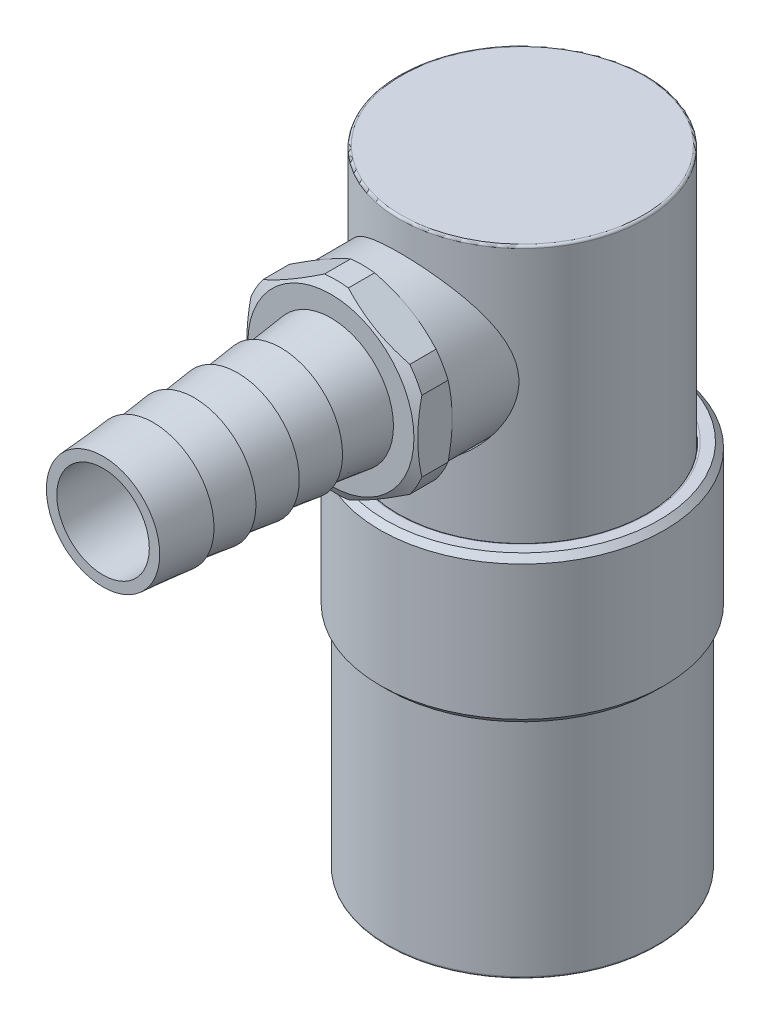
ISO-10303-21;
HEADER;
FILE_DESCRIPTION(('STEP AP214'),'2;1');
FILE_NAME('part.step','',(''),(''),'','','');
FILE_SCHEMA(('AUTOMOTIVE_DESIGN { 1 0 10303 214 1 1 1 1 }'));
ENDSEC;
DATA;
#1=APPLICATION_CONTEXT('core data for automotive mechanical design processes');
#2=APPLICATION_PROTOCOL_DEFINITION('international standard','automotive_design',2000,#1);
#3=PRODUCT_CONTEXT('',#1,'mechanical');
#4=PRODUCT('Part','Part','',(#3));
#5=PRODUCT_RELATED_PRODUCT_CATEGORY('part','',(#4));
#6=PRODUCT_DEFINITION_FORMATION('','',#4);
#7=PRODUCT_DEFINITION_CONTEXT('part definition',#1,'design');
#8=PRODUCT_DEFINITION('design','',#6,#7);
#9=PRODUCT_DEFINITION_SHAPE('','',#8);
#10=(LENGTH_UNIT() NAMED_UNIT(*) SI_UNIT(.MILLI.,.METRE.));
#11=(NAMED_UNIT(*) PLANE_ANGLE_UNIT() SI_UNIT($,.RADIAN.));
#12=(NAMED_UNIT(*) SI_UNIT($,.STERADIAN.) SOLID_ANGLE_UNIT());
#13=UNCERTAINTY_MEASURE_WITH_UNIT(LENGTH_MEASURE(1.E-05),#10,'distance_accuracy_value','');
#14=(GEOMETRIC_REPRESENTATION_CONTEXT(3) GLOBAL_UNCERTAINTY_ASSIGNED_CONTEXT((#13)) GLOBAL_UNIT_ASSIGNED_CONTEXT((#10,
#11,#12)) REPRESENTATION_CONTEXT('',''));
#15=CARTESIAN_POINT('',(0.,0.,0.));
#16=DIRECTION('',(0.,0.,1.));
#17=DIRECTION('',(1.,0.,0.));
#18=AXIS2_PLACEMENT_3D('',#15,#16,#17);
#19=CARTESIAN_POINT('',(0.,56.896,9.144));
#20=DIRECTION('',(0.,0.,1.));
#21=DIRECTION('',(0.,1.,0.));
#22=AXIS2_PLACEMENT_3D('',#19,#20,#21);
#23=CONICAL_SURFACE('',#22,9.017,0.785398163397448);
#24=CARTESIAN_POINT('',(0.,56.896,8.636));
#25=DIRECTION('',(0.,0.,1.));
#26=DIRECTION('',(0.,1.,0.));
#27=AXIS2_PLACEMENT_3D('',#24,#25,#26);
#28=CIRCLE('',#27,8.509);
#29=CARTESIAN_POINT('',(0.,48.387,8.636));
#30=VERTEX_POINT('',#29);
#31=EDGE_CURVE('P0_E11',#30,#30,#28,.T.);
#32=ORIENTED_EDGE('',*,*,#31,.T.);
#33=DIRECTION('',(0.,-0.707106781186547,0.707106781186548));
#34=VECTOR('',#33,1.);
#35=CARTESIAN_POINT('',(0.,47.879,9.144));
#36=LINE('',#35,#34);
#37=CARTESIAN_POINT('',(0.,47.41164,9.61136));
#38=VERTEX_POINT('',#37);
#39=EDGE_CURVE('P0_E27',#30,#38,#36,.T.);
#40=ORIENTED_EDGE('',*,*,#39,.T.);
#41=CARTESIAN_POINT('',(0.,56.896,9.61136));
#42=DIRECTION('',(0.,0.,-1.));
#43=DIRECTION('',(0.,1.,0.));
#44=AXIS2_PLACEMENT_3D('',#41,#42,#43);
#45=CIRCLE('',#44,9.48436);
#46=EDGE_CURVE('P0_E307',#38,#38,#45,.T.);
#47=ORIENTED_EDGE('',*,*,#46,.T.);
#48=ORIENTED_EDGE('',*,*,#39,.F.);
#49=EDGE_LOOP('',(#32,#40,#47,#48));
#50=FACE_BOUND('',#49,.T.);
#51=ADVANCED_FACE('P0_F16',(#50),#23,.T.);
#52=CARTESIAN_POINT('',(0.,56.896,12.9921));
#53=DIRECTION('',(0.,0.,-1.));
#54=DIRECTION('',(0.,1.,0.));
#55=AXIS2_PLACEMENT_3D('',#52,#53,#54);
#56=CYLINDRICAL_SURFACE('',#55,9.48436);
#57=ORIENTED_EDGE('',*,*,#46,.F.);
#58=DIRECTION('',(0.,0.,1.));
#59=VECTOR('',#58,1.);
#60=CARTESIAN_POINT('',(0.,47.41164,12.9921));
#61=LINE('',#60,#59);
#62=CARTESIAN_POINT('',(0.,47.41164,17.3247364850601));
#63=VERTEX_POINT('',#62);
#64=EDGE_CURVE('P0_E366',#38,#63,#61,.T.);
#65=ORIENTED_EDGE('',*,*,#64,.T.);
#66=CARTESIAN_POINT('',(0.,56.896,17.3247364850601));
#67=DIRECTION('',(0.,0.,-1.));
#68=DIRECTION('',(0.,1.,0.));
#69=AXIS2_PLACEMENT_3D('',#66,#67,#68);
#70=CIRCLE('',#69,9.48436);
#71=CARTESIAN_POINT('',(-8.21369669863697,52.15382,17.3247364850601));
#72=VERTEX_POINT('',#71);
#73=EDGE_CURVE('P0_E363',#63,#72,#70,.T.);
#74=ORIENTED_EDGE('',*,*,#73,.T.);
#75=CARTESIAN_POINT('',(0.,56.896,17.3247364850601));
#76=DIRECTION('',(0.,0.,-1.));
#77=DIRECTION('',(0.,1.,0.));
#78=AXIS2_PLACEMENT_3D('',#75,#76,#77);
#79=CIRCLE('',#78,9.48436);
#80=EDGE_CURVE('P0_E317',#72,#63,#79,.T.);
#81=ORIENTED_EDGE('',*,*,#80,.T.);
#82=ORIENTED_EDGE('',*,*,#64,.F.);
#83=EDGE_LOOP('',(#57,#65,#74,#81,#82));
#84=FACE_BOUND('',#83,.T.);
#85=ADVANCED_FACE('P0_F625',(#84),#56,.T.);
#86=CARTESIAN_POINT('',(0.,62.0522,8.636));
#87=DIRECTION('',(0.,0.,-1.));
#88=DIRECTION('',(0.,1.,0.));
#89=AXIS2_PLACEMENT_3D('',#86,#87,#88);
#90=PLANE('',#89);
#91=ORIENTED_EDGE('',*,*,#31,.F.);
#92=EDGE_LOOP('',(#91));
#93=FACE_BOUND('',#92,.T.);
#94=CARTESIAN_POINT('',(0.,56.896,8.636));
#95=DIRECTION('',(0.,0.,-1.));
#96=DIRECTION('',(1.,0.,0.));
#97=AXIS2_PLACEMENT_3D('',#94,#95,#96);
#98=CIRCLE('',#97,5.1562);
#99=CARTESIAN_POINT('',(0.,62.0522,8.636));
#100=VERTEX_POINT('',#99);
#101=CARTESIAN_POINT('',(0.,51.7398,8.636));
#102=VERTEX_POINT('',#101);
#103=EDGE_CURVE('P0_E278',#100,#102,#98,.T.);
#104=ORIENTED_EDGE('',*,*,#103,.F.);
#105=CARTESIAN_POINT('',(0.,56.896,8.636));
#106=DIRECTION('',(0.,0.,-1.));
#107=DIRECTION('',(1.,0.,0.));
#108=AXIS2_PLACEMENT_3D('',#105,#106,#107);
#109=CIRCLE('',#108,5.1562);
#110=EDGE_CURVE('P0_E325',#102,#100,#109,.T.);
#111=ORIENTED_EDGE('',*,*,#110,.F.);
#112=EDGE_LOOP('',(#104,#111));
#113=FACE_BOUND('',#112,.T.);
#114=ADVANCED_FACE('P0_F631',(#93,#113),#90,.T.);
#115=CARTESIAN_POINT('',(0.,45.8974773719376,8.636));
#116=DIRECTION('',(0.5,0.866025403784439,0.));
#117=DIRECTION('',(0.,0.,-1.));
#118=AXIS2_PLACEMENT_3D('',#115,#116,#117);
#119=PLANE('',#118);
#120=CARTESIAN_POINT('',(-1.33978520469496,46.6710027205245,17.8028056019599));
#121=CARTESIAN_POINT('',(-3.11907100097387,47.6982738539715,17.3482));
#122=CARTESIAN_POINT('',(-4.7625,48.6471080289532,17.3482));
#123=CARTESIAN_POINT('',(-6.40592899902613,49.595942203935,17.3482));
#124=CARTESIAN_POINT('',(-8.18521479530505,50.6232133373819,17.8028056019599));
#125=(BOUNDED_CURVE() B_SPLINE_CURVE(2,(#120,#121,#122,#123,#124),.UNSPECIFIED.,.F.,
.F.) B_SPLINE_CURVE_WITH_KNOTS((3,2,3),(0.,0.398430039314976,0.796860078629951),
.UNSPECIFIED.) CURVE() GEOMETRIC_REPRESENTATION_ITEM() RATIONAL_B_SPLINE_CURVE((1.,
1.02045741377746,1.,1.02045741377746,1.)) REPRESENTATION_ITEM(''));
#126=CARTESIAN_POINT('',(-1.33978520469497,46.6710027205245,17.8028056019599));
#127=VERTEX_POINT('',#126);
#128=CARTESIAN_POINT('',(-8.18521479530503,50.6232133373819,17.8028056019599));
#129=VERTEX_POINT('',#128);
#130=EDGE_CURVE('P0_E542',#127,#129,#125,.T.);
#131=ORIENTED_EDGE('',*,*,#130,.F.);
#132=DIRECTION('',(0.,0.,-1.));
#133=VECTOR('',#132,1.);
#134=CARTESIAN_POINT('',(-1.33978520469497,46.6710027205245,19.2642891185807));
#135=LINE('',#134,#133);
#136=CARTESIAN_POINT('',(-1.33978520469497,46.6710027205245,20.7257726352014));
#137=VERTEX_POINT('',#136);
#138=EDGE_CURVE('P0_E370',#137,#127,#135,.T.);
#139=ORIENTED_EDGE('',*,*,#138,.F.);
#140=CARTESIAN_POINT('',(-8.18521479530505,50.6232133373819,20.7257726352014));
#141=CARTESIAN_POINT('',(-4.76249999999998,48.6471080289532,21.600272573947));
#142=CARTESIAN_POINT('',(-1.33978520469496,46.6710027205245,20.7257726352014));
#143=(BOUNDED_CURVE() B_SPLINE_CURVE(2,(#140,#141,#142),.UNSPECIFIED.,.F.,
.F.) B_SPLINE_CURVE_WITH_KNOTS((3,3),(0.,0.795654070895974),
.UNSPECIFIED.) CURVE() GEOMETRIC_REPRESENTATION_ITEM() RATIONAL_B_SPLINE_CURVE((1.,
1.08266666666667,1.)) REPRESENTATION_ITEM(''));
#144=CARTESIAN_POINT('',(-8.18521479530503,50.6232133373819,20.7257726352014));
#145=VERTEX_POINT('',#144);
#146=EDGE_CURVE('P0_E402',#145,#137,#143,.T.);
#147=ORIENTED_EDGE('',*,*,#146,.F.);
#148=DIRECTION('',(0.,0.,1.));
#149=VECTOR('',#148,1.);
#150=CARTESIAN_POINT('',(-8.18521479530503,50.6232133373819,19.2642891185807));
#151=LINE('',#150,#149);
#152=EDGE_CURVE('P0_E383',#129,#145,#151,.T.);
#153=ORIENTED_EDGE('',*,*,#152,.F.);
#154=EDGE_LOOP('',(#131,#139,#147,#153));
#155=FACE_BOUND('',#154,.T.);
#156=ADVANCED_FACE('P0_F745',(#155),#119,.F.);
#157=CARTESIAN_POINT('',(9.525,51.3967386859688,8.636));
#158=DIRECTION('',(-0.5,0.866025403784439,0.));
#159=DIRECTION('',(-0.866025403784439,-0.5,0.));
#160=AXIS2_PLACEMENT_3D('',#157,#158,#159);
#161=PLANE('',#160);
#162=CARTESIAN_POINT('',(8.18521479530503,50.6232133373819,17.8028056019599));
#163=CARTESIAN_POINT('',(6.4059289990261,49.595942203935,17.3482));
#164=CARTESIAN_POINT('',(4.7625,48.6471080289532,17.3482));
#165=CARTESIAN_POINT('',(3.11907100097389,47.6982738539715,17.3482));
#166=CARTESIAN_POINT('',(1.33978520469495,46.6710027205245,17.8028056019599));
#167=(BOUNDED_CURVE() B_SPLINE_CURVE(2,(#162,#163,#164,#165,#166),.UNSPECIFIED.,.F.,
.F.) B_SPLINE_CURVE_WITH_KNOTS((3,2,3),(0.,0.398430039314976,0.79686007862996),
.UNSPECIFIED.) CURVE() GEOMETRIC_REPRESENTATION_ITEM() RATIONAL_B_SPLINE_CURVE((1.,
1.02045741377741,1.,1.02045741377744,1.)) REPRESENTATION_ITEM(''));
#168=CARTESIAN_POINT('',(8.18521479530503,50.6232133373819,17.8028056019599));
#169=VERTEX_POINT('',#168);
#170=CARTESIAN_POINT('',(1.33978520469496,46.6710027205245,17.8028056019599));
#171=VERTEX_POINT('',#170);
#172=EDGE_CURVE('P0_E382',#169,#171,#167,.T.);
#173=ORIENTED_EDGE('',*,*,#172,.F.);
#174=DIRECTION('',(0.,0.,-1.));
#175=VECTOR('',#174,1.);
#176=CARTESIAN_POINT('',(8.18521479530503,50.6232133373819,19.2642891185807));
#177=LINE('',#176,#175);
#178=CARTESIAN_POINT('',(8.18521479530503,50.6232133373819,20.7257726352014));
#179=VERTEX_POINT('',#178);
#180=EDGE_CURVE('P0_E267',#179,#169,#177,.T.);
#181=ORIENTED_EDGE('',*,*,#180,.F.);
#182=CARTESIAN_POINT('',(1.33978520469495,46.6710027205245,20.7257726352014));
#183=CARTESIAN_POINT('',(4.76250000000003,48.6471080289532,21.600272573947));
#184=CARTESIAN_POINT('',(8.18521479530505,50.6232133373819,20.7257726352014));
#185=(BOUNDED_CURVE() B_SPLINE_CURVE(2,(#182,#183,#184),.UNSPECIFIED.,.F.,
.F.) B_SPLINE_CURVE_WITH_KNOTS((3,3),(0.,0.795654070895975),
.UNSPECIFIED.) CURVE() GEOMETRIC_REPRESENTATION_ITEM() RATIONAL_B_SPLINE_CURVE((1.,
1.08266666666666,1.)) REPRESENTATION_ITEM(''));
#186=CARTESIAN_POINT('',(1.33978520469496,46.6710027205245,20.7257726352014));
#187=VERTEX_POINT('',#186);
#188=EDGE_CURVE('P0_E389',#187,#179,#185,.T.);
#189=ORIENTED_EDGE('',*,*,#188,.F.);
#190=DIRECTION('',(0.,0.,1.));
#191=VECTOR('',#190,1.);
#192=CARTESIAN_POINT('',(1.33978520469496,46.6710027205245,19.2642891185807));
#193=LINE('',#192,#191);
#194=EDGE_CURVE('P0_E367',#171,#187,#193,.T.);
#195=ORIENTED_EDGE('',*,*,#194,.F.);
#196=EDGE_LOOP('',(#173,#181,#189,#195));
#197=FACE_BOUND('',#196,.T.);
#198=ADVANCED_FACE('P0_F747',(#197),#161,.F.);
#199=CARTESIAN_POINT('',(9.525,62.3952613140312,8.636));
#200=DIRECTION('',(-1.,0.,0.));
#201=DIRECTION('',(0.,-1.,0.));
#202=AXIS2_PLACEMENT_3D('',#199,#200,#201);
#203=PLANE('',#202);
#204=CARTESIAN_POINT('',(9.525,60.8482106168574,17.8028056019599));
#205=CARTESIAN_POINT('',(9.525,58.7936683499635,17.3482));
#206=CARTESIAN_POINT('',(9.525,56.896,17.3482));
#207=CARTESIAN_POINT('',(9.525,54.9983316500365,17.3482));
#208=CARTESIAN_POINT('',(9.525,52.9437893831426,17.8028056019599));
#209=(BOUNDED_CURVE() B_SPLINE_CURVE(2,(#204,#205,#206,#207,#208),.UNSPECIFIED.,.F.,
.F.) B_SPLINE_CURVE_WITH_KNOTS((3,2,3),(0.,0.398430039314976,0.796860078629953),
.UNSPECIFIED.) CURVE() GEOMETRIC_REPRESENTATION_ITEM() RATIONAL_B_SPLINE_CURVE((1.,
1.02045741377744,1.,1.02045741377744,1.)) REPRESENTATION_ITEM(''));
#210=CARTESIAN_POINT('',(9.525,60.8482106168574,17.8028056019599));
#211=VERTEX_POINT('',#210);
#212=CARTESIAN_POINT('',(9.525,52.9437893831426,17.8028056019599));
#213=VERTEX_POINT('',#212);
#214=EDGE_CURVE('P0_E289',#211,#213,#209,.T.);
#215=ORIENTED_EDGE('',*,*,#214,.F.);
#216=DIRECTION('',(0.,0.,-1.));
#217=VECTOR('',#216,1.);
#218=CARTESIAN_POINT('',(9.525,60.8482106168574,19.2642891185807));
#219=LINE('',#218,#217);
#220=CARTESIAN_POINT('',(9.525,60.8482106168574,20.7257726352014));
#221=VERTEX_POINT('',#220);
#222=EDGE_CURVE('P0_E274',#221,#211,#219,.T.);
#223=ORIENTED_EDGE('',*,*,#222,.F.);
#224=CARTESIAN_POINT('',(9.525,52.9437893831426,20.7257726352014));
#225=CARTESIAN_POINT('',(9.52499999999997,56.896,21.600272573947));
#226=CARTESIAN_POINT('',(9.525,60.8482106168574,20.7257726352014));
#227=(BOUNDED_CURVE() B_SPLINE_CURVE(2,(#224,#225,#226),.UNSPECIFIED.,.F.,
.F.) B_SPLINE_CURVE_WITH_KNOTS((3,3),(0.,0.795654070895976),
.UNSPECIFIED.) CURVE() GEOMETRIC_REPRESENTATION_ITEM() RATIONAL_B_SPLINE_CURVE((1.,
1.08266666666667,1.)) REPRESENTATION_ITEM(''));
#228=CARTESIAN_POINT('',(9.525,52.9437893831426,20.7257726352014));
#229=VERTEX_POINT('',#228);
#230=EDGE_CURVE('P0_E395',#229,#221,#227,.T.);
#231=ORIENTED_EDGE('',*,*,#230,.F.);
#232=DIRECTION('',(0.,0.,1.));
#233=VECTOR('',#232,1.);
#234=CARTESIAN_POINT('',(9.525,52.9437893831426,19.2642891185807));
#235=LINE('',#234,#233);
#236=EDGE_CURVE('P0_E415',#213,#229,#235,.T.);
#237=ORIENTED_EDGE('',*,*,#236,.F.);
#238=EDGE_LOOP('',(#215,#223,#231,#237));
#239=FACE_BOUND('',#238,.T.);
#240=ADVANCED_FACE('P0_F655',(#239),#203,.F.);
#241=CARTESIAN_POINT('',(0.,67.8945226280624,8.636));
#242=DIRECTION('',(-0.5,-0.866025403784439,0.));
#243=DIRECTION('',(0.,0.,1.));
#244=AXIS2_PLACEMENT_3D('',#241,#242,#243);
#245=PLANE('',#244);
#246=CARTESIAN_POINT('',(1.33978520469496,67.1209972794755,17.8028056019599));
#247=CARTESIAN_POINT('',(3.1190710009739,66.0937261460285,17.3482));
#248=CARTESIAN_POINT('',(4.7625,65.1448919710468,17.3482));
#249=CARTESIAN_POINT('',(6.40592899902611,64.196057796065,17.3482));
#250=CARTESIAN_POINT('',(8.18521479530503,63.1687866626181,17.8028056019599));
#251=(BOUNDED_CURVE() B_SPLINE_CURVE(2,(#246,#247,#248,#249,#250),.UNSPECIFIED.,.F.,
.F.) B_SPLINE_CURVE_WITH_KNOTS((3,2,3),(0.,0.398430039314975,0.796860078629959),
.UNSPECIFIED.) CURVE() GEOMETRIC_REPRESENTATION_ITEM() RATIONAL_B_SPLINE_CURVE((1.,
1.02045741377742,1.,1.02045741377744,1.)) REPRESENTATION_ITEM(''));
#252=CARTESIAN_POINT('',(1.33978520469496,67.1209972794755,17.8028056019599));
#253=VERTEX_POINT('',#252);
#254=CARTESIAN_POINT('',(8.18521479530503,63.1687866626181,17.8028056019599));
#255=VERTEX_POINT('',#254);
#256=EDGE_CURVE('P0_E288',#253,#255,#251,.T.);
#257=ORIENTED_EDGE('',*,*,#256,.F.);
#258=DIRECTION('',(0.,0.,-1.));
#259=VECTOR('',#258,1.);
#260=CARTESIAN_POINT('',(1.33978520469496,67.1209972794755,19.2642891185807));
#261=LINE('',#260,#259);
#262=CARTESIAN_POINT('',(1.33978520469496,67.1209972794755,20.7257726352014));
#263=VERTEX_POINT('',#262);
#264=EDGE_CURVE('P0_E377',#263,#253,#261,.T.);
#265=ORIENTED_EDGE('',*,*,#264,.F.);
#266=CARTESIAN_POINT('',(8.18521479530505,63.1687866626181,20.7257726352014));
#267=CARTESIAN_POINT('',(4.76249999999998,65.1448919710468,21.600272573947));
#268=CARTESIAN_POINT('',(1.33978520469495,67.1209972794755,20.7257726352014));
#269=(BOUNDED_CURVE() B_SPLINE_CURVE(2,(#266,#267,#268),.UNSPECIFIED.,.F.,
.F.) B_SPLINE_CURVE_WITH_KNOTS((3,3),(0.,0.795654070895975),
.UNSPECIFIED.) CURVE() GEOMETRIC_REPRESENTATION_ITEM() RATIONAL_B_SPLINE_CURVE((1.,
1.08266666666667,1.)) REPRESENTATION_ITEM(''));
#270=CARTESIAN_POINT('',(8.18521479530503,63.1687866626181,20.7257726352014));
#271=VERTEX_POINT('',#270);
#272=EDGE_CURVE('P0_E323',#271,#263,#269,.T.);
#273=ORIENTED_EDGE('',*,*,#272,.F.);
#274=DIRECTION('',(0.,0.,1.));
#275=VECTOR('',#274,1.);
#276=CARTESIAN_POINT('',(8.18521479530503,63.1687866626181,19.2642891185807));
#277=LINE('',#276,#275);
#278=EDGE_CURVE('P0_E266',#255,#271,#277,.T.);
#279=ORIENTED_EDGE('',*,*,#278,.F.);
#280=EDGE_LOOP('',(#257,#265,#273,#279));
#281=FACE_BOUND('',#280,.T.);
#282=ADVANCED_FACE('P0_F651',(#281),#245,.F.);
#283=CARTESIAN_POINT('',(-9.525,62.3952613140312,8.636));
#284=DIRECTION('',(0.5,-0.866025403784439,0.));
#285=DIRECTION('',(0.,0.,-1.));
#286=AXIS2_PLACEMENT_3D('',#283,#284,#285);
#287=PLANE('',#286);
#288=CARTESIAN_POINT('',(-8.18521479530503,63.1687866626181,17.8028056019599));
#289=CARTESIAN_POINT('',(-6.40592899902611,64.196057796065,17.3482));
#290=CARTESIAN_POINT('',(-4.7625,65.1448919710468,17.3482));
#291=CARTESIAN_POINT('',(-3.1190710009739,66.0937261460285,17.3482));
#292=CARTESIAN_POINT('',(-1.33978520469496,67.1209972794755,17.8028056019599));
#293=(BOUNDED_CURVE() B_SPLINE_CURVE(2,(#288,#289,#290,#291,#292),.UNSPECIFIED.,.F.,
.F.) B_SPLINE_CURVE_WITH_KNOTS((3,2,3),(0.,0.398430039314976,0.796860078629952),
.UNSPECIFIED.) CURVE() GEOMETRIC_REPRESENTATION_ITEM() RATIONAL_B_SPLINE_CURVE((1.,
1.02045741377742,1.,1.02045741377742,1.)) REPRESENTATION_ITEM(''));
#294=CARTESIAN_POINT('',(-8.18521479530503,63.1687866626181,17.8028056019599));
#295=VERTEX_POINT('',#294);
#296=CARTESIAN_POINT('',(-1.33978520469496,67.1209972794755,17.8028056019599));
#297=VERTEX_POINT('',#296);
#298=EDGE_CURVE('P0_E488',#295,#297,#293,.T.);
#299=ORIENTED_EDGE('',*,*,#298,.F.);
#300=DIRECTION('',(0.,0.,-1.));
#301=VECTOR('',#300,1.);
#302=CARTESIAN_POINT('',(-8.18521479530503,63.1687866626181,19.2642891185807));
#303=LINE('',#302,#301);
#304=CARTESIAN_POINT('',(-8.18521479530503,63.1687866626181,20.7257726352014));
#305=VERTEX_POINT('',#304);
#306=EDGE_CURVE('P0_E481',#305,#295,#303,.T.);
#307=ORIENTED_EDGE('',*,*,#306,.F.);
#308=CARTESIAN_POINT('',(-1.33978520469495,67.1209972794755,20.7257726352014));
#309=CARTESIAN_POINT('',(-4.7625,65.1448919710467,21.600272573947));
#310=CARTESIAN_POINT('',(-8.18521479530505,63.1687866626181,20.7257726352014));
#311=(BOUNDED_CURVE() B_SPLINE_CURVE(2,(#308,#309,#310),.UNSPECIFIED.,.F.,
.F.) B_SPLINE_CURVE_WITH_KNOTS((3,3),(0.,0.795654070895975),
.UNSPECIFIED.) CURVE() GEOMETRIC_REPRESENTATION_ITEM() RATIONAL_B_SPLINE_CURVE((1.,
1.08266666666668,1.)) REPRESENTATION_ITEM(''));
#312=CARTESIAN_POINT('',(-1.33978520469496,67.1209972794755,20.7257726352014));
#313=VERTEX_POINT('',#312);
#314=EDGE_CURVE('P0_E318',#313,#305,#311,.T.);
#315=ORIENTED_EDGE('',*,*,#314,.F.);
#316=DIRECTION('',(0.,0.,1.));
#317=VECTOR('',#316,1.);
#318=CARTESIAN_POINT('',(-1.33978520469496,67.1209972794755,19.2642891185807));
#319=LINE('',#318,#317);
#320=EDGE_CURVE('P0_E362',#297,#313,#319,.T.);
#321=ORIENTED_EDGE('',*,*,#320,.F.);
#322=EDGE_LOOP('',(#299,#307,#315,#321));
#323=FACE_BOUND('',#322,.T.);
#324=ADVANCED_FACE('P0_F654',(#323),#287,.F.);
#325=CARTESIAN_POINT('',(-9.525,51.3967386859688,8.636));
#326=DIRECTION('',(1.,0.,0.));
#327=DIRECTION('',(0.,-1.,0.));
#328=AXIS2_PLACEMENT_3D('',#325,#326,#327);
#329=PLANE('',#328);
#330=CARTESIAN_POINT('',(-9.525,52.9437893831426,17.8028056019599));
#331=CARTESIAN_POINT('',(-9.525,54.9983316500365,17.3482));
#332=CARTESIAN_POINT('',(-9.525,56.896,17.3482));
#333=CARTESIAN_POINT('',(-9.525,58.7936683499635,17.3482));
#334=CARTESIAN_POINT('',(-9.525,60.8482106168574,17.8028056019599));
#335=(BOUNDED_CURVE() B_SPLINE_CURVE(2,(#330,#331,#332,#333,#334),.UNSPECIFIED.,.F.,
.F.) B_SPLINE_CURVE_WITH_KNOTS((3,2,3),(0.,0.398430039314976,0.796860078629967),
.UNSPECIFIED.) CURVE() GEOMETRIC_REPRESENTATION_ITEM() RATIONAL_B_SPLINE_CURVE((1.,
1.02045741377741,1.,1.02045741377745,1.)) REPRESENTATION_ITEM(''));
#336=CARTESIAN_POINT('',(-9.525,52.9437893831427,17.8028056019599));
#337=VERTEX_POINT('',#336);
#338=CARTESIAN_POINT('',(-9.525,60.8482106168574,17.8028056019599));
#339=VERTEX_POINT('',#338);
#340=EDGE_CURVE('P0_E506',#337,#339,#335,.T.);
#341=ORIENTED_EDGE('',*,*,#340,.F.);
#342=DIRECTION('',(0.,0.,-1.));
#343=VECTOR('',#342,1.);
#344=CARTESIAN_POINT('',(-9.525,52.9437893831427,19.2642891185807));
#345=LINE('',#344,#343);
#346=CARTESIAN_POINT('',(-9.525,52.9437893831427,20.7257726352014));
#347=VERTEX_POINT('',#346);
#348=EDGE_CURVE('P0_E485',#347,#337,#345,.T.);
#349=ORIENTED_EDGE('',*,*,#348,.F.);
#350=CARTESIAN_POINT('',(-9.525,60.8482106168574,20.7257726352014));
#351=CARTESIAN_POINT('',(-9.52499999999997,56.896,21.600272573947));
#352=CARTESIAN_POINT('',(-9.525,52.9437893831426,20.7257726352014));
#353=(BOUNDED_CURVE() B_SPLINE_CURVE(2,(#350,#351,#352),.UNSPECIFIED.,.F.,
.F.) B_SPLINE_CURVE_WITH_KNOTS((3,3),(0.,0.795654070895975),
.UNSPECIFIED.) CURVE() GEOMETRIC_REPRESENTATION_ITEM() RATIONAL_B_SPLINE_CURVE((1.,
1.08266666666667,1.)) REPRESENTATION_ITEM(''));
#354=CARTESIAN_POINT('',(-9.525,60.8482106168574,20.7257726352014));
#355=VERTEX_POINT('',#354);
#356=EDGE_CURVE('P0_E324',#355,#347,#353,.T.);
#357=ORIENTED_EDGE('',*,*,#356,.F.);
#358=DIRECTION('',(0.,0.,1.));
#359=VECTOR('',#358,1.);
#360=CARTESIAN_POINT('',(-9.525,60.8482106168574,19.2642891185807));
#361=LINE('',#360,#359);
#362=EDGE_CURVE('P0_E376',#339,#355,#361,.T.);
#363=ORIENTED_EDGE('',*,*,#362,.F.);
#364=EDGE_LOOP('',(#341,#349,#357,#363));
#365=FACE_BOUND('',#364,.T.);
#366=ADVANCED_FACE('P0_F636',(#365),#329,.F.);
#367=CARTESIAN_POINT('',(0.,56.896,17.5755028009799));
#368=DIRECTION('',(0.,0.,1.));
#369=DIRECTION('',(0.,1.,0.));
#370=AXIS2_PLACEMENT_3D('',#367,#368,#369);
#371=CONICAL_SURFACE('',#370,9.9187,1.0471975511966);
#372=ORIENTED_EDGE('',*,*,#80,.F.);
#373=ORIENTED_EDGE('',*,*,#73,.F.);
#374=DIRECTION('',(0.,-0.866025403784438,0.5));
#375=VECTOR('',#374,1.);
#376=CARTESIAN_POINT('',(0.,46.9773,17.5755028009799));
#377=LINE('',#376,#375);
#378=CARTESIAN_POINT('',(0.,46.5836,17.8028056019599));
#379=VERTEX_POINT('',#378);
#380=EDGE_CURVE('P0_E313',#63,#379,#377,.T.);
#381=ORIENTED_EDGE('',*,*,#380,.T.);
#382=CARTESIAN_POINT('',(0.,56.896,17.8028056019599));
#383=DIRECTION('',(0.,0.,-1.));
#384=DIRECTION('',(1.,0.,0.));
#385=AXIS2_PLACEMENT_3D('',#382,#383,#384);
#386=CIRCLE('',#385,10.3124);
#387=EDGE_CURVE('P0_E20',#379,#127,#386,.T.);
#388=ORIENTED_EDGE('',*,*,#387,.T.);
#389=ORIENTED_EDGE('',*,*,#130,.T.);
#390=CARTESIAN_POINT('',(0.,56.896,17.8028056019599));
#391=DIRECTION('',(0.,0.,-1.));
#392=DIRECTION('',(1.,0.,0.));
#393=AXIS2_PLACEMENT_3D('',#390,#391,#392);
#394=CIRCLE('',#393,10.3124);
#395=EDGE_CURVE('P0_E512',#129,#337,#394,.T.);
#396=ORIENTED_EDGE('',*,*,#395,.T.);
#397=ORIENTED_EDGE('',*,*,#340,.T.);
#398=CARTESIAN_POINT('',(0.,56.896,17.8028056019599));
#399=DIRECTION('',(0.,0.,-1.));
#400=DIRECTION('',(1.,0.,0.));
#401=AXIS2_PLACEMENT_3D('',#398,#399,#400);
#402=CIRCLE('',#401,10.3124);
#403=EDGE_CURVE('P0_E494',#339,#295,#402,.T.);
#404=ORIENTED_EDGE('',*,*,#403,.T.);
#405=ORIENTED_EDGE('',*,*,#298,.T.);
#406=CARTESIAN_POINT('',(0.,56.896,17.8028056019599));
#407=DIRECTION('',(0.,0.,-1.));
#408=DIRECTION('',(1.,0.,0.));
#409=AXIS2_PLACEMENT_3D('',#406,#407,#408);
#410=CIRCLE('',#409,10.3124);
#411=EDGE_CURVE('P0_E495',#297,#253,#410,.T.);
#412=ORIENTED_EDGE('',*,*,#411,.T.);
#413=ORIENTED_EDGE('',*,*,#256,.T.);
#414=CARTESIAN_POINT('',(0.,56.896,17.8028056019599));
#415=DIRECTION('',(0.,0.,-1.));
#416=DIRECTION('',(1.,0.,0.));
#417=AXIS2_PLACEMENT_3D('',#414,#415,#416);
#418=CIRCLE('',#417,10.3124);
#419=EDGE_CURVE('P0_E284',#255,#211,#418,.T.);
#420=ORIENTED_EDGE('',*,*,#419,.T.);
#421=ORIENTED_EDGE('',*,*,#214,.T.);
#422=CARTESIAN_POINT('',(0.,56.896,17.8028056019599));
#423=DIRECTION('',(0.,0.,-1.));
#424=DIRECTION('',(1.,0.,0.));
#425=AXIS2_PLACEMENT_3D('',#422,#423,#424);
#426=CIRCLE('',#425,10.3124);
#427=EDGE_CURVE('P0_E570',#213,#169,#426,.T.);
#428=ORIENTED_EDGE('',*,*,#427,.T.);
#429=ORIENTED_EDGE('',*,*,#172,.T.);
#430=CARTESIAN_POINT('',(0.,56.896,17.8028056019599));
#431=DIRECTION('',(0.,0.,-1.));
#432=DIRECTION('',(1.,0.,0.));
#433=AXIS2_PLACEMENT_3D('',#430,#431,#432);
#434=CIRCLE('',#433,10.3124);
#435=EDGE_CURVE('P0_E378',#171,#379,#434,.T.);
#436=ORIENTED_EDGE('',*,*,#435,.T.);
#437=ORIENTED_EDGE('',*,*,#380,.F.);
#438=EDGE_LOOP('',(#372,#373,#381,#388,#389,#396,#397,#404,#405,#412,#413,#420,#421,#428,#429,
#436,#437));
#439=FACE_BOUND('',#438,.T.);
#440=ADVANCED_FACE('P0_F684',(#439),#371,.T.);
#441=CARTESIAN_POINT('',(0.,56.896,19.2642891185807));
#442=DIRECTION('',(0.,0.,-1.));
#443=DIRECTION('',(0.,1.,0.));
#444=AXIS2_PLACEMENT_3D('',#441,#442,#443);
#445=CYLINDRICAL_SURFACE('',#444,10.3124);
#446=ORIENTED_EDGE('',*,*,#152,.T.);
#447=CARTESIAN_POINT('',(0.,56.896,20.7257726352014));
#448=DIRECTION('',(0.,0.,-1.));
#449=DIRECTION('',(1.,0.,0.));
#450=AXIS2_PLACEMENT_3D('',#447,#448,#449);
#451=CIRCLE('',#450,10.3124);
#452=EDGE_CURVE('P0_E260',#145,#347,#451,.T.);
#453=ORIENTED_EDGE('',*,*,#452,.T.);
#454=ORIENTED_EDGE('',*,*,#348,.T.);
#455=ORIENTED_EDGE('',*,*,#395,.F.);
#456=EDGE_LOOP('',(#446,#453,#454,#455));
#457=FACE_BOUND('',#456,.T.);
#458=ADVANCED_FACE('P0_F691',(#457),#445,.T.);
#459=CARTESIAN_POINT('',(0.,56.896,19.2642891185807));
#460=DIRECTION('',(0.,0.,-1.));
#461=DIRECTION('',(0.,1.,0.));
#462=AXIS2_PLACEMENT_3D('',#459,#460,#461);
#463=CYLINDRICAL_SURFACE('',#462,10.3124);
#464=ORIENTED_EDGE('',*,*,#306,.T.);
#465=ORIENTED_EDGE('',*,*,#403,.F.);
#466=ORIENTED_EDGE('',*,*,#362,.T.);
#467=CARTESIAN_POINT('',(0.,56.896,20.7257726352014));
#468=DIRECTION('',(0.,0.,-1.));
#469=DIRECTION('',(1.,0.,0.));
#470=AXIS2_PLACEMENT_3D('',#467,#468,#469);
#471=CIRCLE('',#470,10.3124);
#472=EDGE_CURVE('P0_E372',#355,#305,#471,.T.);
#473=ORIENTED_EDGE('',*,*,#472,.T.);
#474=EDGE_LOOP('',(#464,#465,#466,#473));
#475=FACE_BOUND('',#474,.T.);
#476=ADVANCED_FACE('P0_F18',(#475),#463,.T.);
#477=CARTESIAN_POINT('',(0.,56.896,19.2642891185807));
#478=DIRECTION('',(0.,0.,-1.));
#479=DIRECTION('',(0.,1.,0.));
#480=AXIS2_PLACEMENT_3D('',#477,#478,#479);
#481=CYLINDRICAL_SURFACE('',#480,10.3124);
#482=ORIENTED_EDGE('',*,*,#264,.T.);
#483=ORIENTED_EDGE('',*,*,#411,.F.);
#484=ORIENTED_EDGE('',*,*,#320,.T.);
#485=CARTESIAN_POINT('',(0.,56.896,20.7257726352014));
#486=DIRECTION('',(0.,0.,-1.));
#487=DIRECTION('',(1.,0.,0.));
#488=AXIS2_PLACEMENT_3D('',#485,#486,#487);
#489=CIRCLE('',#488,10.3124);
#490=EDGE_CURVE('P0_E277',#313,#263,#489,.T.);
#491=ORIENTED_EDGE('',*,*,#490,.T.);
#492=EDGE_LOOP('',(#482,#483,#484,#491));
#493=FACE_BOUND('',#492,.T.);
#494=ADVANCED_FACE('P0_F733',(#493),#481,.T.);
#495=CARTESIAN_POINT('',(0.,56.896,19.2642891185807));
#496=DIRECTION('',(0.,0.,-1.));
#497=DIRECTION('',(0.,1.,0.));
#498=AXIS2_PLACEMENT_3D('',#495,#496,#497);
#499=CYLINDRICAL_SURFACE('',#498,10.3124);
#500=ORIENTED_EDGE('',*,*,#222,.T.);
#501=ORIENTED_EDGE('',*,*,#419,.F.);
#502=ORIENTED_EDGE('',*,*,#278,.T.);
#503=CARTESIAN_POINT('',(0.,56.896,20.7257726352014));
#504=DIRECTION('',(0.,0.,-1.));
#505=DIRECTION('',(1.,0.,0.));
#506=AXIS2_PLACEMENT_3D('',#503,#504,#505);
#507=CIRCLE('',#506,10.3124);
#508=EDGE_CURVE('P0_E262',#271,#221,#507,.T.);
#509=ORIENTED_EDGE('',*,*,#508,.T.);
#510=EDGE_LOOP('',(#500,#501,#502,#509));
#511=FACE_BOUND('',#510,.T.);
#512=ADVANCED_FACE('P0_F642',(#511),#499,.T.);
#513=CARTESIAN_POINT('',(0.,56.896,19.2642891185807));
#514=DIRECTION('',(0.,0.,-1.));
#515=DIRECTION('',(0.,1.,0.));
#516=AXIS2_PLACEMENT_3D('',#513,#514,#515);
#517=CYLINDRICAL_SURFACE('',#516,10.3124);
#518=ORIENTED_EDGE('',*,*,#180,.T.);
#519=ORIENTED_EDGE('',*,*,#427,.F.);
#520=ORIENTED_EDGE('',*,*,#236,.T.);
#521=CARTESIAN_POINT('',(0.,56.896,20.7257726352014));
#522=DIRECTION('',(0.,0.,-1.));
#523=DIRECTION('',(1.,0.,0.));
#524=AXIS2_PLACEMENT_3D('',#521,#522,#523);
#525=CIRCLE('',#524,10.3124);
#526=EDGE_CURVE('P0_E293',#229,#179,#525,.T.);
#527=ORIENTED_EDGE('',*,*,#526,.T.);
#528=EDGE_LOOP('',(#518,#519,#520,#527));
#529=FACE_BOUND('',#528,.T.);
#530=ADVANCED_FACE('P0_F638',(#529),#517,.T.);
#531=CARTESIAN_POINT('',(0.,63.2468466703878,41.148));
#532=DIRECTION('',(0.,0.,-1.));
#533=DIRECTION('',(0.,1.,0.));
#534=AXIS2_PLACEMENT_3D('',#531,#532,#533);
#535=PLANE('',#534);
#536=CARTESIAN_POINT('',(0.,56.896,41.148));
#537=DIRECTION('',(0.,0.,-1.));
#538=DIRECTION('',(1.,0.,0.));
#539=AXIS2_PLACEMENT_3D('',#536,#537,#538);
#540=CIRCLE('',#539,6.78264666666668);
#541=CARTESIAN_POINT('',(0.,63.6786466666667,41.148));
#542=VERTEX_POINT('',#541);
#543=CARTESIAN_POINT('',(0.,50.1133533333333,41.148));
#544=VERTEX_POINT('',#543);
#545=EDGE_CURVE('P0_E290',#542,#544,#540,.T.);
#546=ORIENTED_EDGE('',*,*,#545,.T.);
#547=CARTESIAN_POINT('',(0.,56.896,41.148));
#548=DIRECTION('',(0.,0.,-1.));
#549=DIRECTION('',(1.,0.,0.));
#550=AXIS2_PLACEMENT_3D('',#547,#548,#549);
#551=CIRCLE('',#550,6.78264666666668);
#552=EDGE_CURVE('P0_E246',#544,#542,#551,.T.);
#553=ORIENTED_EDGE('',*,*,#552,.T.);
#554=EDGE_LOOP('',(#546,#553));
#555=FACE_BOUND('',#554,.T.);
#556=CARTESIAN_POINT('',(0.,56.896,41.148));
#557=DIRECTION('',(0.,0.,-1.));
#558=DIRECTION('',(1.,0.,0.));
#559=AXIS2_PLACEMENT_3D('',#556,#557,#558);
#560=CIRCLE('',#559,6.35084667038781);
#561=CARTESIAN_POINT('',(0.,63.2468466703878,41.148));
#562=VERTEX_POINT('',#561);
#563=CARTESIAN_POINT('',(0.,50.5451533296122,41.148));
#564=VERTEX_POINT('',#563);
#565=EDGE_CURVE('P0_E272',#562,#564,#560,.T.);
#566=ORIENTED_EDGE('',*,*,#565,.F.);
#567=CARTESIAN_POINT('',(0.,56.896,41.148));
#568=DIRECTION('',(0.,0.,-1.));
#569=DIRECTION('',(1.,0.,0.));
#570=AXIS2_PLACEMENT_3D('',#567,#568,#569);
#571=CIRCLE('',#570,6.35084667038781);
#572=EDGE_CURVE('P0_E303',#564,#562,#571,.T.);
#573=ORIENTED_EDGE('',*,*,#572,.F.);
#574=EDGE_LOOP('',(#566,#573));
#575=FACE_BOUND('',#574,.T.);
#576=ADVANCED_FACE('P0_F641',(#555,#575),#535,.T.);
#577=CARTESIAN_POINT('',(0.,56.896,38.862));
#578=DIRECTION('',(0.,0.,-1.));
#579=DIRECTION('',(0.,1.,0.));
#580=AXIS2_PLACEMENT_3D('',#577,#578,#579);
#581=CONICAL_SURFACE('',#580,6.61754666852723,0.116141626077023);
#582=CARTESIAN_POINT('',(0.,56.896,36.576));
#583=DIRECTION('',(0.,0.,-1.));
#584=DIRECTION('',(1.,0.,0.));
#585=AXIS2_PLACEMENT_3D('',#582,#583,#584);
#586=CIRCLE('',#585,6.88424666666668);
#587=CARTESIAN_POINT('',(0.,63.7802466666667,36.576));
#588=VERTEX_POINT('',#587);
#589=CARTESIAN_POINT('',(0.,50.0117533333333,36.576));
#590=VERTEX_POINT('',#589);
#591=EDGE_CURVE('P0_E268',#588,#590,#586,.T.);
#592=ORIENTED_EDGE('',*,*,#591,.F.);
#593=CARTESIAN_POINT('',(0.,56.896,36.576));
#594=DIRECTION('',(0.,0.,-1.));
#595=DIRECTION('',(1.,0.,0.));
#596=AXIS2_PLACEMENT_3D('',#593,#594,#595);
#597=CIRCLE('',#596,6.88424666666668);
#598=EDGE_CURVE('P0_E273',#590,#588,#597,.T.);
#599=ORIENTED_EDGE('',*,*,#598,.F.);
#600=DIRECTION('',(0.,0.11588069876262,0.993263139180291));
#601=VECTOR('',#600,1.);
#602=CARTESIAN_POINT('',(0.,50.2784533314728,38.862));
#603=LINE('',#602,#601);
#604=EDGE_CURVE('P0_E480',#590,#564,#603,.T.);
#605=ORIENTED_EDGE('',*,*,#604,.T.);
#606=ORIENTED_EDGE('',*,*,#572,.T.);
#607=ORIENTED_EDGE('',*,*,#565,.T.);
#608=ORIENTED_EDGE('',*,*,#604,.F.);
#609=EDGE_LOOP('',(#592,#599,#605,#606,#607,#608));
#610=FACE_BOUND('',#609,.T.);
#611=ADVANCED_FACE('P0_F644',(#610),#581,.T.);
#612=CARTESIAN_POINT('',(0.,63.2163666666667,36.576));
#613=DIRECTION('',(0.,0.,-1.));
#614=DIRECTION('',(0.,1.,0.));
#615=AXIS2_PLACEMENT_3D('',#612,#613,#614);
#616=PLANE('',#615);
#617=ORIENTED_EDGE('',*,*,#591,.T.);
#618=ORIENTED_EDGE('',*,*,#598,.T.);
#619=EDGE_LOOP('',(#617,#618));
#620=FACE_BOUND('',#619,.T.);
#621=CARTESIAN_POINT('',(0.,56.896,36.576));
#622=DIRECTION('',(0.,0.,-1.));
#623=DIRECTION('',(1.,0.,0.));
#624=AXIS2_PLACEMENT_3D('',#621,#622,#623);
#625=CIRCLE('',#624,6.32036666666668);
#626=CARTESIAN_POINT('',(0.,63.2163666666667,36.576));
#627=VERTEX_POINT('',#626);
#628=CARTESIAN_POINT('',(0.,50.5756333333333,36.576));
#629=VERTEX_POINT('',#628);
#630=EDGE_CURVE('P0_E476',#627,#629,#625,.T.);
#631=ORIENTED_EDGE('',*,*,#630,.F.);
#632=CARTESIAN_POINT('',(0.,56.896,36.576));
#633=DIRECTION('',(0.,0.,-1.));
#634=DIRECTION('',(1.,0.,0.));
#635=AXIS2_PLACEMENT_3D('',#632,#633,#634);
#636=CIRCLE('',#635,6.32036666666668);
#637=EDGE_CURVE('P0_E469',#629,#627,#636,.T.);
#638=ORIENTED_EDGE('',*,*,#637,.F.);
#639=EDGE_LOOP('',(#631,#638));
#640=FACE_BOUND('',#639,.T.);
#641=ADVANCED_FACE('P0_F646',(#620,#640),#616,.T.);
#642=CARTESIAN_POINT('',(0.,56.896,34.163));
#643=DIRECTION('',(0.,0.,-1.));
#644=DIRECTION('',(0.,1.,0.));
#645=AXIS2_PLACEMENT_3D('',#642,#643,#644);
#646=CONICAL_SURFACE('',#645,6.60188333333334,0.116141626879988);
#647=CARTESIAN_POINT('',(0.,56.896,31.75));
#648=DIRECTION('',(0.,0.,-1.));
#649=DIRECTION('',(1.,0.,0.));
#650=AXIS2_PLACEMENT_3D('',#647,#648,#649);
#651=CIRCLE('',#650,6.8834);
#652=CARTESIAN_POINT('',(0.,63.7794,31.75));
#653=VERTEX_POINT('',#652);
#654=CARTESIAN_POINT('',(0.,50.0126,31.75));
#655=VERTEX_POINT('',#654);
#656=EDGE_CURVE('P0_E298',#653,#655,#651,.T.);
#657=ORIENTED_EDGE('',*,*,#656,.F.);
#658=CARTESIAN_POINT('',(0.,56.896,31.75));
#659=DIRECTION('',(0.,0.,-1.));
#660=DIRECTION('',(1.,0.,0.));
#661=AXIS2_PLACEMENT_3D('',#658,#659,#660);
#662=CIRCLE('',#661,6.8834);
#663=EDGE_CURVE('P0_E294',#655,#653,#662,.T.);
#664=ORIENTED_EDGE('',*,*,#663,.F.);
#665=DIRECTION('',(0.,0.115880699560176,0.993263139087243));
#666=VECTOR('',#665,1.);
#667=CARTESIAN_POINT('',(0.,50.2941166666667,34.163));
#668=LINE('',#667,#666);
#669=EDGE_CURVE('P0_E351',#655,#629,#668,.T.);
#670=ORIENTED_EDGE('',*,*,#669,.T.);
#671=ORIENTED_EDGE('',*,*,#637,.T.);
#672=ORIENTED_EDGE('',*,*,#630,.T.);
#673=ORIENTED_EDGE('',*,*,#669,.F.);
#674=EDGE_LOOP('',(#657,#664,#670,#671,#672,#673));
#675=FACE_BOUND('',#674,.T.);
#676=ADVANCED_FACE('P0_F658',(#675),#646,.T.);
#677=CARTESIAN_POINT('',(0.,63.21552,31.75));
#678=DIRECTION('',(0.,0.,-1.));
#679=DIRECTION('',(0.,1.,0.));
#680=AXIS2_PLACEMENT_3D('',#677,#678,#679);
#681=PLANE('',#680);
#682=ORIENTED_EDGE('',*,*,#656,.T.);
#683=ORIENTED_EDGE('',*,*,#663,.T.);
#684=EDGE_LOOP('',(#682,#683));
#685=FACE_BOUND('',#684,.T.);
#686=CARTESIAN_POINT('',(0.,56.896,31.75));
#687=DIRECTION('',(0.,0.,-1.));
#688=DIRECTION('',(1.,0.,0.));
#689=AXIS2_PLACEMENT_3D('',#686,#687,#688);
#690=CIRCLE('',#689,6.31952);
#691=CARTESIAN_POINT('',(0.,63.21552,31.75));
#692=VERTEX_POINT('',#691);
#693=CARTESIAN_POINT('',(0.,50.57648,31.75));
#694=VERTEX_POINT('',#693);
#695=EDGE_CURVE('P0_E420',#692,#694,#690,.T.);
#696=ORIENTED_EDGE('',*,*,#695,.F.);
#697=CARTESIAN_POINT('',(0.,56.896,31.75));
#698=DIRECTION('',(0.,0.,-1.));
#699=DIRECTION('',(1.,0.,0.));
#700=AXIS2_PLACEMENT_3D('',#697,#698,#699);
#701=CIRCLE('',#700,6.31952);
#702=EDGE_CURVE('P0_E431',#694,#692,#701,.T.);
#703=ORIENTED_EDGE('',*,*,#702,.F.);
#704=EDGE_LOOP('',(#696,#703));
#705=FACE_BOUND('',#704,.T.);
#706=ADVANCED_FACE('P0_F600',(#685,#705),#681,.T.);
#707=CARTESIAN_POINT('',(0.,56.896,29.337));
#708=DIRECTION('',(0.,0.,-1.));
#709=DIRECTION('',(0.,1.,0.));
#710=AXIS2_PLACEMENT_3D('',#707,#708,#709);
#711=CONICAL_SURFACE('',#710,6.60103666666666,0.116141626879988);
#712=CARTESIAN_POINT('',(0.,56.896,26.924));
#713=DIRECTION('',(0.,0.,-1.));
#714=DIRECTION('',(1.,0.,0.));
#715=AXIS2_PLACEMENT_3D('',#712,#713,#714);
#716=CIRCLE('',#715,6.88255333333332);
#717=CARTESIAN_POINT('',(0.,63.7785533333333,26.924));
#718=VERTEX_POINT('',#717);
#719=CARTESIAN_POINT('',(0.,50.0134466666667,26.924));
#720=VERTEX_POINT('',#719);
#721=EDGE_CURVE('P0_E416',#718,#720,#716,.T.);
#722=ORIENTED_EDGE('',*,*,#721,.F.);
#723=CARTESIAN_POINT('',(0.,56.896,26.924));
#724=DIRECTION('',(0.,0.,-1.));
#725=DIRECTION('',(1.,0.,0.));
#726=AXIS2_PLACEMENT_3D('',#723,#724,#725);
#727=CIRCLE('',#726,6.88255333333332);
#728=EDGE_CURVE('P0_E421',#720,#718,#727,.T.);
#729=ORIENTED_EDGE('',*,*,#728,.F.);
#730=DIRECTION('',(0.,0.115880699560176,0.993263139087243));
#731=VECTOR('',#730,1.);
#732=CARTESIAN_POINT('',(0.,50.2949633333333,29.337));
#733=LINE('',#732,#731);
#734=EDGE_CURVE('P0_E299',#720,#694,#733,.T.);
#735=ORIENTED_EDGE('',*,*,#734,.T.);
#736=ORIENTED_EDGE('',*,*,#702,.T.);
#737=ORIENTED_EDGE('',*,*,#695,.T.);
#738=ORIENTED_EDGE('',*,*,#734,.F.);
#739=EDGE_LOOP('',(#722,#729,#735,#736,#737,#738));
#740=FACE_BOUND('',#739,.T.);
#741=ADVANCED_FACE('P0_F596',(#740),#711,.T.);
#742=CARTESIAN_POINT('',(0.,63.2146733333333,26.924));
#743=DIRECTION('',(0.,0.,-1.));
#744=DIRECTION('',(0.,1.,0.));
#745=AXIS2_PLACEMENT_3D('',#742,#743,#744);
#746=PLANE('',#745);
#747=ORIENTED_EDGE('',*,*,#721,.T.);
#748=ORIENTED_EDGE('',*,*,#728,.T.);
#749=EDGE_LOOP('',(#747,#748));
#750=FACE_BOUND('',#749,.T.);
#751=CARTESIAN_POINT('',(0.,56.896,26.924));
#752=DIRECTION('',(0.,0.,-1.));
#753=DIRECTION('',(1.,0.,0.));
#754=AXIS2_PLACEMENT_3D('',#751,#752,#753);
#755=CIRCLE('',#754,6.31867333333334);
#756=CARTESIAN_POINT('',(0.,63.2146733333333,26.924));
#757=VERTEX_POINT('',#756);
#758=CARTESIAN_POINT('',(0.,50.5773266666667,26.924));
#759=VERTEX_POINT('',#758);
#760=EDGE_CURVE('P0_E308',#757,#759,#755,.T.);
#761=ORIENTED_EDGE('',*,*,#760,.F.);
#762=CARTESIAN_POINT('',(0.,56.896,26.924));
#763=DIRECTION('',(0.,0.,-1.));
#764=DIRECTION('',(1.,0.,0.));
#765=AXIS2_PLACEMENT_3D('',#762,#763,#764);
#766=CIRCLE('',#765,6.31867333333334);
#767=EDGE_CURVE('P0_E311',#759,#757,#766,.T.);
#768=ORIENTED_EDGE('',*,*,#767,.F.);
#769=EDGE_LOOP('',(#761,#768));
#770=FACE_BOUND('',#769,.T.);
#771=ADVANCED_FACE('P0_F602',(#750,#770),#746,.T.);
#772=CARTESIAN_POINT('',(0.,56.896,24.13));
#773=DIRECTION('',(0.,0.,-1.));
#774=DIRECTION('',(0.,1.,0.));
#775=AXIS2_PLACEMENT_3D('',#772,#773,#774);
#776=CONICAL_SURFACE('',#775,6.64463999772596,0.116141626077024);
#777=CARTESIAN_POINT('',(0.,56.896,21.336));
#778=DIRECTION('',(0.,0.,-1.));
#779=DIRECTION('',(1.,0.,0.));
#780=AXIS2_PLACEMENT_3D('',#777,#778,#779);
#781=CIRCLE('',#780,6.97060666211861);
#782=CARTESIAN_POINT('',(0.,63.8666066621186,21.336));
#783=VERTEX_POINT('',#782);
#784=CARTESIAN_POINT('',(0.,49.9253933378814,21.336));
#785=VERTEX_POINT('',#784);
#786=EDGE_CURVE('P0_E312',#783,#785,#781,.T.);
#787=ORIENTED_EDGE('',*,*,#786,.F.);
#788=CARTESIAN_POINT('',(0.,56.896,21.336));
#789=DIRECTION('',(0.,0.,-1.));
#790=DIRECTION('',(1.,0.,0.));
#791=AXIS2_PLACEMENT_3D('',#788,#789,#790);
#792=CIRCLE('',#791,6.97060666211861);
#793=EDGE_CURVE('P0_E358',#785,#783,#792,.T.);
#794=ORIENTED_EDGE('',*,*,#793,.F.);
#795=DIRECTION('',(0.,0.115880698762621,0.993263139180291));
#796=VECTOR('',#795,1.);
#797=CARTESIAN_POINT('',(0.,50.251360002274,24.13));
#798=LINE('',#797,#796);
#799=EDGE_CURVE('P0_E425',#785,#759,#798,.T.);
#800=ORIENTED_EDGE('',*,*,#799,.T.);
#801=ORIENTED_EDGE('',*,*,#767,.T.);
#802=ORIENTED_EDGE('',*,*,#760,.T.);
#803=ORIENTED_EDGE('',*,*,#799,.F.);
#804=EDGE_LOOP('',(#787,#794,#800,#801,#802,#803));
#805=FACE_BOUND('',#804,.T.);
#806=ADVANCED_FACE('P0_F605',(#805),#776,.T.);
#807=CARTESIAN_POINT('',(0.,66.1514552,21.336));
#808=DIRECTION('',(0.,0.,1.));
#809=DIRECTION('',(1.,0.,0.));
#810=AXIS2_PLACEMENT_3D('',#807,#808,#809);
#811=PLANE('',#810);
#812=CARTESIAN_POINT('',(0.,56.896,21.336));
#813=DIRECTION('',(0.,0.,-1.));
#814=DIRECTION('',(1.,0.,0.));
#815=AXIS2_PLACEMENT_3D('',#812,#813,#814);
#816=CIRCLE('',#815,9.2554552);
#817=CARTESIAN_POINT('',(0.,66.1514552,21.336));
#818=VERTEX_POINT('',#817);
#819=CARTESIAN_POINT('',(0.,47.6405448,21.336));
#820=VERTEX_POINT('',#819);
#821=EDGE_CURVE('P0_E394',#818,#820,#816,.T.);
#822=ORIENTED_EDGE('',*,*,#821,.F.);
#823=CARTESIAN_POINT('',(0.,56.896,21.336));
#824=DIRECTION('',(0.,0.,-1.));
#825=DIRECTION('',(1.,0.,0.));
#826=AXIS2_PLACEMENT_3D('',#823,#824,#825);
#827=CIRCLE('',#826,9.2554552);
#828=EDGE_CURVE('P0_E407',#820,#818,#827,.T.);
#829=ORIENTED_EDGE('',*,*,#828,.F.);
#830=EDGE_LOOP('',(#822,#829));
#831=FACE_BOUND('',#830,.T.);
#832=ORIENTED_EDGE('',*,*,#786,.T.);
#833=ORIENTED_EDGE('',*,*,#793,.T.);
#834=EDGE_LOOP('',(#832,#833));
#835=FACE_BOUND('',#834,.T.);
#836=ADVANCED_FACE('P0_F611',(#831,#835),#811,.T.);
#837=CARTESIAN_POINT('',(0.,56.896,21.0308863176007));
#838=DIRECTION('',(0.,0.,-1.));
#839=DIRECTION('',(0.,1.,0.));
#840=AXIS2_PLACEMENT_3D('',#837,#838,#839);
#841=CONICAL_SURFACE('',#840,9.7839276,1.0471975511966);
#842=ORIENTED_EDGE('',*,*,#146,.T.);
#843=CARTESIAN_POINT('',(0.,56.896,20.7257726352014));
#844=DIRECTION('',(0.,0.,-1.));
#845=DIRECTION('',(1.,0.,0.));
#846=AXIS2_PLACEMENT_3D('',#843,#844,#845);
#847=CIRCLE('',#846,10.3124);
#848=CARTESIAN_POINT('',(0.,46.5836,20.7257726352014));
#849=VERTEX_POINT('',#848);
#850=EDGE_CURVE('P0_E282',#849,#137,#847,.T.);
#851=ORIENTED_EDGE('',*,*,#850,.F.);
#852=DIRECTION('',(0.,0.866025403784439,0.5));
#853=VECTOR('',#852,1.);
#854=CARTESIAN_POINT('',(0.,47.1120724,21.0308863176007));
#855=LINE('',#854,#853);
#856=EDGE_CURVE('P0_E403',#849,#820,#855,.T.);
#857=ORIENTED_EDGE('',*,*,#856,.T.);
#858=ORIENTED_EDGE('',*,*,#828,.T.);
#859=ORIENTED_EDGE('',*,*,#821,.T.);
#860=ORIENTED_EDGE('',*,*,#856,.F.);
#861=CARTESIAN_POINT('',(0.,56.896,20.7257726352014));
#862=DIRECTION('',(0.,0.,-1.));
#863=DIRECTION('',(1.,0.,0.));
#864=AXIS2_PLACEMENT_3D('',#861,#862,#863);
#865=CIRCLE('',#864,10.3124);
#866=EDGE_CURVE('P0_E371',#187,#849,#865,.T.);
#867=ORIENTED_EDGE('',*,*,#866,.F.);
#868=ORIENTED_EDGE('',*,*,#188,.T.);
#869=ORIENTED_EDGE('',*,*,#526,.F.);
#870=ORIENTED_EDGE('',*,*,#230,.T.);
#871=ORIENTED_EDGE('',*,*,#508,.F.);
#872=ORIENTED_EDGE('',*,*,#272,.T.);
#873=ORIENTED_EDGE('',*,*,#490,.F.);
#874=ORIENTED_EDGE('',*,*,#314,.T.);
#875=ORIENTED_EDGE('',*,*,#472,.F.);
#876=ORIENTED_EDGE('',*,*,#356,.T.);
#877=ORIENTED_EDGE('',*,*,#452,.F.);
#878=EDGE_LOOP('',(#842,#851,#857,#858,#859,#860,#867,#868,#869,#870,#871,#872,#873,#874,#875,
#876,#877));
#879=FACE_BOUND('',#878,.T.);
#880=ADVANCED_FACE('P0_F444',(#879),#841,.T.);
#881=CARTESIAN_POINT('',(0.,56.896,19.2642891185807));
#882=DIRECTION('',(0.,0.,-1.));
#883=DIRECTION('',(0.,-1.,0.));
#884=AXIS2_PLACEMENT_3D('',#881,#882,#883);
#885=CYLINDRICAL_SURFACE('',#884,10.3124);
#886=ORIENTED_EDGE('',*,*,#138,.T.);
#887=ORIENTED_EDGE('',*,*,#387,.F.);
#888=ORIENTED_EDGE('',*,*,#435,.F.);
#889=ORIENTED_EDGE('',*,*,#194,.T.);
#890=ORIENTED_EDGE('',*,*,#866,.T.);
#891=ORIENTED_EDGE('',*,*,#850,.T.);
#892=EDGE_LOOP('',(#886,#887,#888,#889,#890,#891));
#893=FACE_BOUND('',#892,.T.);
#894=ADVANCED_FACE('P0_F450',(#893),#885,.T.);
#895=CARTESIAN_POINT('',(0.,56.896,27.686));
#896=DIRECTION('',(0.,0.,-1.));
#897=DIRECTION('',(0.,1.,0.));
#898=AXIS2_PLACEMENT_3D('',#895,#896,#897);
#899=CYLINDRICAL_SURFACE('',#898,5.1562);
#900=ORIENTED_EDGE('',*,*,#103,.T.);
#901=DIRECTION('',(0.,0.,1.));
#902=VECTOR('',#901,1.);
#903=CARTESIAN_POINT('',(0.,51.7398,27.686));
#904=LINE('',#903,#902);
#905=CARTESIAN_POINT('',(0.,51.7398,46.736));
#906=VERTEX_POINT('',#905);
#907=EDGE_CURVE('P0_E283',#102,#906,#904,.T.);
#908=ORIENTED_EDGE('',*,*,#907,.T.);
#909=CARTESIAN_POINT('',(0.,56.896,46.736));
#910=DIRECTION('',(0.,0.,-1.));
#911=DIRECTION('',(1.,0.,0.));
#912=AXIS2_PLACEMENT_3D('',#909,#910,#911);
#913=CIRCLE('',#912,5.1562);
#914=CARTESIAN_POINT('',(0.,62.0522,46.736));
#915=VERTEX_POINT('',#914);
#916=EDGE_CURVE('P0_E256',#915,#906,#913,.T.);
#917=ORIENTED_EDGE('',*,*,#916,.F.);
#918=CARTESIAN_POINT('',(0.,56.896,46.736));
#919=DIRECTION('',(0.,0.,-1.));
#920=DIRECTION('',(1.,0.,0.));
#921=AXIS2_PLACEMENT_3D('',#918,#919,#920);
#922=CIRCLE('',#921,5.1562);
#923=EDGE_CURVE('P0_E249',#906,#915,#922,.T.);
#924=ORIENTED_EDGE('',*,*,#923,.F.);
#925=ORIENTED_EDGE('',*,*,#907,.F.);
#926=ORIENTED_EDGE('',*,*,#110,.T.);
#927=EDGE_LOOP('',(#900,#908,#917,#924,#925,#926));
#928=FACE_BOUND('',#927,.T.);
#929=ADVANCED_FACE('P0_F338',(#928),#899,.F.);
#930=CARTESIAN_POINT('',(0.,63.210694,46.736));
#931=DIRECTION('',(0.,0.,1.));
#932=DIRECTION('',(1.,0.,0.));
#933=AXIS2_PLACEMENT_3D('',#930,#931,#932);
#934=PLANE('',#933);
#935=CARTESIAN_POINT('',(0.,56.896,46.736));
#936=DIRECTION('',(0.,0.,-1.));
#937=DIRECTION('',(1.,0.,0.));
#938=AXIS2_PLACEMENT_3D('',#935,#936,#937);
#939=CIRCLE('',#938,6.314694);
#940=CARTESIAN_POINT('',(0.,63.210694,46.736));
#941=VERTEX_POINT('',#940);
#942=CARTESIAN_POINT('',(0.,50.581306,46.736));
#943=VERTEX_POINT('',#942);
#944=EDGE_CURVE('P0_E231',#941,#943,#939,.T.);
#945=ORIENTED_EDGE('',*,*,#944,.F.);
#946=CARTESIAN_POINT('',(0.,56.896,46.736));
#947=DIRECTION('',(0.,0.,-1.));
#948=DIRECTION('',(1.,0.,0.));
#949=AXIS2_PLACEMENT_3D('',#946,#947,#948);
#950=CIRCLE('',#949,6.314694);
#951=EDGE_CURVE('P0_E236',#943,#941,#950,.T.);
#952=ORIENTED_EDGE('',*,*,#951,.F.);
#953=EDGE_LOOP('',(#945,#952));
#954=FACE_BOUND('',#953,.T.);
#955=ORIENTED_EDGE('',*,*,#916,.T.);
#956=ORIENTED_EDGE('',*,*,#923,.T.);
#957=EDGE_LOOP('',(#955,#956));
#958=FACE_BOUND('',#957,.T.);
#959=ADVANCED_FACE('P0_F240',(#954,#958),#934,.T.);
#960=CARTESIAN_POINT('',(0.,56.896,43.942));
#961=DIRECTION('',(0.,0.,-1.));
#962=DIRECTION('',(0.,1.,0.));
#963=AXIS2_PLACEMENT_3D('',#960,#961,#962);
#964=CONICAL_SURFACE('',#963,6.54867033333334,0.083547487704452);
#965=ORIENTED_EDGE('',*,*,#545,.F.);
#966=ORIENTED_EDGE('',*,*,#552,.F.);
#967=DIRECTION('',(0.,0.0834503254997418,0.996511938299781));
#968=VECTOR('',#967,1.);
#969=CARTESIAN_POINT('',(0.,50.3473296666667,43.942));
#970=LINE('',#969,#968);
#971=EDGE_CURVE('P0_E235',#544,#943,#970,.T.);
#972=ORIENTED_EDGE('',*,*,#971,.T.);
#973=ORIENTED_EDGE('',*,*,#951,.T.);
#974=ORIENTED_EDGE('',*,*,#944,.T.);
#975=ORIENTED_EDGE('',*,*,#971,.F.);
#976=EDGE_LOOP('',(#965,#966,#972,#973,#974,#975));
#977=FACE_BOUND('',#976,.T.);
#978=ADVANCED_FACE('P0_F233',(#977),#964,.T.);
#979=CLOSED_SHELL('',(#51,#85,#114,#156,#198,#240,#282,#324,#366,#440,#458,#476,#494,#512,#530,
#576,#611,#641,#676,#706,#741,#771,#806,#836,#880,#894,#929,#959,#978));
#980=MANIFOLD_SOLID_BREP('P0_B1',#979);
#981=CARTESIAN_POINT('',(0.,40.9575,0.));
#982=DIRECTION('',(0.,-1.,0.));
#983=DIRECTION('',(0.,0.,1.));
#984=AXIS2_PLACEMENT_3D('',#981,#982,#983);
#985=CONICAL_SURFACE('',#984,15.5448,0.785398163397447);
#986=CARTESIAN_POINT('',(0.,40.64,0.));
#987=DIRECTION('',(0.,1.,0.));
#988=DIRECTION('',(0.,0.,1.));
#989=AXIS2_PLACEMENT_3D('',#986,#987,#988);
#990=CIRCLE('',#989,15.8623);
#991=CARTESIAN_POINT('',(0.,40.64,-15.8623));
#992=VERTEX_POINT('',#991);
#993=CARTESIAN_POINT('',(0.,40.64,15.8623));
#994=VERTEX_POINT('',#993);
#995=EDGE_CURVE('P1_E11',#992,#994,#990,.T.);
#996=ORIENTED_EDGE('',*,*,#995,.T.);
#997=CARTESIAN_POINT('',(0.,40.64,0.));
#998=DIRECTION('',(0.,1.,0.));
#999=DIRECTION('',(0.,0.,1.));
#1000=AXIS2_PLACEMENT_3D('',#997,#998,#999);
#1001=CIRCLE('',#1000,15.8623);
#1002=EDGE_CURVE('P1_E27',#994,#992,#1001,.T.);
#1003=ORIENTED_EDGE('',*,*,#1002,.T.);
#1004=DIRECTION('',(0.,0.707106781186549,0.707106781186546));
#1005=VECTOR('',#1004,1.);
#1006=CARTESIAN_POINT('',(0.,40.9575,-15.5448));
#1007=LINE('',#1006,#1005);
#1008=CARTESIAN_POINT('',(0.,41.275,-15.2273));
#1009=VERTEX_POINT('',#1008);
#1010=EDGE_CURVE('P1_E182',#992,#1009,#1007,.T.);
#1011=ORIENTED_EDGE('',*,*,#1010,.T.);
#1012=CARTESIAN_POINT('',(0.,41.275,0.));
#1013=DIRECTION('',(0.,-1.,0.));
#1014=DIRECTION('',(0.,0.,1.));
#1015=AXIS2_PLACEMENT_3D('',#1012,#1013,#1014);
#1016=CIRCLE('',#1015,15.2273);
#1017=EDGE_CURVE('P1_E178',#1009,#1009,#1016,.T.);
#1018=ORIENTED_EDGE('',*,*,#1017,.T.);
#1019=ORIENTED_EDGE('',*,*,#1010,.F.);
#1020=EDGE_LOOP('',(#996,#1003,#1011,#1018,#1019));
#1021=FACE_BOUND('',#1020,.T.);
#1022=ADVANCED_FACE('P1_F16',(#1021),#985,.T.);
#1023=CARTESIAN_POINT('',(0.,41.275,-15.8623));
#1024=DIRECTION('',(0.,1.,0.));
#1025=DIRECTION('',(1.,0.,0.));
#1026=AXIS2_PLACEMENT_3D('',#1023,#1024,#1025);
#1027=PLANE('',#1026);
#1028=ORIENTED_EDGE('',*,*,#1017,.F.);
#1029=EDGE_LOOP('',(#1028));
#1030=FACE_BOUND('',#1029,.T.);
#1031=CARTESIAN_POINT('',(0.,41.275,0.));
#1032=DIRECTION('',(0.,1.,0.));
#1033=DIRECTION('',(0.,0.,1.));
#1034=AXIS2_PLACEMENT_3D('',#1031,#1032,#1033);
#1035=CIRCLE('',#1034,14.0335);
#1036=CARTESIAN_POINT('',(0.,41.275,-14.0335));
#1037=VERTEX_POINT('',#1036);
#1038=CARTESIAN_POINT('',(0.,41.275,14.0335));
#1039=VERTEX_POINT('',#1038);
#1040=EDGE_CURVE('P1_E166',#1037,#1039,#1035,.T.);
#1041=ORIENTED_EDGE('',*,*,#1040,.F.);
#1042=CARTESIAN_POINT('',(0.,41.275,0.));
#1043=DIRECTION('',(0.,1.,0.));
#1044=DIRECTION('',(0.,0.,1.));
#1045=AXIS2_PLACEMENT_3D('',#1042,#1043,#1044);
#1046=CIRCLE('',#1045,14.0335);
#1047=EDGE_CURVE('P1_E194',#1039,#1037,#1046,.T.);
#1048=ORIENTED_EDGE('',*,*,#1047,.F.);
#1049=EDGE_LOOP('',(#1041,#1048));
#1050=FACE_BOUND('',#1049,.T.);
#1051=ADVANCED_FACE('P1_F420',(#1030,#1050),#1027,.T.);
#1052=CARTESIAN_POINT('',(0.,33.4645,0.));
#1053=DIRECTION('',(0.,-1.,0.));
#1054=DIRECTION('',(0.,0.,-1.));
#1055=AXIS2_PLACEMENT_3D('',#1052,#1053,#1054);
#1056=CYLINDRICAL_SURFACE('',#1055,15.8623);
#1057=CARTESIAN_POINT('',(0.,25.654,0.));
#1058=DIRECTION('',(0.,-1.,0.));
#1059=DIRECTION('',(1.,0.,0.));
#1060=AXIS2_PLACEMENT_3D('',#1057,#1058,#1059);
#1061=CIRCLE('',#1060,15.8623);
#1062=CARTESIAN_POINT('',(0.,25.654,-15.8623));
#1063=VERTEX_POINT('',#1062);
#1064=CARTESIAN_POINT('',(0.,25.654,15.8623));
#1065=VERTEX_POINT('',#1064);
#1066=EDGE_CURVE('P1_E230',#1063,#1065,#1061,.T.);
#1067=ORIENTED_EDGE('',*,*,#1066,.F.);
#1068=CARTESIAN_POINT('',(0.,25.654,0.));
#1069=DIRECTION('',(0.,-1.,0.));
#1070=DIRECTION('',(1.,0.,0.));
#1071=AXIS2_PLACEMENT_3D('',#1068,#1069,#1070);
#1072=CIRCLE('',#1071,15.8623);
#1073=EDGE_CURVE('P1_E218',#1065,#1063,#1072,.T.);
#1074=ORIENTED_EDGE('',*,*,#1073,.F.);
#1075=DIRECTION('',(0.,1.,0.));
#1076=VECTOR('',#1075,1.);
#1077=CARTESIAN_POINT('',(0.,33.4645,15.8623));
#1078=LINE('',#1077,#1076);
#1079=EDGE_CURVE('P1_E183',#1065,#994,#1078,.T.);
#1080=ORIENTED_EDGE('',*,*,#1079,.T.);
#1081=ORIENTED_EDGE('',*,*,#995,.F.);
#1082=ORIENTED_EDGE('',*,*,#1002,.F.);
#1083=ORIENTED_EDGE('',*,*,#1079,.F.);
#1084=EDGE_LOOP('',(#1067,#1074,#1080,#1081,#1082,#1083));
#1085=FACE_BOUND('',#1084,.T.);
#1086=ADVANCED_FACE('P1_F376',(#1085),#1056,.T.);
#1087=CARTESIAN_POINT('',(0.,4.953,0.));
#1088=DIRECTION('',(0.,-1.,0.));
#1089=DIRECTION('',(0.,0.,-1.));
#1090=AXIS2_PLACEMENT_3D('',#1087,#1088,#1089);
#1091=TOROIDAL_SURFACE('',#1090,12.446,0.254);
#1092=CARTESIAN_POINT('',(0.,5.207,0.));
#1093=DIRECTION('',(0.,1.,0.));
#1094=DIRECTION('',(0.,0.,1.));
#1095=AXIS2_PLACEMENT_3D('',#1092,#1093,#1094);
#1096=CIRCLE('',#1095,12.446);
#1097=CARTESIAN_POINT('',(0.,5.207,-12.446));
#1098=VERTEX_POINT('',#1097);
#1099=CARTESIAN_POINT('',(0.,5.207,12.446));
#1100=VERTEX_POINT('',#1099);
#1101=EDGE_CURVE('P1_E134',#1098,#1100,#1096,.T.);
#1102=ORIENTED_EDGE('',*,*,#1101,.T.);
#1103=CARTESIAN_POINT('',(0.,4.953,12.446));
#1104=DIRECTION('',(-1.,0.,0.));
#1105=DIRECTION('',(0.,0.,1.));
#1106=AXIS2_PLACEMENT_3D('',#1103,#1104,#1105);
#1107=CIRCLE('',#1106,0.254);
#1108=CARTESIAN_POINT('',(0.,4.953,12.192));
#1109=VERTEX_POINT('',#1108);
#1110=EDGE_CURVE('P1_E190',#1100,#1109,#1107,.T.);
#1111=ORIENTED_EDGE('',*,*,#1110,.T.);
#1112=CARTESIAN_POINT('',(0.,4.953,0.));
#1113=DIRECTION('',(0.,-1.,0.));
#1114=DIRECTION('',(0.,0.,1.));
#1115=AXIS2_PLACEMENT_3D('',#1112,#1113,#1114);
#1116=CIRCLE('',#1115,12.192);
#1117=CARTESIAN_POINT('',(0.,4.953,-12.192));
#1118=VERTEX_POINT('',#1117);
#1119=EDGE_CURVE('P1_E125',#1109,#1118,#1116,.T.);
#1120=ORIENTED_EDGE('',*,*,#1119,.T.);
#1121=CARTESIAN_POINT('',(0.,4.953,0.));
#1122=DIRECTION('',(0.,-1.,0.));
#1123=DIRECTION('',(0.,0.,1.));
#1124=AXIS2_PLACEMENT_3D('',#1121,#1122,#1123);
#1125=CIRCLE('',#1124,12.192);
#1126=EDGE_CURVE('P1_E191',#1118,#1109,#1125,.T.);
#1127=ORIENTED_EDGE('',*,*,#1126,.T.);
#1128=ORIENTED_EDGE('',*,*,#1110,.F.);
#1129=CARTESIAN_POINT('',(0.,5.207,0.));
#1130=DIRECTION('',(0.,1.,0.));
#1131=DIRECTION('',(0.,0.,1.));
#1132=AXIS2_PLACEMENT_3D('',#1129,#1130,#1131);
#1133=CIRCLE('',#1132,12.446);
#1134=EDGE_CURVE('P1_E242',#1100,#1098,#1133,.T.);
#1135=ORIENTED_EDGE('',*,*,#1134,.T.);
#1136=EDGE_LOOP('',(#1102,#1111,#1120,#1127,#1128,#1135));
#1137=FACE_BOUND('',#1136,.T.);
#1138=ADVANCED_FACE('P1_F446',(#1137),#1091,.T.);
#1139=CARTESIAN_POINT('',(0.,2.6035,0.));
#1140=DIRECTION('',(0.,-1.,0.));
#1141=DIRECTION('',(0.,0.,-1.));
#1142=AXIS2_PLACEMENT_3D('',#1139,#1140,#1141);
#1143=CYLINDRICAL_SURFACE('',#1142,12.192);
#1144=CARTESIAN_POINT('',(0.,0.254,0.));
#1145=DIRECTION('',(0.,1.,0.));
#1146=DIRECTION('',(0.,0.,1.));
#1147=AXIS2_PLACEMENT_3D('',#1144,#1145,#1146);
#1148=CIRCLE('',#1147,12.192);
#1149=CARTESIAN_POINT('',(0.,0.254,-12.192));
#1150=VERTEX_POINT('',#1149);
#1151=CARTESIAN_POINT('',(0.,0.254,12.192));
#1152=VERTEX_POINT('',#1151);
#1153=EDGE_CURVE('P1_E210',#1150,#1152,#1148,.T.);
#1154=ORIENTED_EDGE('',*,*,#1153,.F.);
#1155=CARTESIAN_POINT('',(0.,0.254,0.));
#1156=DIRECTION('',(0.,1.,0.));
#1157=DIRECTION('',(0.,0.,1.));
#1158=AXIS2_PLACEMENT_3D('',#1155,#1156,#1157);
#1159=CIRCLE('',#1158,12.192);
#1160=EDGE_CURVE('P1_E224',#1152,#1150,#1159,.T.);
#1161=ORIENTED_EDGE('',*,*,#1160,.F.);
#1162=DIRECTION('',(0.,1.,0.));
#1163=VECTOR('',#1162,1.);
#1164=CARTESIAN_POINT('',(0.,2.6035,12.192));
#1165=LINE('',#1164,#1163);
#1166=EDGE_CURVE('P1_E214',#1152,#1109,#1165,.T.);
#1167=ORIENTED_EDGE('',*,*,#1166,.T.);
#1168=ORIENTED_EDGE('',*,*,#1126,.F.);
#1169=ORIENTED_EDGE('',*,*,#1119,.F.);
#1170=ORIENTED_EDGE('',*,*,#1166,.F.);
#1171=EDGE_LOOP('',(#1154,#1161,#1167,#1168,#1169,#1170));
#1172=FACE_BOUND('',#1171,.T.);
#1173=ADVANCED_FACE('P1_F436',(#1172),#1143,.F.);
#1174=CARTESIAN_POINT('',(0.,5.207,-13.7795));
#1175=DIRECTION('',(0.,1.,0.));
#1176=DIRECTION('',(1.,0.,0.));
#1177=AXIS2_PLACEMENT_3D('',#1174,#1175,#1176);
#1178=PLANE('',#1177);
#1179=CARTESIAN_POINT('',(0.,5.207,0.));
#1180=DIRECTION('',(0.,-1.,0.));
#1181=DIRECTION('',(1.,0.,0.));
#1182=AXIS2_PLACEMENT_3D('',#1179,#1180,#1181);
#1183=CIRCLE('',#1182,13.7795);
#1184=CARTESIAN_POINT('',(0.,5.207,-13.7795));
#1185=VERTEX_POINT('',#1184);
#1186=CARTESIAN_POINT('',(0.,5.207,13.7795));
#1187=VERTEX_POINT('',#1186);
#1188=EDGE_CURVE('P1_E199',#1185,#1187,#1183,.T.);
#1189=ORIENTED_EDGE('',*,*,#1188,.F.);
#1190=CARTESIAN_POINT('',(0.,5.207,0.));
#1191=DIRECTION('',(0.,-1.,0.));
#1192=DIRECTION('',(1.,0.,0.));
#1193=AXIS2_PLACEMENT_3D('',#1190,#1191,#1192);
#1194=CIRCLE('',#1193,13.7795);
#1195=EDGE_CURVE('P1_E200',#1187,#1185,#1194,.T.);
#1196=ORIENTED_EDGE('',*,*,#1195,.F.);
#1197=EDGE_LOOP('',(#1189,#1196));
#1198=FACE_BOUND('',#1197,.T.);
#1199=ORIENTED_EDGE('',*,*,#1101,.F.);
#1200=ORIENTED_EDGE('',*,*,#1134,.F.);
#1201=EDGE_LOOP('',(#1199,#1200));
#1202=FACE_BOUND('',#1201,.T.);
#1203=ADVANCED_FACE('P1_F433',(#1198,#1202),#1178,.T.);
#1204=CARTESIAN_POINT('',(0.,0.254,0.));
#1205=DIRECTION('',(0.,-1.,0.));
#1206=DIRECTION('',(0.,0.,-1.));
#1207=AXIS2_PLACEMENT_3D('',#1204,#1205,#1206);
#1208=TOROIDAL_SURFACE('',#1207,12.446,0.254);
#1209=ORIENTED_EDGE('',*,*,#1153,.T.);
#1210=CARTESIAN_POINT('',(0.,0.254,12.446));
#1211=DIRECTION('',(-1.,0.,0.));
#1212=DIRECTION('',(0.,0.,1.));
#1213=AXIS2_PLACEMENT_3D('',#1210,#1211,#1212);
#1214=CIRCLE('',#1213,0.254);
#1215=CARTESIAN_POINT('',(0.,0.,12.446));
#1216=VERTEX_POINT('',#1215);
#1217=EDGE_CURVE('P1_E215',#1152,#1216,#1214,.T.);
#1218=ORIENTED_EDGE('',*,*,#1217,.T.);
#1219=CARTESIAN_POINT('',(0.,0.,0.));
#1220=DIRECTION('',(0.,-1.,0.));
#1221=DIRECTION('',(0.,0.,1.));
#1222=AXIS2_PLACEMENT_3D('',#1219,#1220,#1221);
#1223=CIRCLE('',#1222,12.446);
#1224=CARTESIAN_POINT('',(0.,0.,-12.446));
#1225=VERTEX_POINT('',#1224);
#1226=EDGE_CURVE('P1_E223',#1216,#1225,#1223,.T.);
#1227=ORIENTED_EDGE('',*,*,#1226,.T.);
#1228=CARTESIAN_POINT('',(0.,0.,0.));
#1229=DIRECTION('',(0.,-1.,0.));
#1230=DIRECTION('',(0.,0.,1.));
#1231=AXIS2_PLACEMENT_3D('',#1228,#1229,#1230);
#1232=CIRCLE('',#1231,12.446);
#1233=EDGE_CURVE('P1_E219',#1225,#1216,#1232,.T.);
#1234=ORIENTED_EDGE('',*,*,#1233,.T.);
#1235=ORIENTED_EDGE('',*,*,#1217,.F.);
#1236=ORIENTED_EDGE('',*,*,#1160,.T.);
#1237=EDGE_LOOP('',(#1209,#1218,#1227,#1234,#1235,#1236));
#1238=FACE_BOUND('',#1237,.T.);
#1239=ADVANCED_FACE('P1_F435',(#1238),#1208,.T.);
#1240=CARTESIAN_POINT('',(0.,0.,-12.192));
#1241=DIRECTION('',(0.,-1.,0.));
#1242=DIRECTION('',(0.,0.,-1.));
#1243=AXIS2_PLACEMENT_3D('',#1240,#1241,#1242);
#1244=PLANE('',#1243);
#1245=CARTESIAN_POINT('',(0.,0.,0.));
#1246=DIRECTION('',(0.,1.,0.));
#1247=DIRECTION('',(0.,0.,1.));
#1248=AXIS2_PLACEMENT_3D('',#1245,#1246,#1247);
#1249=CIRCLE('',#1248,14.8082);
#1250=CARTESIAN_POINT('',(0.,0.,-14.8082));
#1251=VERTEX_POINT('',#1250);
#1252=CARTESIAN_POINT('',(0.,0.,14.8082));
#1253=VERTEX_POINT('',#1252);
#1254=EDGE_CURVE('P1_E98',#1251,#1253,#1249,.T.);
#1255=ORIENTED_EDGE('',*,*,#1254,.F.);
#1256=CARTESIAN_POINT('',(0.,0.,0.));
#1257=DIRECTION('',(0.,1.,0.));
#1258=DIRECTION('',(0.,0.,1.));
#1259=AXIS2_PLACEMENT_3D('',#1256,#1257,#1258);
#1260=CIRCLE('',#1259,14.8082);
#1261=EDGE_CURVE('P1_E90',#1253,#1251,#1260,.T.);
#1262=ORIENTED_EDGE('',*,*,#1261,.F.);
#1263=EDGE_LOOP('',(#1255,#1262));
#1264=FACE_BOUND('',#1263,.T.);
#1265=ORIENTED_EDGE('',*,*,#1233,.F.);
#1266=ORIENTED_EDGE('',*,*,#1226,.F.);
#1267=EDGE_LOOP('',(#1265,#1266));
#1268=FACE_BOUND('',#1267,.T.);
#1269=ADVANCED_FACE('P1_F444',(#1264,#1268),#1244,.T.);
#1270=CARTESIAN_POINT('',(0.,0.254,0.));
#1271=DIRECTION('',(0.,-1.,0.));
#1272=DIRECTION('',(0.,0.,-1.));
#1273=AXIS2_PLACEMENT_3D('',#1270,#1271,#1272);
#1274=TOROIDAL_SURFACE('',#1273,14.8082,0.254);
#1275=ORIENTED_EDGE('',*,*,#1254,.T.);
#1276=CARTESIAN_POINT('',(0.,0.254,14.8082));
#1277=DIRECTION('',(-1.,0.,0.));
#1278=DIRECTION('',(0.,0.,1.));
#1279=AXIS2_PLACEMENT_3D('',#1276,#1277,#1278);
#1280=CIRCLE('',#1279,0.254);
#1281=CARTESIAN_POINT('',(0.,0.254,15.0622));
#1282=VERTEX_POINT('',#1281);
#1283=EDGE_CURVE('P1_E253',#1253,#1282,#1280,.T.);
#1284=ORIENTED_EDGE('',*,*,#1283,.T.);
#1285=CARTESIAN_POINT('',(0.,0.254,0.));
#1286=DIRECTION('',(0.,-1.,0.));
#1287=DIRECTION('',(0.,0.,1.));
#1288=AXIS2_PLACEMENT_3D('',#1285,#1286,#1287);
#1289=CIRCLE('',#1288,15.0622);
#1290=CARTESIAN_POINT('',(0.,0.254,-15.0622));
#1291=VERTEX_POINT('',#1290);
#1292=EDGE_CURVE('P1_E176',#1282,#1291,#1289,.T.);
#1293=ORIENTED_EDGE('',*,*,#1292,.T.);
#1294=CARTESIAN_POINT('',(0.,0.254,0.));
#1295=DIRECTION('',(0.,-1.,0.));
#1296=DIRECTION('',(0.,0.,1.));
#1297=AXIS2_PLACEMENT_3D('',#1294,#1295,#1296);
#1298=CIRCLE('',#1297,15.0622);
#1299=EDGE_CURVE('P1_E205',#1291,#1282,#1298,.T.);
#1300=ORIENTED_EDGE('',*,*,#1299,.T.);
#1301=ORIENTED_EDGE('',*,*,#1283,.F.);
#1302=ORIENTED_EDGE('',*,*,#1261,.T.);
#1303=EDGE_LOOP('',(#1275,#1284,#1293,#1300,#1301,#1302));
#1304=FACE_BOUND('',#1303,.T.);
#1305=ADVANCED_FACE('P1_F280',(#1304),#1274,.T.);
#1306=CARTESIAN_POINT('',(0.,12.42695,0.));
#1307=DIRECTION('',(0.,-1.,0.));
#1308=DIRECTION('',(0.,0.,-1.));
#1309=AXIS2_PLACEMENT_3D('',#1306,#1307,#1308);
#1310=CYLINDRICAL_SURFACE('',#1309,15.0622);
#1311=ORIENTED_EDGE('',*,*,#1299,.F.);
#1312=ORIENTED_EDGE('',*,*,#1292,.F.);
#1313=DIRECTION('',(0.,1.,0.));
#1314=VECTOR('',#1313,1.);
#1315=CARTESIAN_POINT('',(0.,12.42695,15.0622));
#1316=LINE('',#1315,#1314);
#1317=CARTESIAN_POINT('',(0.,24.8539,15.0622));
#1318=VERTEX_POINT('',#1317);
#1319=EDGE_CURVE('P1_E20',#1282,#1318,#1316,.T.);
#1320=ORIENTED_EDGE('',*,*,#1319,.T.);
#1321=CARTESIAN_POINT('',(0.,24.8539,0.));
#1322=DIRECTION('',(0.,-1.,0.));
#1323=DIRECTION('',(1.,0.,0.));
#1324=AXIS2_PLACEMENT_3D('',#1321,#1322,#1323);
#1325=CIRCLE('',#1324,15.0622);
#1326=CARTESIAN_POINT('',(0.,24.8539,-15.0622));
#1327=VERTEX_POINT('',#1326);
#1328=EDGE_CURVE('P1_E152',#1318,#1327,#1325,.T.);
#1329=ORIENTED_EDGE('',*,*,#1328,.T.);
#1330=CARTESIAN_POINT('',(0.,24.8539,0.));
#1331=DIRECTION('',(0.,-1.,0.));
#1332=DIRECTION('',(1.,0.,0.));
#1333=AXIS2_PLACEMENT_3D('',#1330,#1331,#1332);
#1334=CIRCLE('',#1333,15.0622);
#1335=EDGE_CURVE('P1_E157',#1327,#1318,#1334,.T.);
#1336=ORIENTED_EDGE('',*,*,#1335,.T.);
#1337=ORIENTED_EDGE('',*,*,#1319,.F.);
#1338=EDGE_LOOP('',(#1311,#1312,#1320,#1329,#1336,#1337));
#1339=FACE_BOUND('',#1338,.T.);
#1340=ADVANCED_FACE('P1_F155',(#1339),#1310,.T.);
#1341=CARTESIAN_POINT('',(0.,41.021,0.));
#1342=DIRECTION('',(0.,-1.,0.));
#1343=DIRECTION('',(0.,0.,-1.));
#1344=AXIS2_PLACEMENT_3D('',#1341,#1342,#1343);
#1345=TOROIDAL_SURFACE('',#1344,14.0335,0.254);
#1346=ORIENTED_EDGE('',*,*,#1040,.T.);
#1347=CARTESIAN_POINT('',(0.,41.021,14.0335));
#1348=DIRECTION('',(-1.,0.,0.));
#1349=DIRECTION('',(0.,0.,1.));
#1350=AXIS2_PLACEMENT_3D('',#1347,#1348,#1349);
#1351=CIRCLE('',#1350,0.254);
#1352=CARTESIAN_POINT('',(0.,41.021,13.7795));
#1353=VERTEX_POINT('',#1352);
#1354=EDGE_CURVE('P1_E173',#1039,#1353,#1351,.T.);
#1355=ORIENTED_EDGE('',*,*,#1354,.T.);
#1356=CARTESIAN_POINT('',(0.,41.021,0.));
#1357=DIRECTION('',(0.,-1.,0.));
#1358=DIRECTION('',(0.,0.,1.));
#1359=AXIS2_PLACEMENT_3D('',#1356,#1357,#1358);
#1360=CIRCLE('',#1359,13.7795);
#1361=CARTESIAN_POINT('',(0.,41.021,-13.7795));
#1362=VERTEX_POINT('',#1361);
#1363=EDGE_CURVE('P1_E187',#1353,#1362,#1360,.T.);
#1364=ORIENTED_EDGE('',*,*,#1363,.T.);
#1365=CARTESIAN_POINT('',(0.,41.021,0.));
#1366=DIRECTION('',(0.,-1.,0.));
#1367=DIRECTION('',(0.,0.,1.));
#1368=AXIS2_PLACEMENT_3D('',#1365,#1366,#1367);
#1369=CIRCLE('',#1368,13.7795);
#1370=EDGE_CURVE('P1_E198',#1362,#1353,#1369,.T.);
#1371=ORIENTED_EDGE('',*,*,#1370,.T.);
#1372=ORIENTED_EDGE('',*,*,#1354,.F.);
#1373=ORIENTED_EDGE('',*,*,#1047,.T.);
#1374=EDGE_LOOP('',(#1346,#1355,#1364,#1371,#1372,#1373));
#1375=FACE_BOUND('',#1374,.T.);
#1376=ADVANCED_FACE('P1_F426',(#1375),#1345,.T.);
#1377=CARTESIAN_POINT('',(0.,23.241,0.));
#1378=DIRECTION('',(0.,-1.,0.));
#1379=DIRECTION('',(0.,0.,-1.));
#1380=AXIS2_PLACEMENT_3D('',#1377,#1378,#1379);
#1381=CYLINDRICAL_SURFACE('',#1380,13.7795);
#1382=ORIENTED_EDGE('',*,*,#1188,.T.);
#1383=DIRECTION('',(0.,1.,0.));
#1384=VECTOR('',#1383,1.);
#1385=CARTESIAN_POINT('',(0.,23.241,13.7795));
#1386=LINE('',#1385,#1384);
#1387=EDGE_CURVE('P1_E204',#1187,#1353,#1386,.T.);
#1388=ORIENTED_EDGE('',*,*,#1387,.T.);
#1389=ORIENTED_EDGE('',*,*,#1370,.F.);
#1390=ORIENTED_EDGE('',*,*,#1363,.F.);
#1391=ORIENTED_EDGE('',*,*,#1387,.F.);
#1392=ORIENTED_EDGE('',*,*,#1195,.T.);
#1393=EDGE_LOOP('',(#1382,#1388,#1389,#1390,#1391,#1392));
#1394=FACE_BOUND('',#1393,.T.);
#1395=ADVANCED_FACE('P1_F431',(#1394),#1381,.F.);
#1396=CARTESIAN_POINT('',(0.,25.25395,0.));
#1397=DIRECTION('',(0.,1.,0.));
#1398=DIRECTION('',(0.,0.,-1.));
#1399=AXIS2_PLACEMENT_3D('',#1396,#1397,#1398);
#1400=CONICAL_SURFACE('',#1399,15.46225,0.785398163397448);
#1401=ORIENTED_EDGE('',*,*,#1335,.F.);
#1402=ORIENTED_EDGE('',*,*,#1328,.F.);
#1403=DIRECTION('',(0.,0.707106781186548,0.707106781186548));
#1404=VECTOR('',#1403,1.);
#1405=CARTESIAN_POINT('',(0.,25.25395,15.46225));
#1406=LINE('',#1405,#1404);
#1407=EDGE_CURVE('P1_E164',#1318,#1065,#1406,.T.);
#1408=ORIENTED_EDGE('',*,*,#1407,.T.);
#1409=ORIENTED_EDGE('',*,*,#1073,.T.);
#1410=ORIENTED_EDGE('',*,*,#1066,.T.);
#1411=ORIENTED_EDGE('',*,*,#1407,.F.);
#1412=EDGE_LOOP('',(#1401,#1402,#1408,#1409,#1410,#1411));
#1413=FACE_BOUND('',#1412,.T.);
#1414=ADVANCED_FACE('P1_F18',(#1413),#1400,.T.);
#1415=CLOSED_SHELL('',(#1022,#1051,#1086,#1138,#1173,#1203,#1239,#1269,#1305,#1340,#1376,#1395,#1414));
#1416=MANIFOLD_SOLID_BREP('P1_B1',#1415);
#1417=CARTESIAN_POINT('',(0.,0.254,0.));
#1418=DIRECTION('',(0.,-1.,0.));
#1419=DIRECTION('',(0.,0.,-1.));
#1420=AXIS2_PLACEMENT_3D('',#1417,#1418,#1419);
#1421=TOROIDAL_SURFACE('',#1420,10.287,0.254);
#1422=CARTESIAN_POINT('',(0.,0.254,0.));
#1423=DIRECTION('',(0.,1.,0.));
#1424=DIRECTION('',(0.,0.,1.));
#1425=AXIS2_PLACEMENT_3D('',#1422,#1423,#1424);
#1426=CIRCLE('',#1425,10.033);
#1427=CARTESIAN_POINT('',(0.,0.254,-10.033));
#1428=VERTEX_POINT('',#1427);
#1429=CARTESIAN_POINT('',(0.,0.254,10.033));
#1430=VERTEX_POINT('',#1429);
#1431=EDGE_CURVE('P2_E11',#1428,#1430,#1426,.T.);
#1432=ORIENTED_EDGE('',*,*,#1431,.T.);
#1433=CARTESIAN_POINT('',(0.,0.254,10.287));
#1434=DIRECTION('',(-1.,0.,0.));
#1435=DIRECTION('',(0.,0.,1.));
#1436=AXIS2_PLACEMENT_3D('',#1433,#1434,#1435);
#1437=CIRCLE('',#1436,0.254);
#1438=CARTESIAN_POINT('',(0.,0.,10.287));
#1439=VERTEX_POINT('',#1438);
#1440=EDGE_CURVE('P2_E29',#1430,#1439,#1437,.T.);
#1441=ORIENTED_EDGE('',*,*,#1440,.T.);
#1442=CARTESIAN_POINT('',(0.,0.,0.));
#1443=DIRECTION('',(0.,-1.,0.));
#1444=DIRECTION('',(0.,0.,1.));
#1445=AXIS2_PLACEMENT_3D('',#1442,#1443,#1444);
#1446=CIRCLE('',#1445,10.287);
#1447=CARTESIAN_POINT('',(0.,0.,-10.287));
#1448=VERTEX_POINT('',#1447);
#1449=EDGE_CURVE('P2_E304',#1439,#1448,#1446,.T.);
#1450=ORIENTED_EDGE('',*,*,#1449,.T.);
#1451=CARTESIAN_POINT('',(0.,0.,0.));
#1452=DIRECTION('',(0.,-1.,0.));
#1453=DIRECTION('',(0.,0.,1.));
#1454=AXIS2_PLACEMENT_3D('',#1451,#1452,#1453);
#1455=CIRCLE('',#1454,10.287);
#1456=EDGE_CURVE('P2_E272',#1448,#1439,#1455,.T.);
#1457=ORIENTED_EDGE('',*,*,#1456,.T.);
#1458=ORIENTED_EDGE('',*,*,#1440,.F.);
#1459=CARTESIAN_POINT('',(0.,0.254,0.));
#1460=DIRECTION('',(0.,1.,0.));
#1461=DIRECTION('',(0.,0.,1.));
#1462=AXIS2_PLACEMENT_3D('',#1459,#1460,#1461);
#1463=CIRCLE('',#1462,10.033);
#1464=EDGE_CURVE('P2_E43',#1430,#1428,#1463,.T.);
#1465=ORIENTED_EDGE('',*,*,#1464,.T.);
#1466=EDGE_LOOP('',(#1432,#1441,#1450,#1457,#1458,#1465));
#1467=FACE_BOUND('',#1466,.T.);
#1468=ADVANCED_FACE('P2_F16',(#1467),#1421,.T.);
#1469=CARTESIAN_POINT('',(0.,0.,-10.033));
#1470=DIRECTION('',(0.,-1.,0.));
#1471=DIRECTION('',(0.,0.,-1.));
#1472=AXIS2_PLACEMENT_3D('',#1469,#1470,#1471);
#1473=PLANE('',#1472);
#1474=CARTESIAN_POINT('',(0.,0.,0.));
#1475=DIRECTION('',(0.,1.,0.));
#1476=DIRECTION('',(0.,0.,1.));
#1477=AXIS2_PLACEMENT_3D('',#1474,#1475,#1476);
#1478=CIRCLE('',#1477,11.8618);
#1479=CARTESIAN_POINT('',(0.,0.,-11.8618));
#1480=VERTEX_POINT('',#1479);
#1481=CARTESIAN_POINT('',(0.,0.,11.8618));
#1482=VERTEX_POINT('',#1481);
#1483=EDGE_CURVE('P2_E305',#1480,#1482,#1478,.T.);
#1484=ORIENTED_EDGE('',*,*,#1483,.F.);
#1485=CARTESIAN_POINT('',(0.,0.,0.));
#1486=DIRECTION('',(0.,1.,0.));
#1487=DIRECTION('',(0.,0.,1.));
#1488=AXIS2_PLACEMENT_3D('',#1485,#1486,#1487);
#1489=CIRCLE('',#1488,11.8618);
#1490=EDGE_CURVE('P2_E253',#1482,#1480,#1489,.T.);
#1491=ORIENTED_EDGE('',*,*,#1490,.F.);
#1492=EDGE_LOOP('',(#1484,#1491));
#1493=FACE_BOUND('',#1492,.T.);
#1494=ORIENTED_EDGE('',*,*,#1456,.F.);
#1495=ORIENTED_EDGE('',*,*,#1449,.F.);
#1496=EDGE_LOOP('',(#1494,#1495));
#1497=FACE_BOUND('',#1496,.T.);
#1498=ADVANCED_FACE('P2_F413',(#1493,#1497),#1473,.T.);
#1499=CARTESIAN_POINT('',(0.,8.5344,0.));
#1500=DIRECTION('',(0.,-1.,0.));
#1501=DIRECTION('',(0.,0.,-1.));
#1502=AXIS2_PLACEMENT_3D('',#1499,#1500,#1501);
#1503=CYLINDRICAL_SURFACE('',#1502,10.033);
#1504=ORIENTED_EDGE('',*,*,#1431,.F.);
#1505=ORIENTED_EDGE('',*,*,#1464,.F.);
#1506=DIRECTION('',(0.,1.,0.));
#1507=VECTOR('',#1506,1.);
#1508=CARTESIAN_POINT('',(0.,8.5344,10.033));
#1509=LINE('',#1508,#1507);
#1510=CARTESIAN_POINT('',(0.,17.0688,10.033));
#1511=VERTEX_POINT('',#1510);
#1512=EDGE_CURVE('P2_E273',#1430,#1511,#1509,.T.);
#1513=ORIENTED_EDGE('',*,*,#1512,.T.);
#1514=CARTESIAN_POINT('',(0.,17.0688,0.));
#1515=DIRECTION('',(0.,-1.,0.));
#1516=DIRECTION('',(1.,0.,0.));
#1517=AXIS2_PLACEMENT_3D('',#1514,#1515,#1516);
#1518=CIRCLE('',#1517,10.033);
#1519=CARTESIAN_POINT('',(0.,17.0688,-10.033));
#1520=VERTEX_POINT('',#1519);
#1521=EDGE_CURVE('P2_E242',#1520,#1511,#1518,.T.);
#1522=ORIENTED_EDGE('',*,*,#1521,.F.);
#1523=CARTESIAN_POINT('',(0.,17.0688,0.));
#1524=DIRECTION('',(0.,-1.,0.));
#1525=DIRECTION('',(1.,0.,0.));
#1526=AXIS2_PLACEMENT_3D('',#1523,#1524,#1525);
#1527=CIRCLE('',#1526,10.033);
#1528=EDGE_CURVE('P2_E500',#1511,#1520,#1527,.T.);
#1529=ORIENTED_EDGE('',*,*,#1528,.F.);
#1530=ORIENTED_EDGE('',*,*,#1512,.F.);
#1531=EDGE_LOOP('',(#1504,#1505,#1513,#1522,#1529,#1530));
#1532=FACE_BOUND('',#1531,.T.);
#1533=ADVANCED_FACE('P2_F375',(#1532),#1503,.F.);
#1534=CARTESIAN_POINT('',(0.,0.254,0.));
#1535=DIRECTION('',(0.,-1.,0.));
#1536=DIRECTION('',(0.,0.,-1.));
#1537=AXIS2_PLACEMENT_3D('',#1534,#1535,#1536);
#1538=TOROIDAL_SURFACE('',#1537,11.8618,0.254);
#1539=ORIENTED_EDGE('',*,*,#1483,.T.);
#1540=CARTESIAN_POINT('',(0.,0.254,11.8618));
#1541=DIRECTION('',(-1.,0.,0.));
#1542=DIRECTION('',(0.,0.,1.));
#1543=AXIS2_PLACEMENT_3D('',#1540,#1541,#1542);
#1544=CIRCLE('',#1543,0.254);
#1545=CARTESIAN_POINT('',(0.,0.254,12.1158));
#1546=VERTEX_POINT('',#1545);
#1547=EDGE_CURVE('P2_E229',#1482,#1546,#1544,.T.);
#1548=ORIENTED_EDGE('',*,*,#1547,.T.);
#1549=CARTESIAN_POINT('',(0.,0.254,0.));
#1550=DIRECTION('',(0.,-1.,0.));
#1551=DIRECTION('',(0.,0.,1.));
#1552=AXIS2_PLACEMENT_3D('',#1549,#1550,#1551);
#1553=CIRCLE('',#1552,12.1158);
#1554=CARTESIAN_POINT('',(0.,0.254,-12.1158));
#1555=VERTEX_POINT('',#1554);
#1556=EDGE_CURVE('P2_E225',#1546,#1555,#1553,.T.);
#1557=ORIENTED_EDGE('',*,*,#1556,.T.);
#1558=CARTESIAN_POINT('',(0.,0.254,0.));
#1559=DIRECTION('',(0.,-1.,0.));
#1560=DIRECTION('',(0.,0.,1.));
#1561=AXIS2_PLACEMENT_3D('',#1558,#1559,#1560);
#1562=CIRCLE('',#1561,12.1158);
#1563=EDGE_CURVE('P2_E223',#1555,#1546,#1562,.T.);
#1564=ORIENTED_EDGE('',*,*,#1563,.T.);
#1565=ORIENTED_EDGE('',*,*,#1547,.F.);
#1566=ORIENTED_EDGE('',*,*,#1490,.T.);
#1567=EDGE_LOOP('',(#1539,#1548,#1557,#1564,#1565,#1566));
#1568=FACE_BOUND('',#1567,.T.);
#1569=ADVANCED_FACE('P2_F414',(#1568),#1538,.T.);
#1570=CARTESIAN_POINT('',(0.,8.1153,0.));
#1571=DIRECTION('',(0.,-1.,0.));
#1572=DIRECTION('',(0.,0.,-1.));
#1573=AXIS2_PLACEMENT_3D('',#1570,#1571,#1572);
#1574=CYLINDRICAL_SURFACE('',#1573,12.1158);
#1575=ORIENTED_EDGE('',*,*,#1563,.F.);
#1576=ORIENTED_EDGE('',*,*,#1556,.F.);
#1577=DIRECTION('',(0.,1.,0.));
#1578=VECTOR('',#1577,1.);
#1579=CARTESIAN_POINT('',(0.,8.1153,12.1158));
#1580=LINE('',#1579,#1578);
#1581=CARTESIAN_POINT('',(0.,15.9766,12.1158));
#1582=VERTEX_POINT('',#1581);
#1583=EDGE_CURVE('P2_E257',#1546,#1582,#1580,.T.);
#1584=ORIENTED_EDGE('',*,*,#1583,.T.);
#1585=CARTESIAN_POINT('',(0.,15.9766,0.));
#1586=DIRECTION('',(0.,1.,0.));
#1587=DIRECTION('',(0.,0.,1.));
#1588=AXIS2_PLACEMENT_3D('',#1585,#1586,#1587);
#1589=CIRCLE('',#1588,12.1158);
#1590=CARTESIAN_POINT('',(0.,15.9766,-12.1158));
#1591=VERTEX_POINT('',#1590);
#1592=EDGE_CURVE('P2_E234',#1591,#1582,#1589,.T.);
#1593=ORIENTED_EDGE('',*,*,#1592,.F.);
#1594=CARTESIAN_POINT('',(0.,15.9766,0.));
#1595=DIRECTION('',(0.,1.,0.));
#1596=DIRECTION('',(0.,0.,1.));
#1597=AXIS2_PLACEMENT_3D('',#1594,#1595,#1596);
#1598=CIRCLE('',#1597,12.1158);
#1599=EDGE_CURVE('P2_E241',#1582,#1591,#1598,.T.);
#1600=ORIENTED_EDGE('',*,*,#1599,.F.);
#1601=ORIENTED_EDGE('',*,*,#1583,.F.);
#1602=EDGE_LOOP('',(#1575,#1576,#1584,#1593,#1600,#1601));
#1603=FACE_BOUND('',#1602,.T.);
#1604=ADVANCED_FACE('P2_F337',(#1603),#1574,.T.);
#1605=CARTESIAN_POINT('',(0.,15.9766,0.));
#1606=DIRECTION('',(0.,-1.,0.));
#1607=DIRECTION('',(0.,0.,-1.));
#1608=AXIS2_PLACEMENT_3D('',#1605,#1606,#1607);
#1609=TOROIDAL_SURFACE('',#1608,12.3698,0.254);
#1610=CARTESIAN_POINT('',(0.,16.2306,0.));
#1611=DIRECTION('',(0.,-1.,0.));
#1612=DIRECTION('',(0.,0.,1.));
#1613=AXIS2_PLACEMENT_3D('',#1610,#1611,#1612);
#1614=CIRCLE('',#1613,12.3698);
#1615=CARTESIAN_POINT('',(0.,16.2306,-12.3698));
#1616=VERTEX_POINT('',#1615);
#1617=CARTESIAN_POINT('',(0.,16.2306,12.3698));
#1618=VERTEX_POINT('',#1617);
#1619=EDGE_CURVE('P2_E240',#1616,#1618,#1614,.T.);
#1620=ORIENTED_EDGE('',*,*,#1619,.T.);
#1621=CARTESIAN_POINT('',(0.,15.9766,12.3698));
#1622=DIRECTION('',(-1.,0.,0.));
#1623=DIRECTION('',(0.,0.,1.));
#1624=AXIS2_PLACEMENT_3D('',#1621,#1622,#1623);
#1625=CIRCLE('',#1624,0.254);
#1626=EDGE_CURVE('P2_E236',#1618,#1582,#1625,.T.);
#1627=ORIENTED_EDGE('',*,*,#1626,.T.);
#1628=ORIENTED_EDGE('',*,*,#1599,.T.);
#1629=ORIENTED_EDGE('',*,*,#1592,.T.);
#1630=ORIENTED_EDGE('',*,*,#1626,.F.);
#1631=CARTESIAN_POINT('',(0.,16.2306,0.));
#1632=DIRECTION('',(0.,-1.,0.));
#1633=DIRECTION('',(0.,0.,1.));
#1634=AXIS2_PLACEMENT_3D('',#1631,#1632,#1633);
#1635=CIRCLE('',#1634,12.3698);
#1636=EDGE_CURVE('P2_E230',#1618,#1616,#1635,.T.);
#1637=ORIENTED_EDGE('',*,*,#1636,.T.);
#1638=EDGE_LOOP('',(#1620,#1627,#1628,#1629,#1630,#1637));
#1639=FACE_BOUND('',#1638,.T.);
#1640=ADVANCED_FACE('P2_F549',(#1639),#1609,.F.);
#1641=CARTESIAN_POINT('',(0.,16.2306,-12.1158));
#1642=DIRECTION('',(0.,-1.,0.));
#1643=DIRECTION('',(0.,0.,-1.));
#1644=AXIS2_PLACEMENT_3D('',#1641,#1642,#1643);
#1645=PLANE('',#1644);
#1646=CARTESIAN_POINT('',(0.,16.2306,0.));
#1647=DIRECTION('',(0.,1.,0.));
#1648=DIRECTION('',(0.,0.,1.));
#1649=AXIS2_PLACEMENT_3D('',#1646,#1647,#1648);
#1650=CIRCLE('',#1649,13.4874);
#1651=CARTESIAN_POINT('',(0.,16.2306,-13.4874));
#1652=VERTEX_POINT('',#1651);
#1653=CARTESIAN_POINT('',(0.,16.2306,13.4874));
#1654=VERTEX_POINT('',#1653);
#1655=EDGE_CURVE('P2_E235',#1652,#1654,#1650,.T.);
#1656=ORIENTED_EDGE('',*,*,#1655,.F.);
#1657=CARTESIAN_POINT('',(0.,16.2306,0.));
#1658=DIRECTION('',(0.,1.,0.));
#1659=DIRECTION('',(0.,0.,1.));
#1660=AXIS2_PLACEMENT_3D('',#1657,#1658,#1659);
#1661=CIRCLE('',#1660,13.4874);
#1662=EDGE_CURVE('P2_E277',#1654,#1652,#1661,.T.);
#1663=ORIENTED_EDGE('',*,*,#1662,.F.);
#1664=EDGE_LOOP('',(#1656,#1663));
#1665=FACE_BOUND('',#1664,.T.);
#1666=ORIENTED_EDGE('',*,*,#1619,.F.);
#1667=ORIENTED_EDGE('',*,*,#1636,.F.);
#1668=EDGE_LOOP('',(#1666,#1667));
#1669=FACE_BOUND('',#1668,.T.);
#1670=ADVANCED_FACE('P2_F460',(#1665,#1669),#1645,.T.);
#1671=CARTESIAN_POINT('',(0.,16.4846,0.));
#1672=DIRECTION('',(0.,-1.,0.));
#1673=DIRECTION('',(0.,0.,-1.));
#1674=AXIS2_PLACEMENT_3D('',#1671,#1672,#1673);
#1675=TOROIDAL_SURFACE('',#1674,13.4874,0.254);
#1676=ORIENTED_EDGE('',*,*,#1655,.T.);
#1677=CARTESIAN_POINT('',(0.,16.4846,13.4874));
#1678=DIRECTION('',(-1.,0.,0.));
#1679=DIRECTION('',(0.,0.,1.));
#1680=AXIS2_PLACEMENT_3D('',#1677,#1678,#1679);
#1681=CIRCLE('',#1680,0.254);
#1682=CARTESIAN_POINT('',(0.,16.4846,13.7414));
#1683=VERTEX_POINT('',#1682);
#1684=EDGE_CURVE('P2_E248',#1654,#1683,#1681,.T.);
#1685=ORIENTED_EDGE('',*,*,#1684,.T.);
#1686=CARTESIAN_POINT('',(0.,16.4846,0.));
#1687=DIRECTION('',(0.,-1.,0.));
#1688=DIRECTION('',(0.,0.,1.));
#1689=AXIS2_PLACEMENT_3D('',#1686,#1687,#1688);
#1690=CIRCLE('',#1689,13.7414);
#1691=CARTESIAN_POINT('',(0.,16.4846,-13.7414));
#1692=VERTEX_POINT('',#1691);
#1693=EDGE_CURVE('P2_E252',#1683,#1692,#1690,.T.);
#1694=ORIENTED_EDGE('',*,*,#1693,.T.);
#1695=CARTESIAN_POINT('',(0.,16.4846,0.));
#1696=DIRECTION('',(0.,-1.,0.));
#1697=DIRECTION('',(0.,0.,1.));
#1698=AXIS2_PLACEMENT_3D('',#1695,#1696,#1697);
#1699=CIRCLE('',#1698,13.7414);
#1700=EDGE_CURVE('P2_E281',#1692,#1683,#1699,.T.);
#1701=ORIENTED_EDGE('',*,*,#1700,.T.);
#1702=ORIENTED_EDGE('',*,*,#1684,.F.);
#1703=ORIENTED_EDGE('',*,*,#1662,.T.);
#1704=EDGE_LOOP('',(#1676,#1685,#1694,#1701,#1702,#1703));
#1705=FACE_BOUND('',#1704,.T.);
#1706=ADVANCED_FACE('P2_F335',(#1705),#1675,.T.);
#1707=CARTESIAN_POINT('',(0.,43.0403,0.));
#1708=DIRECTION('',(0.,-1.,0.));
#1709=DIRECTION('',(0.,0.,-1.));
#1710=AXIS2_PLACEMENT_3D('',#1707,#1708,#1709);
#1711=CYLINDRICAL_SURFACE('',#1710,13.7414);
#1712=ORIENTED_EDGE('',*,*,#1700,.F.);
#1713=ORIENTED_EDGE('',*,*,#1693,.F.);
#1714=DIRECTION('',(0.,1.,0.));
#1715=VECTOR('',#1714,1.);
#1716=CARTESIAN_POINT('',(0.,43.0403,13.7414));
#1717=LINE('',#1716,#1715);
#1718=CARTESIAN_POINT('',(0.,47.244,13.7414));
#1719=VERTEX_POINT('',#1718);
#1720=EDGE_CURVE('P2_E282',#1683,#1719,#1717,.T.);
#1721=ORIENTED_EDGE('',*,*,#1720,.T.);
#1722=CARTESIAN_POINT('',(0.,47.244,13.7414));
#1723=CARTESIAN_POINT('',(-0.0799984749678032,47.2439991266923,13.7414006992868));
#1724=CARTESIAN_POINT('',(-0.159997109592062,47.2449897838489,13.7407014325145));
#1725=CARTESIAN_POINT('',(-0.319803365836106,47.2489573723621,13.7379100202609));
#1726=CARTESIAN_POINT('',(-0.399611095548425,47.2519313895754,13.7358199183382));
#1727=CARTESIAN_POINT('',(-0.559011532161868,47.2598655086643,13.7302562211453));
#1728=CARTESIAN_POINT('',(-0.638604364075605,47.2648239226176,13.7267838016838));
#1729=CARTESIAN_POINT('',(-0.797551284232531,47.2767253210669,13.7184662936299));
#1730=CARTESIAN_POINT('',(-0.876905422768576,47.2836678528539,13.713621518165));
#1731=CARTESIAN_POINT('',(-1.03535175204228,47.2995363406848,13.7025702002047));
#1732=CARTESIAN_POINT('',(-1.11444382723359,47.3084630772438,13.6963631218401));
#1733=CARTESIAN_POINT('',(-1.27234295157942,47.3282986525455,13.6825985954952));
#1734=CARTESIAN_POINT('',(-1.3511496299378,47.3392094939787,13.675039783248));
#1735=CARTESIAN_POINT('',(-1.50845637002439,47.3630123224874,13.658583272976));
#1736=CARTESIAN_POINT('',(-1.58695572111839,47.3759075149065,13.6496834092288));
#1737=CARTESIAN_POINT('',(-1.74362265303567,47.403676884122,13.6305574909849));
#1738=CARTESIAN_POINT('',(-1.82178909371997,47.4185554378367,13.6203285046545));
#1739=CARTESIAN_POINT('',(-2.05613869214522,47.4662370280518,13.5876162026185));
#1740=CARTESIAN_POINT('',(-2.21146659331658,47.5019791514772,13.5631816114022));
#1741=CARTESIAN_POINT('',(-2.52054470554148,47.5813462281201,13.5091726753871));
#1742=CARTESIAN_POINT('',(-2.6742720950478,47.6250324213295,13.4795584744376));
#1743=CARTESIAN_POINT('',(-2.98000964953,47.7202658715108,13.4152997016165));
#1744=CARTESIAN_POINT('',(-3.13198574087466,47.7718895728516,13.3806063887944));
#1745=CARTESIAN_POINT('',(-3.43405784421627,47.8830100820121,13.3063074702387));
#1746=CARTESIAN_POINT('',(-3.58410698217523,47.942596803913,13.2666461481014));
#1747=CARTESIAN_POINT('',(-3.87520170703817,48.0665380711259,13.1844981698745));
#1748=CARTESIAN_POINT('',(-4.0163809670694,48.1306699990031,13.1421481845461));
#1749=CARTESIAN_POINT('',(-4.29463556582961,48.2651524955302,13.0538686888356));
#1750=CARTESIAN_POINT('',(-4.43171005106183,48.3355043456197,13.0079384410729));
#1751=CARTESIAN_POINT('',(-4.70169902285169,48.4824411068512,12.9128087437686));
#1752=CARTESIAN_POINT('',(-4.83460454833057,48.559038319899,12.8636028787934));
#1753=CARTESIAN_POINT('',(-5.09623135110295,48.7184480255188,12.7622199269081));
#1754=CARTESIAN_POINT('',(-5.22493473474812,48.8012831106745,12.7100322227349));
#1755=CARTESIAN_POINT('',(-5.47814429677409,48.9731600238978,12.6029762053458));
#1756=CARTESIAN_POINT('',(-5.60262309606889,49.062233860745,12.5480945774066));
#1757=CARTESIAN_POINT('',(-5.84738451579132,49.2465796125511,12.4359327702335));
#1758=CARTESIAN_POINT('',(-5.96763003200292,49.3418918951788,12.3786380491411));
#1759=CARTESIAN_POINT('',(-6.20394237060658,49.5387028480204,12.2619204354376));
#1760=CARTESIAN_POINT('',(-6.31996245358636,49.6402490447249,12.2024831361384));
#1761=CARTESIAN_POINT('',(-6.54783773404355,49.849535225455,12.0817507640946));
#1762=CARTESIAN_POINT('',(-6.65963673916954,49.9573288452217,12.0204427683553));
#1763=CARTESIAN_POINT('',(-6.8801332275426,50.180041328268,11.8956382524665));
#1764=CARTESIAN_POINT('',(-6.98871709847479,50.2950620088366,11.8321227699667));
#1765=CARTESIAN_POINT('',(-7.1983465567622,50.5282440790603,11.7057514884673));
#1766=CARTESIAN_POINT('',(-7.29948569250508,50.6463245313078,11.6429016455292));
#1767=CARTESIAN_POINT('',(-7.4944283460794,50.8856327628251,11.5183678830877));
#1768=CARTESIAN_POINT('',(-7.58831804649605,51.0067884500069,11.4566804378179));
#1769=CARTESIAN_POINT('',(-7.76898850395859,51.2522335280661,11.3349284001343));
#1770=CARTESIAN_POINT('',(-7.85584656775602,51.3764606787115,11.2748531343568));
#1771=CARTESIAN_POINT('',(-8.02267987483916,51.6280400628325,11.1567472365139));
#1772=CARTESIAN_POINT('',(-8.10272246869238,51.7553403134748,11.0987010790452));
#1773=CARTESIAN_POINT('',(-8.25615601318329,52.0130531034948,10.9850348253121));
#1774=CARTESIAN_POINT('',(-8.32960331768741,52.143424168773,10.9293968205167));
#1775=CARTESIAN_POINT('',(-8.47006412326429,52.4072749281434,10.8209013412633));
#1776=CARTESIAN_POINT('',(-8.53712226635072,52.5407234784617,10.7680259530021));
#1777=CARTESIAN_POINT('',(-8.66505794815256,52.8106927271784,10.6653427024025));
#1778=CARTESIAN_POINT('',(-8.7259675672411,52.9471923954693,10.6155195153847));
#1779=CARTESIAN_POINT('',(-8.84680805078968,53.2355317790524,10.5150718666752));
#1780=CARTESIAN_POINT('',(-8.90621896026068,53.3876914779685,10.4647370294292));
#1781=CARTESIAN_POINT('',(-9.01622853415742,53.6925385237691,10.370093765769));
#1782=CARTESIAN_POINT('',(-9.06700475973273,53.8451251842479,10.3256695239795));
#1783=CARTESIAN_POINT('',(-9.13717716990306,54.0755342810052,10.2634800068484));
#1784=CARTESIAN_POINT('',(-9.15940782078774,54.1519475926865,10.2436390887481));
#1785=CARTESIAN_POINT('',(-9.20180511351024,54.3048810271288,10.2055700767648));
#1786=CARTESIAN_POINT('',(-9.22199008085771,54.3813925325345,10.1873279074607));
#1787=CARTESIAN_POINT('',(-9.26032732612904,54.5345178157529,10.1524911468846));
#1788=CARTESIAN_POINT('',(-9.2784964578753,54.6111243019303,10.1358830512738));
#1789=CARTESIAN_POINT('',(-9.31283123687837,54.7644390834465,10.1043449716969));
#1790=CARTESIAN_POINT('',(-9.32901215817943,54.8411413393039,10.0894022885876));
#1791=CARTESIAN_POINT('',(-9.35939705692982,54.9946461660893,10.0612219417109));
#1792=CARTESIAN_POINT('',(-9.37361462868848,55.0714438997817,10.0479726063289));
#1793=CARTESIAN_POINT('',(-9.40009674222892,55.2251385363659,10.0232021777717));
#1794=CARTESIAN_POINT('',(-9.41237310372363,55.3020317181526,10.0116706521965));
#1795=CARTESIAN_POINT('',(-9.434993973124,55.4559161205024,9.99035549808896));
#1796=CARTESIAN_POINT('',(-9.44534844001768,55.5329046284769,9.98056287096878));
#1797=CARTESIAN_POINT('',(-9.46414390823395,55.6869786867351,9.96274164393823));
#1798=CARTESIAN_POINT('',(-9.47259293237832,55.7640624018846,9.95470565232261));
#1799=CARTESIAN_POINT('',(-9.48759301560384,55.9183260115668,9.94041044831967));
#1800=CARTESIAN_POINT('',(-9.49415009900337,55.9955047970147,9.93414559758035));
#1801=CARTESIAN_POINT('',(-9.5053789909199,56.1499578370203,9.92340183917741));
#1802=CARTESIAN_POINT('',(-9.5100547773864,56.2272315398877,9.91891916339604));
#1803=CARTESIAN_POINT('',(-9.51753042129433,56.3818739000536,9.91174641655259));
#1804=CARTESIAN_POINT('',(-9.52033217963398,56.4592423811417,9.9090545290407));
#1805=CARTESIAN_POINT('',(-9.52406754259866,56.6140738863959,9.90546376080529));
#1806=CARTESIAN_POINT('',(-9.52500095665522,56.6915369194,9.9045650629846));
#1807=CARTESIAN_POINT('',(-9.52500000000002,56.769,9.90456707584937));
#1808=B_SPLINE_CURVE_WITH_KNOTS('',3,(#1722,#1723,#1724,#1725,#1726,#1727,#1728,#1729,#1730,
#1731,#1732,#1733,#1734,#1735,#1736,#1737,#1738,#1739,#1740,#1741,#1742,#1743,#1744,#1745,#1746,
#1747,#1748,#1749,#1750,#1751,#1752,#1753,#1754,#1755,#1756,#1757,#1758,#1759,#1760,#1761,#1762,
#1763,#1764,#1765,#1766,#1767,#1768,#1769,#1770,#1771,#1772,#1773,#1774,#1775,#1776,#1777,#1778,
#1779,#1780,#1781,#1782,#1783,#1784,#1785,#1786,#1787,#1788,#1789,#1790,#1791,#1792,#1793,#1794,
#1795,#1796,#1797,#1798,#1799,#1800,#1801,#1802,#1803,#1804,#1805,#1806,#1807),.UNSPECIFIED.,
.F.,.F.,(4,2,2,2,2,2,2,2,2,2,2,2,2,2,2,2,2,2,2,2,2,2,2,2,2,2,2,2,2,2,2,2,2,2,2,2,2,2,2,2,2,2,4),
(0.,0.239986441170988,0.479621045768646,0.719052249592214,0.958428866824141,1.19789981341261,
1.43761382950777,1.6777192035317,1.91836350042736,2.40180085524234,2.88913645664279,
3.38149932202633,3.8799843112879,4.3619969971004,4.84410922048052,5.32719516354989,
5.81212374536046,6.29975403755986,6.79093093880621,7.28648121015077,7.78720995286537,
8.2984010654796,8.80132042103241,9.29682329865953,9.7858039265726,10.2691927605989,
10.7479528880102,11.2230755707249,11.6955749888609,12.2080985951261,12.7082968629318,
12.9543182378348,13.1978932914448,13.4392477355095,13.6786135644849,13.9162285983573,
14.1523359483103,14.3871834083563,14.6210227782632,14.8541091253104,15.0866999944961,
15.3190545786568,15.5514328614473),.UNSPECIFIED.);
#1809=CARTESIAN_POINT('',(-9.525,56.769,9.90456707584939));
#1810=VERTEX_POINT('',#1809);
#1811=EDGE_CURVE('P2_E317',#1719,#1810,#1808,.T.);
#1812=ORIENTED_EDGE('',*,*,#1811,.T.);
#1813=CARTESIAN_POINT('',(-9.52500000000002,56.769,9.90456707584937));
#1814=CARTESIAN_POINT('',(-9.52500095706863,56.8464489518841,9.90456506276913));
#1815=CARTESIAN_POINT('',(-9.52406751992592,56.9238978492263,9.90546378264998));
#1816=CARTESIAN_POINT('',(-9.52033215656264,57.0787029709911,9.90905455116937));
#1817=CARTESIAN_POINT('',(-9.517530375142,57.15605920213,9.91174646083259));
#1818=CARTESIAN_POINT('',(-9.51005473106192,57.3106789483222,9.91891920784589));
#1819=CARTESIAN_POINT('',(-9.50537892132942,57.3879422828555,9.9234019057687));
#1820=CARTESIAN_POINT('',(-9.49415002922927,57.542376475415,9.93414566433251));
#1821=CARTESIAN_POINT('',(-9.48759292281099,57.619546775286,9.94041053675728));
#1822=CARTESIAN_POINT('',(-9.47259283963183,57.7737953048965,9.95470574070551));
#1823=CARTESIAN_POINT('',(-9.46414379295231,57.8508724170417,9.96274175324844));
#1824=CARTESIAN_POINT('',(-9.44534832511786,58.004935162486,9.98056297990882));
#1825=CARTESIAN_POINT('',(-9.43499383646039,58.0819189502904,9.9903556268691));
#1826=CARTESIAN_POINT('',(-9.41237296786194,58.2357958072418,10.011670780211));
#1827=CARTESIAN_POINT('',(-9.4000965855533,58.3126861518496,10.0232023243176));
#1828=CARTESIAN_POINT('',(-9.37361447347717,58.4663770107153,10.0479727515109));
#1829=CARTESIAN_POINT('',(-9.35939688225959,58.5431737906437,10.0612221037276));
#1830=CARTESIAN_POINT('',(-9.32901198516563,58.6966786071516,10.0894024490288));
#1831=CARTESIAN_POINT('',(-9.31283104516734,58.7733817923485,10.104345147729));
#1832=CARTESIAN_POINT('',(-9.27849627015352,58.9267003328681,10.1358832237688));
#1833=CARTESIAN_POINT('',(-9.26032712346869,59.0033096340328,10.1524913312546));
#1834=CARTESIAN_POINT('',(-9.2219898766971,59.1564424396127,10.1873280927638));
#1835=CARTESIAN_POINT('',(-9.20180488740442,59.2329586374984,10.2055702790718));
#1836=CARTESIAN_POINT('',(-9.15940761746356,59.3859033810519,10.2436392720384));
#1837=CARTESIAN_POINT('',(-9.13717697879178,59.4623232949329,10.263480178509));
#1838=CARTESIAN_POINT('',(-9.06700380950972,59.6927571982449,10.3256703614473));
#1839=CARTESIAN_POINT('',(-9.01622716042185,59.8453623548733,10.3700949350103));
#1840=CARTESIAN_POINT('',(-8.90621846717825,60.1502550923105,10.464737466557));
#1841=CARTESIAN_POINT('',(-8.84680869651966,60.3024419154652,10.5150713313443));
#1842=CARTESIAN_POINT('',(-8.72599666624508,60.5907609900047,10.6154953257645));
#1843=CARTESIAN_POINT('',(-8.66511764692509,60.7272152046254,10.665293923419));
#1844=CARTESIAN_POINT('',(-8.53723466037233,60.9971060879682,10.7679366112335));
#1845=CARTESIAN_POINT('',(-8.47019798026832,61.1305213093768,10.8207963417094));
#1846=CARTESIAN_POINT('',(-8.32977303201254,61.3943192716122,10.92926734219));
#1847=CARTESIAN_POINT('',(-8.25633948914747,61.5246704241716,10.9848967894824));
#1848=CARTESIAN_POINT('',(-8.10292556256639,61.782356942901,11.0985527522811));
#1849=CARTESIAN_POINT('',(-8.02288819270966,61.9096503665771,11.1565973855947));
#1850=CARTESIAN_POINT('',(-7.85605710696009,62.1612297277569,11.2747064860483));
#1851=CARTESIAN_POINT('',(-7.76919542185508,62.2854632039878,11.3347866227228));
#1852=CARTESIAN_POINT('',(-7.58850910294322,62.5309346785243,11.4565540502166));
#1853=CARTESIAN_POINT('',(-7.49460656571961,62.6521099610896,11.5182520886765));
#1854=CARTESIAN_POINT('',(-7.29962874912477,62.8914706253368,11.6428122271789));
#1855=CARTESIAN_POINT('',(-7.19846671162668,63.0095834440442,11.7056778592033));
#1856=CARTESIAN_POINT('',(-6.98878295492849,63.2428454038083,11.8320842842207));
#1857=CARTESIAN_POINT('',(-6.88016716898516,63.3579131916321,11.8956190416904));
#1858=CARTESIAN_POINT('',(-6.65968023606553,63.5806381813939,12.0204181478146));
#1859=CARTESIAN_POINT('',(-6.54792656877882,63.6884006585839,12.081702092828));
#1860=CARTESIAN_POINT('',(-6.32012969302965,63.8976326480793,12.2023961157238));
#1861=CARTESIAN_POINT('',(-6.20414216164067,63.9991553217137,12.2618189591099));
#1862=CARTESIAN_POINT('',(-5.9678835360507,64.1959293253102,12.3785156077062));
#1863=CARTESIAN_POINT('',(-5.84765864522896,64.2912276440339,12.4358036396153));
#1864=CARTESIAN_POINT('',(-5.60292612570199,64.4755551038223,12.5479591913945));
#1865=CARTESIAN_POINT('',(-5.4784550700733,64.564624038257,12.6028410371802));
#1866=CARTESIAN_POINT('',(-5.22524818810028,64.7365009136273,12.7099034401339));
#1867=CARTESIAN_POINT('',(-5.0965392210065,64.8193402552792,12.7620970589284));
#1868=CARTESIAN_POINT('',(-4.83488798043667,64.9787683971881,12.8634965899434));
#1869=CARTESIAN_POINT('',(-4.70196310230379,65.0553791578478,12.912712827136));
#1870=CARTESIAN_POINT('',(-4.43192146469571,65.2023523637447,13.0078668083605));
#1871=CARTESIAN_POINT('',(-4.29481319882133,65.2727264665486,13.0538106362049));
#1872=CARTESIAN_POINT('',(-4.01647759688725,65.4072650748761,13.1421192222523));
#1873=CARTESIAN_POINT('',(-3.87525068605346,65.4714302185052,13.1844843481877));
#1874=CARTESIAN_POINT('',(-3.58413495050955,65.5954025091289,13.266638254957));
#1875=CARTESIAN_POINT('',(-3.43411454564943,65.6549905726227,13.3062925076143));
#1876=CARTESIAN_POINT('',(-3.13209164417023,65.7661121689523,13.3805813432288));
#1877=CARTESIAN_POINT('',(-2.98013587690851,65.8177353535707,13.4152714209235));
#1878=CARTESIAN_POINT('',(-2.67443135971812,65.9129685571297,13.4795267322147));
#1879=CARTESIAN_POINT('',(-2.52071653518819,65.956654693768,13.5091404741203));
#1880=CARTESIAN_POINT('',(-2.21165548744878,66.0360218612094,13.5631507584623));
#1881=CARTESIAN_POINT('',(-2.05633195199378,66.0717637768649,13.587586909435));
#1882=CARTESIAN_POINT('',(-1.82198576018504,66.1194447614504,13.6203022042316));
#1883=CARTESIAN_POINT('',(-1.74381843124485,66.1343232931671,13.6305324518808));
#1884=CARTESIAN_POINT('',(-1.58714764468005,66.1620926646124,13.6496611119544));
#1885=CARTESIAN_POINT('',(-1.50864531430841,66.1749878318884,13.658562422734));
#1886=CARTESIAN_POINT('',(-1.35133052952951,66.1987906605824,13.6750219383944));
#1887=CARTESIAN_POINT('',(-1.27251877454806,66.2097014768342,13.6825822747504));
#1888=CARTESIAN_POINT('',(-1.11460740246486,66.2295370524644,13.6963498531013));
#1889=CARTESIAN_POINT('',(-1.03550814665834,66.2384637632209,13.7025584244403));
#1890=CARTESIAN_POINT('',(-0.877045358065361,66.2543322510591,13.7136126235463));
#1891=CARTESIAN_POINT('',(-0.797681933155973,66.2612747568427,13.7184587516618));
#1892=CARTESIAN_POINT('',(-0.638714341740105,66.2731761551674,13.7267787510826));
#1893=CARTESIAN_POINT('',(-0.559110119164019,66.2781345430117,13.7302522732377));
#1894=CARTESIAN_POINT('',(-0.39968480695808,66.2860686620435,13.7358178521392));
#1895=CARTESIAN_POINT('',(-0.3198635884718,66.2890426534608,13.7379086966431));
#1896=CARTESIAN_POINT('',(-0.16002826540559,66.2930102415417,13.7407011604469));
#1897=CARTESIAN_POINT('',(-0.0800140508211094,66.2940008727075,13.7414006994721));
#1898=CARTESIAN_POINT('',(0.,66.294,13.7414));
#1899=B_SPLINE_CURVE_WITH_KNOTS('',3,(#1813,#1814,#1815,#1816,#1817,#1818,#1819,#1820,#1821,
#1822,#1823,#1824,#1825,#1826,#1827,#1828,#1829,#1830,#1831,#1832,#1833,#1834,#1835,#1836,#1837,
#1838,#1839,#1840,#1841,#1842,#1843,#1844,#1845,#1846,#1847,#1848,#1849,#1850,#1851,#1852,#1853,
#1854,#1855,#1856,#1857,#1858,#1859,#1860,#1861,#1862,#1863,#1864,#1865,#1866,#1867,#1868,#1869,
#1870,#1871,#1872,#1873,#1874,#1875,#1876,#1877,#1878,#1879,#1880,#1881,#1882,#1883,#1884,#1885,
#1886,#1887,#1888,#1889,#1890,#1891,#1892,#1893,#1894,#1895,#1896,#1897,#1898),.UNSPECIFIED.,
.F.,.F.,(4,2,2,2,2,2,2,2,2,2,2,2,2,2,2,2,2,2,2,2,2,2,2,2,2,2,2,2,2,2,2,2,2,2,2,2,2,2,2,2,2,2,4),
(0.,0.23233588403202,0.464653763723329,0.697213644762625,0.930274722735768,1.16409452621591,
1.39892808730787,1.63502715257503,1.87263944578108,2.11200799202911,2.35337051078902,
2.59695888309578,2.84299869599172,3.34324868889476,3.85584279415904,4.32816512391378,
4.80316044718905,5.28184380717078,5.76520698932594,6.25421327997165,6.74979303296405,
7.25284010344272,7.76420916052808,8.26475999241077,8.76018260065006,9.25128267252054,
9.73888731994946,10.2238415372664,10.7070042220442,11.1892438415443,11.6714338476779,
12.1698373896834,12.6621411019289,13.1494406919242,13.6328658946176,13.8735132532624,
14.1136278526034,14.353357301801,14.5928499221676,14.8322544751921,15.0717198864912,
15.3113949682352,15.5514281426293),.UNSPECIFIED.);
#1900=CARTESIAN_POINT('',(0.,66.294,13.7414));
#1901=VERTEX_POINT('',#1900);
#1902=EDGE_CURVE('P2_E357',#1810,#1901,#1899,.T.);
#1903=ORIENTED_EDGE('',*,*,#1902,.T.);
#1904=DIRECTION('',(0.,1.,0.));
#1905=VECTOR('',#1904,1.);
#1906=CARTESIAN_POINT('',(0.,43.0403,13.7414));
#1907=LINE('',#1906,#1905);
#1908=CARTESIAN_POINT('',(0.,69.596,13.7414));
#1909=VERTEX_POINT('',#1908);
#1910=EDGE_CURVE('P2_E362',#1901,#1909,#1907,.T.);
#1911=ORIENTED_EDGE('',*,*,#1910,.T.);
#1912=CARTESIAN_POINT('',(0.,69.596,0.));
#1913=DIRECTION('',(0.,1.,0.));
#1914=DIRECTION('',(0.,0.,1.));
#1915=AXIS2_PLACEMENT_3D('',#1912,#1913,#1914);
#1916=CIRCLE('',#1915,13.7414);
#1917=CARTESIAN_POINT('',(0.,69.596,-13.7414));
#1918=VERTEX_POINT('',#1917);
#1919=EDGE_CURVE('P2_E139',#1918,#1909,#1916,.T.);
#1920=ORIENTED_EDGE('',*,*,#1919,.F.);
#1921=CARTESIAN_POINT('',(0.,69.596,0.));
#1922=DIRECTION('',(0.,1.,0.));
#1923=DIRECTION('',(0.,0.,1.));
#1924=AXIS2_PLACEMENT_3D('',#1921,#1922,#1923);
#1925=CIRCLE('',#1924,13.7414);
#1926=EDGE_CURVE('P2_E288',#1909,#1918,#1925,.T.);
#1927=ORIENTED_EDGE('',*,*,#1926,.F.);
#1928=ORIENTED_EDGE('',*,*,#1910,.F.);
#1929=CARTESIAN_POINT('',(0.,66.294,13.7414));
#1930=CARTESIAN_POINT('',(0.0799986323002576,66.2940008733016,13.7414006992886));
#1931=CARTESIAN_POINT('',(0.159997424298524,66.2930102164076,13.7407014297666));
#1932=CARTESIAN_POINT('',(0.319803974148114,66.2890426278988,13.7379100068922));
#1933=CARTESIAN_POINT('',(0.399611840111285,66.2860686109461,13.7358198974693));
#1934=CARTESIAN_POINT('',(0.559012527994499,66.2781344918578,13.7302561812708));
#1935=CARTESIAN_POINT('',(0.638605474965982,66.2731760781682,13.7267837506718));
#1936=CARTESIAN_POINT('',(0.797552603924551,66.2612746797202,13.7184662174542));
#1937=CARTESIAN_POINT('',(0.876906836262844,66.2543321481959,13.7136214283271));
#1938=CARTESIAN_POINT('',(1.03535333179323,66.2384636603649,13.702570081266));
#1939=CARTESIAN_POINT('',(1.11444547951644,66.2295369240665,13.6963629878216));
#1940=CARTESIAN_POINT('',(1.27234472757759,66.2097013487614,13.6825984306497));
#1941=CARTESIAN_POINT('',(1.35115145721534,66.1987905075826,13.6750396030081));
#1942=CARTESIAN_POINT('',(1.50845827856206,66.1749876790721,13.6585830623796));
#1943=CARTESIAN_POINT('',(1.58695765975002,66.1620924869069,13.6496831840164));
#1944=CARTESIAN_POINT('',(1.74362463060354,66.1343231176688,13.6305572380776));
#1945=CARTESIAN_POINT('',(1.82179108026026,66.1194445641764,13.6203282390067));
#1946=CARTESIAN_POINT('',(2.05614064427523,66.0717629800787,13.5876159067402));
#1947=CARTESIAN_POINT('',(2.21146850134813,66.0360208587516,13.5631812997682));
#1948=CARTESIAN_POINT('',(2.52054644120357,65.9566537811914,13.5091723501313));
#1949=CARTESIAN_POINT('',(2.67427370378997,65.9129675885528,13.4795581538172));
#1950=CARTESIAN_POINT('',(2.98001092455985,65.8177341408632,13.4152994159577));
#1951=CARTESIAN_POINT('',(3.13198681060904,65.7661104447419,13.3806061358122));
#1952=CARTESIAN_POINT('',(3.43405841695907,65.654989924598,13.3063073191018));
#1953=CARTESIAN_POINT('',(3.58410726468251,65.5954031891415,13.266646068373));
#1954=CARTESIAN_POINT('',(3.87520220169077,65.471461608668,13.1844980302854));
#1955=CARTESIAN_POINT('',(4.01638194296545,65.407329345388,13.1421478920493));
#1956=CARTESIAN_POINT('',(4.29463735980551,65.2728462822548,13.0538681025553));
#1957=CARTESIAN_POINT('',(4.43171218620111,65.2024942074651,13.0079377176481));
#1958=CARTESIAN_POINT('',(4.70170168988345,65.055557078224,12.912807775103));
#1959=CARTESIAN_POINT('',(4.83460741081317,64.9789597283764,12.8636018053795));
#1960=CARTESIAN_POINT('',(5.09623446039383,64.8195498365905,12.7622186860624));
#1961=CARTESIAN_POINT('',(5.22493790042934,64.7367147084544,12.7100309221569));
#1962=CARTESIAN_POINT('',(5.47814743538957,64.5648377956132,12.6029748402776));
#1963=CARTESIAN_POINT('',(5.60262615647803,64.4757640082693,12.5480932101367));
#1964=CARTESIAN_POINT('',(5.84738728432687,64.291418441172,12.4359314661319));
#1965=CARTESIAN_POINT('',(5.9676325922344,64.1961062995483,12.3786368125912));
#1966=CARTESIAN_POINT('',(6.2039443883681,63.9992957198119,12.2619194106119));
#1967=CARTESIAN_POINT('',(6.31996414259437,63.8977497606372,12.2024822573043));
#1968=CARTESIAN_POINT('',(6.54783863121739,63.6884641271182,12.0817502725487));
#1969=CARTESIAN_POINT('',(6.6596371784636,63.5806708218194,12.0204425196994));
#1970=CARTESIAN_POINT('',(6.88013357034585,63.3579582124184,11.8956380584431));
#1971=CARTESIAN_POINT('',(6.98871776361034,63.2429370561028,11.8321223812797));
#1972=CARTESIAN_POINT('',(7.19834777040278,63.0097541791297,11.7057507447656));
#1973=CARTESIAN_POINT('',(7.29948713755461,62.8916734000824,11.6429007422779));
#1974=CARTESIAN_POINT('',(7.4944301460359,62.6523646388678,11.5183667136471));
#1975=CARTESIAN_POINT('',(7.58831997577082,62.5312087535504,11.4566791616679));
#1976=CARTESIAN_POINT('',(7.76899059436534,62.2857634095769,11.3349269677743));
#1977=CARTESIAN_POINT('',(7.85584869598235,62.1615361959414,11.2748516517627));
#1978=CARTESIAN_POINT('',(8.02268197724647,61.9099568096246,11.1567457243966));
#1979=CARTESIAN_POINT('',(8.10272451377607,61.7826566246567,11.0986995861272));
#1980=CARTESIAN_POINT('',(8.25615787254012,61.5249441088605,10.9850334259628));
#1981=CARTESIAN_POINT('',(8.32960505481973,61.3945732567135,10.9293954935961));
#1982=CARTESIAN_POINT('',(8.47006545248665,61.1307229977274,10.8209002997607));
#1983=CARTESIAN_POINT('',(8.5371233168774,60.9972747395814,10.7680251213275));
#1984=CARTESIAN_POINT('',(8.66505863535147,60.727306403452,10.6653421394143));
#1985=CARTESIAN_POINT('',(8.72596817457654,60.5908073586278,10.6155190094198));
#1986=CARTESIAN_POINT('',(8.84679645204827,60.3024945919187,10.5150815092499));
#1987=CARTESIAN_POINT('',(8.90619634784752,60.1503615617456,10.464756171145));
#1988=CARTESIAN_POINT('',(9.01618733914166,59.8455602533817,10.3701295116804));
#1989=CARTESIAN_POINT('',(9.06695563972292,59.6929924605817,10.3257125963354));
#1990=CARTESIAN_POINT('',(9.13711802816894,59.4626091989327,10.2635326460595));
#1991=CARTESIAN_POINT('',(9.15934604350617,59.3862025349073,10.2436943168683));
#1992=CARTESIAN_POINT('',(9.20173890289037,59.2332805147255,10.2056297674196));
#1993=CARTESIAN_POINT('',(9.22192202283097,59.1567737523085,10.1873895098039));
#1994=CARTESIAN_POINT('',(9.26025640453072,59.003656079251,10.1525558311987));
#1995=CARTESIAN_POINT('',(9.27842446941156,58.927052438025,10.1359489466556));
#1996=CARTESIAN_POINT('',(9.31275793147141,58.773741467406,10.1044125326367));
#1997=CARTESIAN_POINT('',(9.3289385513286,58.6970401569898,10.0894703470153));
#1998=CARTESIAN_POINT('',(9.35932365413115,58.5435353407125,10.0612902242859));
#1999=CARTESIAN_POINT('',(9.37354167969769,58.4667366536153,10.0480406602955));
#2000=CARTESIAN_POINT('',(9.40002549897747,58.3130382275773,10.0232689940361));
#2001=CARTESIAN_POINT('',(9.41230306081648,58.2361421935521,10.0117365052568));
#2002=CARTESIAN_POINT('',(9.4349271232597,58.0822502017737,9.99041863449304));
#2003=CARTESIAN_POINT('',(9.44528353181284,58.005256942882,9.98062430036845));
#2004=CARTESIAN_POINT('',(9.46408366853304,57.8511714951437,9.96279887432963));
#2005=CARTESIAN_POINT('',(9.4725353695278,57.7740811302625,9.95476043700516));
#2006=CARTESIAN_POINT('',(9.48754159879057,57.6198023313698,9.94045952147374));
#2007=CARTESIAN_POINT('',(9.49410210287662,57.5426149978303,9.93419145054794));
#2008=CARTESIAN_POINT('',(9.50533859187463,57.388142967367,9.92344056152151));
#2009=CARTESIAN_POINT('',(9.51001850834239,57.3108588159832,9.91895401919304));
#2010=CARTESIAN_POINT('',(9.5175033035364,57.1561936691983,9.91177238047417));
#2011=CARTESIAN_POINT('',(9.52031003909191,57.0788128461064,9.9090755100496));
#2012=CARTESIAN_POINT('',(9.52405575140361,56.9239547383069,9.90547539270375));
#2013=CARTESIAN_POINT('',(9.52499449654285,56.846477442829,9.90457236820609));
#2014=CARTESIAN_POINT('',(9.5250055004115,56.6915654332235,9.90456178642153));
#2015=CARTESIAN_POINT('',(9.52407879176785,56.6141307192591,9.9054532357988));
#2016=CARTESIAN_POINT('',(9.52035479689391,56.4593521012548,9.90903250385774));
#2017=CARTESIAN_POINT('',(9.51755761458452,56.382008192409,9.91172022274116));
#2018=CARTESIAN_POINT('',(9.51009084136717,56.2274111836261,9.91888466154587));
#2019=CARTESIAN_POINT('',(9.50541925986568,56.1501582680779,9.92336328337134));
#2020=CARTESIAN_POINT('',(9.4941980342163,55.9957430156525,9.93409975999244));
#2021=CARTESIAN_POINT('',(9.4876443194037,55.918581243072,9.94036147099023));
#2022=CARTESIAN_POINT('',(9.47265035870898,55.7643478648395,9.95465100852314));
#2023=CARTESIAN_POINT('',(9.46420399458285,55.687277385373,9.96268456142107));
#2024=CARTESIAN_POINT('',(9.44541319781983,55.533226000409,9.9805015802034));
#2025=CARTESIAN_POINT('',(9.43506064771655,55.4562469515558,9.99029252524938));
#2026=CARTESIAN_POINT('',(9.41244296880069,55.3023776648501,10.0116049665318));
#2027=CARTESIAN_POINT('',(9.40016778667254,55.2254901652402,10.0231355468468));
#2028=CARTESIAN_POINT('',(9.37368737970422,55.0718030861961,10.0479047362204));
#2029=CARTESIAN_POINT('',(9.35947024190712,54.9950072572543,10.061153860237));
#2030=CARTESIAN_POINT('',(9.32908554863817,54.8415024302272,10.0893344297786));
#2031=CARTESIAN_POINT('',(9.3129043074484,54.7647983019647,10.1042776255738));
#2032=CARTESIAN_POINT('',(9.27856821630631,54.6114759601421,10.1358173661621));
#2033=CARTESIAN_POINT('',(9.26039800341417,54.5348638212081,10.1524266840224));
#2034=CARTESIAN_POINT('',(9.22205789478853,54.3817234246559,10.1872665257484));
#2035=CARTESIAN_POINT('',(9.20187105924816,54.3052024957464,10.2055106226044));
#2036=CARTESIAN_POINT('',(9.15946935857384,54.1522463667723,10.2435840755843));
#2037=CARTESIAN_POINT('',(9.13723608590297,54.0758198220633,10.2634275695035));
#2038=CARTESIAN_POINT('',(9.06705290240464,53.8453601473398,10.3256273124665));
#2039=CARTESIAN_POINT('',(9.01626833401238,53.6927361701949,10.3700592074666));
#2040=CARTESIAN_POINT('',(8.90624106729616,53.387797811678,10.4647183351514));
#2041=CARTESIAN_POINT('',(8.84682028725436,53.2355843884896,10.5150616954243));
#2042=CARTESIAN_POINT('',(8.72599599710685,52.9472386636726,10.6154958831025));
#2043=CARTESIAN_POINT('',(8.66511683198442,52.8107837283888,10.6652945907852));
#2044=CARTESIAN_POINT('',(8.53723336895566,52.5408917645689,10.7679376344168));
#2045=CARTESIAN_POINT('',(8.47019636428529,52.4074761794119,10.8207976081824));
#2046=CARTESIAN_POINT('',(8.32977093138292,52.1436776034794,10.9292689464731));
#2047=CARTESIAN_POINT('',(8.25633723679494,52.0133261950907,10.9848984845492));
#2048=CARTESIAN_POINT('',(8.10292308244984,51.7556393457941,11.0985545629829));
#2049=CARTESIAN_POINT('',(8.02288564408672,51.6283458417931,11.1565992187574));
#2050=CARTESIAN_POINT('',(7.85605452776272,51.3767664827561,11.2747082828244));
#2051=CARTESIAN_POINT('',(7.76919288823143,51.2525330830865,11.3347883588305));
#2052=CARTESIAN_POINT('',(7.58850676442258,51.0070619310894,11.456555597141));
#2053=CARTESIAN_POINT('',(7.4946043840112,50.8858868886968,11.5182535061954));
#2054=CARTESIAN_POINT('',(7.29962699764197,50.6465268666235,11.6428133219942));
#2055=CARTESIAN_POINT('',(7.19846524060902,50.5284144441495,11.7056787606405));
#2056=CARTESIAN_POINT('',(6.9887821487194,50.2951534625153,11.8320847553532));
#2057=CARTESIAN_POINT('',(6.88016675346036,50.1800862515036,11.8956192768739));
#2058=CARTESIAN_POINT('',(6.65967970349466,49.9573614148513,12.020418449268));
#2059=CARTESIAN_POINT('',(6.5479254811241,49.849598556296,12.0817026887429));
#2060=CARTESIAN_POINT('',(6.32012764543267,49.6403659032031,12.2023971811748));
#2061=CARTESIAN_POINT('',(6.20413971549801,49.5388429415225,12.2618202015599));
#2062=CARTESIAN_POINT('',(5.96788043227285,49.3420684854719,12.3785171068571));
#2063=CARTESIAN_POINT('',(5.84765528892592,49.2467699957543,12.4358052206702));
#2064=CARTESIAN_POINT('',(5.60292241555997,49.0624423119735,12.5479608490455));
#2065=CARTESIAN_POINT('',(5.47845126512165,48.9733733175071,12.6028426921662));
#2066=CARTESIAN_POINT('',(5.22524435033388,48.8014964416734,12.7099050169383));
#2067=CARTESIAN_POINT('',(5.09653545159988,48.7186571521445,12.7620985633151));
#2068=CARTESIAN_POINT('',(4.83488451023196,48.5592292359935,12.8634978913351));
#2069=CARTESIAN_POINT('',(4.70195986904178,48.4826186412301,12.9127140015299));
#2070=CARTESIAN_POINT('',(4.43191887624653,48.3356458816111,13.0078676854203));
#2071=CARTESIAN_POINT('',(4.29481102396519,48.2652720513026,13.0538113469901));
#2072=CARTESIAN_POINT('',(4.01647641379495,48.130734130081,13.1421195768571));
#2073=CARTESIAN_POINT('',(3.87525008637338,48.0665693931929,13.1844845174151));
#2074=CARTESIAN_POINT('',(3.58413460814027,47.9425974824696,13.2666383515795));
#2075=CARTESIAN_POINT('',(3.43411385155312,47.8830094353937,13.3062926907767));
#2076=CARTESIAN_POINT('',(3.13209034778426,47.7718878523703,13.3805816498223));
#2077=CARTESIAN_POINT('',(2.98013433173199,47.7202646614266,13.4152717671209));
#2078=CARTESIAN_POINT('',(2.67442941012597,47.6250314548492,13.4795271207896));
#2079=CARTESIAN_POINT('',(2.52071443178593,47.5813453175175,13.5091408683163));
#2080=CARTESIAN_POINT('',(2.21165317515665,47.5019781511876,13.5631511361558));
#2081=CARTESIAN_POINT('',(2.05632958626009,47.4662362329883,13.5875872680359));
#2082=CARTESIAN_POINT('',(1.82198335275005,47.4185552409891,13.620302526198));
#2083=CARTESIAN_POINT('',(1.74381603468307,47.4036767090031,13.6305327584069));
#2084=CARTESIAN_POINT('',(1.58714529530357,47.3759073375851,13.6496613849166));
#2085=CARTESIAN_POINT('',(1.50864300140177,47.3630121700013,13.6585626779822));
#2086=CARTESIAN_POINT('',(1.35132831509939,47.3392093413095,13.6750221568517));
#2087=CARTESIAN_POINT('',(1.27251662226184,47.3282985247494,13.6825824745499));
#2088=CARTESIAN_POINT('',(1.11460540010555,47.3084629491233,13.6963500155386));
#2089=CARTESIAN_POINT('',(1.03550623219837,47.2995362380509,13.7025585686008));
#2090=CARTESIAN_POINT('',(0.877043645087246,47.2836677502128,13.7136127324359));
#2091=CARTESIAN_POINT('',(0.797680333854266,47.2767252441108,13.7184588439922));
#2092=CARTESIAN_POINT('',(0.638712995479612,47.2648238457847,13.7267788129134));
#2093=CARTESIAN_POINT('',(0.559108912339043,47.2598654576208,13.7302523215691));
#2094=CARTESIAN_POINT('',(0.399683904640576,47.2519313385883,13.7358178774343));
#2095=CARTESIAN_POINT('',(0.319862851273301,47.2489573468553,13.7379087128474));
#2096=CARTESIAN_POINT('',(0.160027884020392,47.244989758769,13.7407011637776));
#2097=CARTESIAN_POINT('',(0.0800138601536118,47.2439991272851,13.7414006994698));
#2098=CARTESIAN_POINT('',(0.,47.244,13.7414));
#2099=B_SPLINE_CURVE_WITH_KNOTS('',3,(#1929,#1930,#1931,#1932,#1933,#1934,#1935,#1936,#1937,
#1938,#1939,#1940,#1941,#1942,#1943,#1944,#1945,#1946,#1947,#1948,#1949,#1950,#1951,#1952,#1953,
#1954,#1955,#1956,#1957,#1958,#1959,#1960,#1961,#1962,#1963,#1964,#1965,#1966,#1967,#1968,#1969,
#1970,#1971,#1972,#1973,#1974,#1975,#1976,#1977,#1978,#1979,#1980,#1981,#1982,#1983,#1984,#1985,
#1986,#1987,#1988,#1989,#1990,#1991,#1992,#1993,#1994,#1995,#1996,#1997,#1998,#1999,#2000,#2001,
#2002,#2003,#2004,#2005,#2006,#2007,#2008,#2009,#2010,#2011,#2012,#2013,#2014,#2015,#2016,#2017,
#2018,#2019,#2020,#2021,#2022,#2023,#2024,#2025,#2026,#2027,#2028,#2029,#2030,#2031,#2032,#2033,
#2034,#2035,#2036,#2037,#2038,#2039,#2040,#2041,#2042,#2043,#2044,#2045,#2046,#2047,#2048,#2049,
#2050,#2051,#2052,#2053,#2054,#2055,#2056,#2057,#2058,#2059,#2060,#2061,#2062,#2063,#2064,#2065,
#2066,#2067,#2068,#2069,#2070,#2071,#2072,#2073,#2074,#2075,#2076,#2077,#2078,#2079,#2080,#2081,
#2082,#2083,#2084,#2085,#2086,#2087,#2088,#2089,#2090,#2091,#2092,#2093,#2094,#2095,#2096,#2097,
#2098),.UNSPECIFIED.,.F.,.F.,(4,2,2,2,2,2,2,2,2,2,2,2,2,2,2,2,2,2,2,2,2,2,2,2,2,2,2,2,2,2,2,2,2,
2,2,2,2,2,2,2,2,2,2,2,2,2,2,2,2,2,2,2,2,2,2,2,2,2,2,2,2,2,2,2,2,2,2,2,2,2,2,2,2,2,2,2,2,2,2,2,2,
2,2,2,4),(0.,0.239986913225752,0.479621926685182,0.719053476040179,0.958430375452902,
1.19790154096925,1.4376157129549,1.67772118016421,1.91836550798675,2.40180274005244,
2.88913797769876,3.38150024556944,3.8799844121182,4.36199888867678,4.84411239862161,
5.32719911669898,5.8121279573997,6.29975799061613,6.79093411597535,7.28648309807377,
7.78721004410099,8.29840295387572,8.80132359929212,9.29682725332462,9.78580814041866,
10.2691967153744,10.7479560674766,11.2230774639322,11.6955750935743,12.2080075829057,
12.7081409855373,12.9541397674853,13.1976987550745,13.439043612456,13.6784062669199,
13.9160244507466,14.1521411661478,14.3870040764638,14.6208648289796,14.8539783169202,
15.0866018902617,15.3189945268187,15.5514159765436,15.7837088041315,16.0159887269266,
16.2485159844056,16.4815499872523,16.7153484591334,16.950166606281,17.1862563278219,
17.4238654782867,17.6632371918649,17.9046092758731,18.1482136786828,18.3942760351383,
18.8945907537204,19.4072757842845,19.8796002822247,20.3545971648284,20.8332814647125,
21.3166449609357,21.8056509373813,22.3012297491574,22.8042752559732,23.3156421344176,
23.8161951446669,24.3116193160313,24.8027203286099,25.2903252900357,25.77527919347,
26.2584409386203,26.7406789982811,27.2228668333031,27.7212713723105,28.2135758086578,
28.7008758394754,29.1843011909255,29.4249485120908,29.6650629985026,29.9047922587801,
30.1442846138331,30.3836888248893,30.623153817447,30.8628284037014,31.1028610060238),.UNSPECIFIED.);
#2100=EDGE_CURVE('P2_E285',#1901,#1719,#2099,.T.);
#2101=ORIENTED_EDGE('',*,*,#2100,.T.);
#2102=ORIENTED_EDGE('',*,*,#1720,.F.);
#2103=EDGE_LOOP('',(#1712,#1713,#1721,#1812,#1903,#1911,#1920,#1927,#1928,#2101,#2102));
#2104=FACE_BOUND('',#2103,.T.);
#2105=ADVANCED_FACE('P2_F324',(#2104),#1711,.T.);
#2106=CARTESIAN_POINT('',(0.,69.596,0.));
#2107=DIRECTION('',(0.,-1.,0.));
#2108=DIRECTION('',(0.,0.,-1.));
#2109=AXIS2_PLACEMENT_3D('',#2106,#2107,#2108);
#2110=TOROIDAL_SURFACE('',#2109,13.4874,0.254);
#2111=ORIENTED_EDGE('',*,*,#1919,.T.);
#2112=CARTESIAN_POINT('',(0.,69.596,13.4874));
#2113=DIRECTION('',(-1.,0.,0.));
#2114=DIRECTION('',(0.,0.,1.));
#2115=AXIS2_PLACEMENT_3D('',#2112,#2113,#2114);
#2116=CIRCLE('',#2115,0.254);
#2117=CARTESIAN_POINT('',(0.,69.85,13.4874));
#2118=VERTEX_POINT('',#2117);
#2119=EDGE_CURVE('P2_E267',#1909,#2118,#2116,.T.);
#2120=ORIENTED_EDGE('',*,*,#2119,.T.);
#2121=CARTESIAN_POINT('',(0.,69.85,0.));
#2122=DIRECTION('',(0.,-1.,0.));
#2123=DIRECTION('',(0.,0.,1.));
#2124=AXIS2_PLACEMENT_3D('',#2121,#2122,#2123);
#2125=CIRCLE('',#2124,13.4874);
#2126=CARTESIAN_POINT('',(0.,69.85,-13.4874));
#2127=VERTEX_POINT('',#2126);
#2128=EDGE_CURVE('P2_E152',#2118,#2127,#2125,.T.);
#2129=ORIENTED_EDGE('',*,*,#2128,.T.);
#2130=CARTESIAN_POINT('',(0.,69.85,0.));
#2131=DIRECTION('',(0.,-1.,0.));
#2132=DIRECTION('',(0.,0.,1.));
#2133=AXIS2_PLACEMENT_3D('',#2130,#2131,#2132);
#2134=CIRCLE('',#2133,13.4874);
#2135=EDGE_CURVE('P2_E300',#2127,#2118,#2134,.T.);
#2136=ORIENTED_EDGE('',*,*,#2135,.T.);
#2137=ORIENTED_EDGE('',*,*,#2119,.F.);
#2138=ORIENTED_EDGE('',*,*,#1926,.T.);
#2139=EDGE_LOOP('',(#2111,#2120,#2129,#2136,#2137,#2138));
#2140=FACE_BOUND('',#2139,.T.);
#2141=ADVANCED_FACE('P2_F334',(#2140),#2110,.T.);
#2142=CARTESIAN_POINT('',(0.,69.85,-13.7414));
#2143=DIRECTION('',(0.,1.,0.));
#2144=DIRECTION('',(1.,0.,0.));
#2145=AXIS2_PLACEMENT_3D('',#2142,#2143,#2144);
#2146=PLANE('',#2145);
#2147=ORIENTED_EDGE('',*,*,#2135,.F.);
#2148=ORIENTED_EDGE('',*,*,#2128,.F.);
#2149=EDGE_LOOP('',(#2147,#2148));
#2150=FACE_BOUND('',#2149,.T.);
#2151=ADVANCED_FACE('P2_F451',(#2150),#2146,.T.);
#2152=CARTESIAN_POINT('',(0.,56.769,3.429));
#2153=DIRECTION('',(0.,0.,-1.));
#2154=DIRECTION('',(1.,0.,0.));
#2155=AXIS2_PLACEMENT_3D('',#2152,#2153,#2154);
#2156=CYLINDRICAL_SURFACE('',#2155,9.08685);
#2157=CARTESIAN_POINT('',(0.,56.769,9.779));
#2158=DIRECTION('',(0.,0.,-1.));
#2159=DIRECTION('',(1.,0.,0.));
#2160=AXIS2_PLACEMENT_3D('',#2157,#2158,#2159);
#2161=CIRCLE('',#2160,9.08685);
#2162=CARTESIAN_POINT('',(-9.08685,56.769,9.779));
#2163=VERTEX_POINT('',#2162);
#2164=EDGE_CURVE('P2_E201',#2163,#2163,#2161,.T.);
#2165=ORIENTED_EDGE('',*,*,#2164,.F.);
#2166=DIRECTION('',(0.,0.,-1.));
#2167=VECTOR('',#2166,1.);
#2168=CARTESIAN_POINT('',(-9.08685,56.769,3.429));
#2169=LINE('',#2168,#2167);
#2170=CARTESIAN_POINT('',(-9.08685,56.769,-6.8834));
#2171=VERTEX_POINT('',#2170);
#2172=EDGE_CURVE('P2_E204',#2163,#2171,#2169,.T.);
#2173=ORIENTED_EDGE('',*,*,#2172,.T.);
#2174=CARTESIAN_POINT('',(0.,56.769,-6.8834));
#2175=DIRECTION('',(0.,0.,-1.));
#2176=DIRECTION('',(1.,0.,0.));
#2177=AXIS2_PLACEMENT_3D('',#2174,#2175,#2176);
#2178=CIRCLE('',#2177,9.08685);
#2179=CARTESIAN_POINT('',(3.92699114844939,48.5745150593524,-6.8834));
#2180=VERTEX_POINT('',#2179);
#2181=EDGE_CURVE('P2_E289',#2171,#2180,#2178,.T.);
#2182=ORIENTED_EDGE('',*,*,#2181,.T.);
#2183=CARTESIAN_POINT('',(0.,47.68215,7.92479999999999));
#2184=CARTESIAN_POINT('',(0.0910239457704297,47.6821484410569,7.92480272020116));
#2185=CARTESIAN_POINT('',(0.182045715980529,47.6835693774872,7.92323186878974));
#2186=CARTESIAN_POINT('',(0.364480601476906,47.6892158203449,7.91694266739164));
#2187=CARTESIAN_POINT('',(0.455892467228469,47.6934593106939,7.91220413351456));
#2188=CARTESIAN_POINT('',(0.638995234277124,47.7047502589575,7.8995333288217));
#2189=CARTESIAN_POINT('',(0.730683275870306,47.7118180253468,7.89157792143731));
#2190=CARTESIAN_POINT('',(0.914224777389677,47.7287547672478,7.8724348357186));
#2191=CARTESIAN_POINT('',(1.00607346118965,47.7386461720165,7.8612212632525));
#2192=CARTESIAN_POINT('',(1.18981920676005,47.7612283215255,7.83552605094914));
#2193=CARTESIAN_POINT('',(1.28170928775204,47.7739434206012,7.8210159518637));
#2194=CARTESIAN_POINT('',(1.46541812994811,47.802170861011,7.78869615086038));
#2195=CARTESIAN_POINT('',(1.55722745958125,47.8177092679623,7.77085565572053));
#2196=CARTESIAN_POINT('',(1.7406519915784,47.851582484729,7.73184772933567));
#2197=CARTESIAN_POINT('',(1.83225509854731,47.8699448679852,7.7106474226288));
#2198=CARTESIAN_POINT('',(2.01514285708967,47.9094616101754,7.66489647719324));
#2199=CARTESIAN_POINT('',(2.10641259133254,47.9306447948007,7.640311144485));
#2200=CARTESIAN_POINT('',(2.28850236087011,47.9758133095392,7.58777291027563));
#2201=CARTESIAN_POINT('',(2.37930447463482,47.9998286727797,7.55978379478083));
#2202=CARTESIAN_POINT('',(2.56034182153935,48.0506173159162,7.50041925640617));
#2203=CARTESIAN_POINT('',(2.65055623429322,48.0774209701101,7.4690063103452));
#2204=CARTESIAN_POINT('',(2.81687266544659,48.1297455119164,7.40772755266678));
#2205=CARTESIAN_POINT('',(2.89321658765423,48.1549400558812,7.37823821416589));
#2206=CARTESIAN_POINT('',(3.04650604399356,48.2079324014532,7.31630228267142));
#2207=CARTESIAN_POINT('',(3.12340926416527,48.2357831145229,7.28379625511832));
#2208=CARTESIAN_POINT('',(3.27769242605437,48.2940521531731,7.2157114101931));
#2209=CARTESIAN_POINT('',(3.35502710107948,48.3245200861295,7.18007259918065));
#2210=CARTESIAN_POINT('',(3.5100262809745,48.3880363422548,7.10561490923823));
#2211=CARTESIAN_POINT('',(3.5876422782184,48.4211323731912,7.06673581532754));
#2212=CARTESIAN_POINT('',(3.74305106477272,48.4899040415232,6.98569318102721));
#2213=CARTESIAN_POINT('',(3.820792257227,48.5256251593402,6.94346936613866));
#2214=CARTESIAN_POINT('',(3.97628770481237,48.5996499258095,6.85563820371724));
#2215=CARTESIAN_POINT('',(4.05398729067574,48.6379969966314,6.80997072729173));
#2216=CARTESIAN_POINT('',(4.20922625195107,48.717275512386,6.71515876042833));
#2217=CARTESIAN_POINT('',(4.28670792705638,48.7582483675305,6.66595447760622));
#2218=CARTESIAN_POINT('',(4.44132805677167,48.8427803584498,6.56398178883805));
#2219=CARTESIAN_POINT('',(4.51840580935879,48.8863789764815,6.51115411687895));
#2220=CARTESIAN_POINT('',(4.67202483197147,48.9761648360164,6.40185523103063));
#2221=CARTESIAN_POINT('',(4.74850240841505,49.0223897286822,6.34532548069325));
#2222=CARTESIAN_POINT('',(4.90072012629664,49.117428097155,6.22854942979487));
#2223=CARTESIAN_POINT('',(4.97639365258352,49.1662774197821,6.16824547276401));
#2224=CARTESIAN_POINT('',(5.11004332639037,49.2554084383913,6.05770984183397));
#2225=CARTESIAN_POINT('',(5.16852312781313,49.295441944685,6.00788578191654));
#2226=CARTESIAN_POINT('',(5.28606973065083,49.3779525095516,5.90476792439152));
#2227=CARTESIAN_POINT('',(5.34506200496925,49.4204623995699,5.85141566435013));
#2228=CARTESIAN_POINT('',(5.52605835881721,49.5541822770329,5.68272623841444));
#2229=CARTESIAN_POINT('',(5.64473859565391,49.6466811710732,5.56480548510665));
#2230=CARTESIAN_POINT('',(5.81942606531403,49.7901363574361,5.3800061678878));
#2231=CARTESIAN_POINT('',(5.8785825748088,49.8401006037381,5.31529717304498));
#2232=CARTESIAN_POINT('',(5.99133493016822,49.9377074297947,5.1877929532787));
#2233=CARTESIAN_POINT('',(6.04505724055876,49.9853251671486,5.12509049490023));
#2234=CARTESIAN_POINT('',(6.20338989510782,50.1286993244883,4.93434379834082));
#2235=CARTESIAN_POINT('',(6.30490840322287,50.2247621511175,4.80393388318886));
#2236=CARTESIAN_POINT('',(6.45082307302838,50.3695900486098,4.60392982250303));
#2237=CARTESIAN_POINT('',(6.49845526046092,50.4180481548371,4.53644482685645));
#2238=CARTESIAN_POINT('',(6.59155536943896,50.5153815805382,4.40007809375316));
#2239=CARTESIAN_POINT('',(6.63701974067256,50.56425743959,4.3311943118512));
#2240=CARTESIAN_POINT('',(6.73627889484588,50.6732189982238,4.1755724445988));
#2241=CARTESIAN_POINT('',(6.78952373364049,50.7332427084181,4.08843916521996));
#2242=CARTESIAN_POINT('',(6.89065683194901,50.8494301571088,3.91546624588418));
#2243=CARTESIAN_POINT('',(6.93867787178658,50.9056471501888,3.82974005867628));
#2244=CARTESIAN_POINT('',(7.02961996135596,51.0144159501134,3.66001933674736));
#2245=CARTESIAN_POINT('',(7.07267413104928,51.0670171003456,3.57612776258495));
#2246=CARTESIAN_POINT('',(7.15402166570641,51.1684993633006,3.41035690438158));
#2247=CARTESIAN_POINT('',(7.19244453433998,51.2174374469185,3.32857611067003));
#2248=CARTESIAN_POINT('',(7.26484991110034,51.31160027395,3.16730553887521));
#2249=CARTESIAN_POINT('',(7.2989587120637,51.3568876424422,3.08790908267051));
#2250=CARTESIAN_POINT('',(7.36305954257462,51.4437393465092,2.93164755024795));
#2251=CARTESIAN_POINT('',(7.39317397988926,51.4853737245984,2.85487169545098));
#2252=CARTESIAN_POINT('',(7.44960432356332,51.5649121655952,2.70406468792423));
#2253=CARTESIAN_POINT('',(7.47603841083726,51.6028947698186,2.63011927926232));
#2254=CARTESIAN_POINT('',(7.52542015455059,51.6751212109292,2.48516003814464));
#2255=CARTESIAN_POINT('',(7.5484813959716,51.7094536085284,2.4142291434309));
#2256=CARTESIAN_POINT('',(7.59142179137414,51.7743657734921,2.27545883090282));
#2257=CARTESIAN_POINT('',(7.6114095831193,51.8050462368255,2.2077003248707));
#2258=CARTESIAN_POINT('',(7.64849597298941,51.8626519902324,2.07542049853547));
#2259=CARTESIAN_POINT('',(7.6656980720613,51.889691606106,2.01097808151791));
#2260=CARTESIAN_POINT('',(7.70502551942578,51.9518609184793,1.8557193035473));
#2261=CARTESIAN_POINT('',(7.72647657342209,51.9860668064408,1.76435681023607));
#2262=CARTESIAN_POINT('',(7.7658662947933,52.0493653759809,1.581855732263));
#2263=CARTESIAN_POINT('',(7.78388070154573,52.0785663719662,1.4907710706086));
#2264=CARTESIAN_POINT('',(7.81648243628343,52.1318735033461,1.30896023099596));
#2265=CARTESIAN_POINT('',(7.83114193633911,52.1560855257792,1.21827838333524));
#2266=CARTESIAN_POINT('',(7.85073433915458,52.1887579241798,1.08189121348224));
#2267=CARTESIAN_POINT('',(7.85682271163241,52.1989675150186,1.03676281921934));
#2268=CARTESIAN_POINT('',(7.86818565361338,52.2181266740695,0.946651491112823));
#2269=CARTESIAN_POINT('',(7.87346828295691,52.2270886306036,0.901672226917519));
#2270=CARTESIAN_POINT('',(7.88323099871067,52.243752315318,0.811876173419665));
#2271=CARTESIAN_POINT('',(7.88771874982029,52.2514660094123,0.767062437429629));
#2272=CARTESIAN_POINT('',(7.89590366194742,52.2656337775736,0.677611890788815));
#2273=CARTESIAN_POINT('',(7.89960804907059,52.2720993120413,0.632977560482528));
#2274=CARTESIAN_POINT('',(7.90623829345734,52.2837712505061,0.543900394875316));
#2275=CARTESIAN_POINT('',(7.90917090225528,52.2889885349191,0.499459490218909));
#2276=CARTESIAN_POINT('',(7.91426989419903,52.2981645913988,0.410783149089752));
#2277=CARTESIAN_POINT('',(7.91644251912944,52.3021335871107,0.366549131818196));
#2278=CARTESIAN_POINT('',(7.92003403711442,52.3088137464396,0.278300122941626));
#2279=CARTESIAN_POINT('',(7.92145863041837,52.3115344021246,0.234286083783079));
#2280=CARTESIAN_POINT('',(7.92356676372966,52.3157186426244,0.146490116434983));
#2281=CARTESIAN_POINT('',(7.92425543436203,52.3171909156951,0.102708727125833));
#2282=CARTESIAN_POINT('',(7.92490456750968,52.3188792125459,0.0153906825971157));
#2283=CARTESIAN_POINT('',(7.92486956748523,52.3191030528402,-0.0281457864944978));
#2284=CARTESIAN_POINT('',(7.92408435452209,52.318295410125,-0.114961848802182));
#2285=CARTESIAN_POINT('',(7.92333806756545,52.317270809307,-0.158241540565));
#2286=CARTESIAN_POINT('',(7.92114341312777,52.3139671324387,-0.244532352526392));
#2287=CARTESIAN_POINT('',(7.91969834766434,52.3116939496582,-0.287543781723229));
#2288=CARTESIAN_POINT('',(7.91611937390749,52.3058945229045,-0.373286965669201));
#2289=CARTESIAN_POINT('',(7.913988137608,52.302373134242,-0.416019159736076));
#2290=CARTESIAN_POINT('',(7.90905020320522,52.2940768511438,-0.501192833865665));
#2291=CARTESIAN_POINT('',(7.90624554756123,52.2893057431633,-0.543634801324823));
#2292=CARTESIAN_POINT('',(7.89997407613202,52.2785166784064,-0.628219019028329));
#2293=CARTESIAN_POINT('',(7.89650868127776,52.2725013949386,-0.670361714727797));
#2294=CARTESIAN_POINT('',(7.88946728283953,52.2601475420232,-0.748376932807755));
#2295=CARTESIAN_POINT('',(7.88597798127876,52.2539782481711,-0.784284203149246));
#2296=CARTESIAN_POINT('',(7.87843463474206,52.2405912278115,-0.856787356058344));
#2297=CARTESIAN_POINT('',(7.87436858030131,52.2333510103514,-0.893377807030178));
#2298=CARTESIAN_POINT('',(7.86111374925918,52.2097717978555,-1.0055629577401));
#2299=CARTESIAN_POINT('',(7.85111977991,52.1920237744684,-1.08077061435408));
#2300=CARTESIAN_POINT('',(7.82856254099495,52.1524263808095,-1.23383456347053));
#2301=CARTESIAN_POINT('',(7.81589508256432,52.1304152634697,-1.31163304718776));
#2302=CARTESIAN_POINT('',(7.78774442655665,52.0822791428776,-1.469781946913));
#2303=CARTESIAN_POINT('',(7.77215260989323,52.0560040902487,-1.5500671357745));
#2304=CARTESIAN_POINT('',(7.73790211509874,51.9993288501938,-1.71306606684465));
#2305=CARTESIAN_POINT('',(7.71913108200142,51.9687901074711,-1.79570774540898));
#2306=CARTESIAN_POINT('',(7.67826664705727,51.9035760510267,-1.96327873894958));
#2307=CARTESIAN_POINT('',(7.65605771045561,51.8687730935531,-2.04812998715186));
#2308=CARTESIAN_POINT('',(7.60805901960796,51.7950207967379,-2.21995821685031));
#2309=CARTESIAN_POINT('',(7.58215104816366,51.7559540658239,-2.30685159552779));
#2310=CARTESIAN_POINT('',(7.52649517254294,51.6736614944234,-2.48257906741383));
#2311=CARTESIAN_POINT('',(7.49662686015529,51.6303275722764,-2.57132424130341));
#2312=CARTESIAN_POINT('',(7.43278874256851,51.5395031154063,-2.75055384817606));
#2313=CARTESIAN_POINT('',(7.39869665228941,51.4919136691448,-2.84094445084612));
#2314=CARTESIAN_POINT('',(7.32616245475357,51.3925239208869,-3.02321459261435));
#2315=CARTESIAN_POINT('',(7.28759708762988,51.3406306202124,-3.11499430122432));
#2316=CARTESIAN_POINT('',(7.21900942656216,51.2501891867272,-3.27006630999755));
#2317=CARTESIAN_POINT('',(7.18972321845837,51.2120991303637,-3.3339544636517));
#2318=CARTESIAN_POINT('',(7.12655277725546,51.1314082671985,-3.46708312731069));
#2319=CARTESIAN_POINT('',(7.09250400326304,51.0887430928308,-3.53620620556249));
#2320=CARTESIAN_POINT('',(6.97787390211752,50.9479965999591,-3.7606379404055));
#2321=CARTESIAN_POINT('',(6.89340615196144,50.8487392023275,-3.91325926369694));
#2322=CARTESIAN_POINT('',(6.75436162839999,50.6923229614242,-4.14614967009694));
#2323=CARTESIAN_POINT('',(6.7029400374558,50.6358104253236,-4.22876998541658));
#2324=CARTESIAN_POINT('',(6.57121374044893,50.4947972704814,-4.43200061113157));
#2325=CARTESIAN_POINT('',(6.48911496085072,50.4101668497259,-4.55136425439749));
#2326=CARTESIAN_POINT('',(6.28816525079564,50.2112467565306,-4.82698883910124));
#2327=CARTESIAN_POINT('',(6.16659111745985,50.0970615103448,-4.9813559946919));
#2328=CARTESIAN_POINT('',(5.99346906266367,49.9407230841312,-5.18516402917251));
#2329=CARTESIAN_POINT('',(5.94656206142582,49.8989461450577,-5.238895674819));
#2330=CARTESIAN_POINT('',(5.83592065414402,49.8034762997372,-5.36220789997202));
#2331=CARTESIAN_POINT('',(5.77151937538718,49.7501518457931,-5.4314785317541));
#2332=CARTESIAN_POINT('',(5.64184367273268,49.6456642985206,-5.56601977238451));
#2333=CARTESIAN_POINT('',(5.57664395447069,49.5944824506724,-5.63134806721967));
#2334=CARTESIAN_POINT('',(5.4454930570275,49.4945934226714,-5.7582227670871));
#2335=CARTESIAN_POINT('',(5.37961693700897,49.4458573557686,-5.81982390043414));
#2336=CARTESIAN_POINT('',(5.24737347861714,49.3507814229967,-5.93929603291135));
#2337=CARTESIAN_POINT('',(5.18107746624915,49.3044132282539,-5.99722345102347));
#2338=CARTESIAN_POINT('',(5.04820364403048,49.2140953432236,-6.10945385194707));
#2339=CARTESIAN_POINT('',(4.98169460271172,49.1701148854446,-6.16381345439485));
#2340=CARTESIAN_POINT('',(4.84860197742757,49.0845691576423,-6.26900989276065));
#2341=CARTESIAN_POINT('',(4.78208440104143,49.0429712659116,-6.31990368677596));
#2342=CARTESIAN_POINT('',(4.64916745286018,48.9621939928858,-6.41827969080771));
#2343=CARTESIAN_POINT('',(4.58283148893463,48.922979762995,-6.4658189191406));
#2344=CARTESIAN_POINT('',(4.45045932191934,48.8469721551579,-6.5576016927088));
#2345=CARTESIAN_POINT('',(4.38448399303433,48.8101415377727,-6.6019021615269));
#2346=CARTESIAN_POINT('',(4.25300305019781,48.7389022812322,-6.68732824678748));
#2347=CARTESIAN_POINT('',(4.18755585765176,48.7044538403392,-6.72851051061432));
#2348=CARTESIAN_POINT('',(4.05728939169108,48.6379867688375,-6.80782408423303));
#2349=CARTESIAN_POINT('',(3.99252617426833,48.6059253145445,-6.84601162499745));
#2350=CARTESIAN_POINT('',(3.92699114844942,48.5745150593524,-6.8834));
#2351=B_SPLINE_CURVE_WITH_KNOTS('',3,(#2183,#2184,#2185,#2186,#2187,#2188,#2189,#2190,#2191,
#2192,#2193,#2194,#2195,#2196,#2197,#2198,#2199,#2200,#2201,#2202,#2203,#2204,#2205,#2206,#2207,
#2208,#2209,#2210,#2211,#2212,#2213,#2214,#2215,#2216,#2217,#2218,#2219,#2220,#2221,#2222,#2223,
#2224,#2225,#2226,#2227,#2228,#2229,#2230,#2231,#2232,#2233,#2234,#2235,#2236,#2237,#2238,#2239,
#2240,#2241,#2242,#2243,#2244,#2245,#2246,#2247,#2248,#2249,#2250,#2251,#2252,#2253,#2254,#2255,
#2256,#2257,#2258,#2259,#2260,#2261,#2262,#2263,#2264,#2265,#2266,#2267,#2268,#2269,#2270,#2271,
#2272,#2273,#2274,#2275,#2276,#2277,#2278,#2279,#2280,#2281,#2282,#2283,#2284,#2285,#2286,#2287,
#2288,#2289,#2290,#2291,#2292,#2293,#2294,#2295,#2296,#2297,#2298,#2299,#2300,#2301,#2302,#2303,
#2304,#2305,#2306,#2307,#2308,#2309,#2310,#2311,#2312,#2313,#2314,#2315,#2316,#2317,#2318,#2319,
#2320,#2321,#2322,#2323,#2324,#2325,#2326,#2327,#2328,#2329,#2330,#2331,#2332,#2333,#2334,#2335,
#2336,#2337,#2338,#2339,#2340,#2341,#2342,#2343,#2344,#2345,#2346,#2347,#2348,#2349,#2350),
.UNSPECIFIED.,.F.,.F.,(4,2,2,2,2,2,2,2,2,2,2,2,2,2,2,2,2,2,2,2,2,2,2,2,2,2,2,2,2,2,2,2,2,2,2,2,
2,2,2,2,2,2,2,2,2,2,2,2,2,2,2,2,2,2,2,2,2,2,2,2,2,2,2,2,2,2,2,2,2,2,2,2,2,2,2,2,2,2,2,2,2,2,2,
4),(0.,0.273044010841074,0.547844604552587,0.824657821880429,1.10373416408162,1.38531809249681,
1.66964760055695,1.95695385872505,2.24746093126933,2.54138556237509,2.83893702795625,
3.09577282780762,3.3597512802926,3.63100448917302,3.90965421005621,4.19581275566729,
4.48958382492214,4.79106325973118,5.10033973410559,5.41749538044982,5.74260635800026,
6.00246645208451,6.2729986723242,6.84612400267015,7.14882334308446,7.43474236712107,
8.00787690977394,8.29514947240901,8.58287739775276,8.93815116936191,9.27769943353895,
9.60156136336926,9.90978213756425,10.2024142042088,10.4795188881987,10.7411684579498,
10.9874488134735,11.2184630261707,11.4343360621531,11.7338355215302,12.0256826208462,
12.3104913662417,12.4504767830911,12.5889542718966,12.7260136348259,12.8617474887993,
12.9962511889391,13.1296227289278,13.2619626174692,13.3933737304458,13.5239611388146,
13.6538319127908,13.7830949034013,13.911860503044,14.0402403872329,14.1683472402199,
14.2781323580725,14.3906823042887,14.6243135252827,14.8697320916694,15.1273426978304,
15.3974952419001,15.6804930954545,15.9766001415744,16.2860467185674,16.6090346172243,
16.9457412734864,17.1855324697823,17.4497410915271,18.051418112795,18.3889777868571,
18.8921349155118,19.5733806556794,19.8213433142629,20.1470105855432,20.4635761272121,
20.7710711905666,21.069529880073,21.3589894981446,21.6394909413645,21.9110791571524,
22.1738036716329,22.4277192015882,22.6728863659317),.UNSPECIFIED.);
#2352=CARTESIAN_POINT('',(0.,47.68215,7.9248));
#2353=VERTEX_POINT('',#2352);
#2354=EDGE_CURVE('P2_E398',#2353,#2180,#2351,.T.);
#2355=ORIENTED_EDGE('',*,*,#2354,.F.);
#2356=CARTESIAN_POINT('',(-3.92699114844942,48.5745150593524,-6.8834));
#2357=CARTESIAN_POINT('',(-3.9925126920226,48.6059188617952,-6.84601931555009));
#2358=CARTESIAN_POINT('',(-4.05726267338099,48.6379737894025,-6.80783983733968));
#2359=CARTESIAN_POINT('',(-4.18750495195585,48.7044284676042,-6.72854203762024));
#2360=CARTESIAN_POINT('',(-4.25294115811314,48.7388710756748,-6.68736745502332));
#2361=CARTESIAN_POINT('',(-4.38440236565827,48.8100993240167,-6.60195623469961));
#2362=CARTESIAN_POINT('',(-4.45036890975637,48.8469247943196,-6.55766291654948));
#2363=CARTESIAN_POINT('',(-4.58272568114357,48.9229227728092,-6.46589379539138));
#2364=CARTESIAN_POINT('',(-4.64905499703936,48.9621325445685,-6.41836103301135));
#2365=CARTESIAN_POINT('',(-4.78196074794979,49.0429015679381,-6.31999715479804));
#2366=CARTESIAN_POINT('',(-4.84847373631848,49.0844956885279,-6.26910898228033));
#2367=CARTESIAN_POINT('',(-4.98155919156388,49.1700345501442,-6.16392282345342));
#2368=CARTESIAN_POINT('',(-5.04806561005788,49.2140119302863,-6.10956783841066));
#2369=CARTESIAN_POINT('',(-5.18093609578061,49.3043243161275,-5.99734553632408));
#2370=CARTESIAN_POINT('',(-5.24723135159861,49.3506901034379,-5.93942155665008));
#2371=CARTESIAN_POINT('',(-5.37947504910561,49.4457619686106,-5.81995504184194));
#2372=CARTESIAN_POINT('',(-5.44535211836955,49.4944963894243,-5.75835604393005));
#2373=CARTESIAN_POINT('',(-5.57650666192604,49.5943825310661,-5.63148403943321));
#2374=CARTESIAN_POINT('',(-5.64170903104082,49.6455631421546,-5.56615625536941));
#2375=CARTESIAN_POINT('',(-5.77139110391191,49.7500499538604,-5.43161489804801));
#2376=CARTESIAN_POINT('',(-5.83579603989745,49.8033749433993,-5.3623436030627));
#2377=CARTESIAN_POINT('',(-5.94660215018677,49.8989772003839,-5.23885343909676));
#2378=CARTESIAN_POINT('',(-5.99366382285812,49.9408902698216,-5.18494217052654));
#2379=CARTESIAN_POINT('',(-6.16687697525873,50.0973165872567,-4.98099918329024));
#2380=CARTESIAN_POINT('',(-6.28839396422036,50.2114598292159,-4.82668775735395));
#2381=CARTESIAN_POINT('',(-6.48919457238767,50.4102474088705,-4.55124569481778));
#2382=CARTESIAN_POINT('',(-6.57120361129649,50.4947875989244,-4.43201048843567));
#2383=CARTESIAN_POINT('',(-6.70281839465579,50.6356791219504,-4.22896150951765));
#2384=CARTESIAN_POINT('',(-6.75421282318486,50.6921599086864,-4.14639075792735));
#2385=CARTESIAN_POINT('',(-6.89322447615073,50.8485300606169,-3.91357805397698));
#2386=CARTESIAN_POINT('',(-6.97768661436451,50.9477722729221,-3.76098415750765));
#2387=CARTESIAN_POINT('',(-7.09232957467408,51.0885219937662,-3.53655667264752));
#2388=CARTESIAN_POINT('',(-7.12639465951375,51.13120420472,-3.46740876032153));
#2389=CARTESIAN_POINT('',(-7.18960798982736,51.2119465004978,-3.33420416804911));
#2390=CARTESIAN_POINT('',(-7.21892024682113,51.2500705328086,-3.27026442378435));
#2391=CARTESIAN_POINT('',(-7.28752166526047,51.3405324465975,-3.11516974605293));
#2392=CARTESIAN_POINT('',(-7.32607688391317,51.3924140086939,-3.02342090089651));
#2393=CARTESIAN_POINT('',(-7.39859584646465,51.4917827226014,-2.84120610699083));
#2394=CARTESIAN_POINT('',(-7.43268257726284,51.5393627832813,-2.75083984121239));
#2395=CARTESIAN_POINT('',(-7.49651398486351,51.6301720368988,-2.57165267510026));
#2396=CARTESIAN_POINT('',(-7.52638069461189,51.6734999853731,-2.48292544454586));
#2397=CARTESIAN_POINT('',(-7.58203664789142,51.7557839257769,-2.30722716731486));
#2398=CARTESIAN_POINT('',(-7.60794605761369,51.7948478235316,-2.22034489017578));
#2399=CARTESIAN_POINT('',(-7.65595013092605,51.8685978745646,-2.04853195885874));
#2400=CARTESIAN_POINT('',(-7.67816278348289,51.9034012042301,-1.96368476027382));
#2401=CARTESIAN_POINT('',(-7.71903643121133,51.9686194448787,-1.79611476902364));
#2402=CARTESIAN_POINT('',(-7.73781274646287,51.9991617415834,-1.71346989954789));
#2403=CARTESIAN_POINT('',(-7.7720748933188,52.0558475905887,-1.55045736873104));
#2404=CARTESIAN_POINT('',(-7.78767287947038,52.0821293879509,-1.47016163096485));
#2405=CARTESIAN_POINT('',(-7.81583631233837,52.130282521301,-1.31198432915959));
#2406=CARTESIAN_POINT('',(-7.82851019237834,52.1523035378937,-1.23416785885));
#2407=CARTESIAN_POINT('',(-7.85108010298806,52.1919244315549,-1.08106062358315));
#2408=CARTESIAN_POINT('',(-7.86108015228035,52.2096856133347,-1.00582754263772));
#2409=CARTESIAN_POINT('',(-7.87434328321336,52.2332866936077,-0.893601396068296));
#2410=CARTESIAN_POINT('',(-7.87841207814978,52.2405346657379,-0.856995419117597));
#2411=CARTESIAN_POINT('',(-7.8859606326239,52.2539384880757,-0.784459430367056));
#2412=CARTESIAN_POINT('',(-7.88945238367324,52.2601167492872,-0.748534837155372));
#2413=CARTESIAN_POINT('',(-7.89649517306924,52.2724831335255,-0.670519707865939));
#2414=CARTESIAN_POINT('',(-7.89996001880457,52.2785029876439,-0.628394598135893));
#2415=CARTESIAN_POINT('',(-7.90623110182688,52.289300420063,-0.543843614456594));
#2416=CARTESIAN_POINT('',(-7.90903589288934,52.2940752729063,-0.501417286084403));
#2417=CARTESIAN_POINT('',(-7.91397471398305,52.3023789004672,-0.416273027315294));
#2418=CARTESIAN_POINT('',(-7.9161066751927,52.3059038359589,-0.37355460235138));
#2419=CARTESIAN_POINT('',(-7.91968762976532,52.3117100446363,-0.287837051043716));
#2420=CARTESIAN_POINT('',(-7.92113392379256,52.3139864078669,-0.244837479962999));
#2421=CARTESIAN_POINT('',(-7.92333147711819,52.3172961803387,-0.158568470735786));
#2422=CARTESIAN_POINT('',(-7.92407940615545,52.3183236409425,-0.115298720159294));
#2423=CARTESIAN_POINT('',(-7.92486825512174,52.3191367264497,-0.028500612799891));
#2424=CARTESIAN_POINT('',(-7.92490522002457,52.3189154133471,0.0150278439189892));
#2425=CARTESIAN_POINT('',(-7.92426027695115,52.3172318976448,0.102331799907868));
#2426=CARTESIAN_POINT('',(-7.92357380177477,52.3157618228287,0.14610711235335));
#2427=CARTESIAN_POINT('',(-7.92147022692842,52.3115817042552,0.23389286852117));
#2428=CARTESIAN_POINT('',(-7.92004796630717,52.3088629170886,0.277902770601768));
#2429=CARTESIAN_POINT('',(-7.91646118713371,52.3021862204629,0.366145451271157));
#2430=CARTESIAN_POINT('',(-7.91429093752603,52.2982187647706,0.41037727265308));
#2431=CARTESIAN_POINT('',(-7.90919667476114,52.289045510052,0.499051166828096));
#2432=CARTESIAN_POINT('',(-7.90626638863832,52.2838294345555,0.543491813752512));
#2433=CARTESIAN_POINT('',(-7.89964067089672,52.2721596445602,0.632570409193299));
#2434=CARTESIAN_POINT('',(-7.89593845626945,52.2656949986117,0.677206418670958));
#2435=CARTESIAN_POINT('',(-7.88775767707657,52.2515286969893,0.766662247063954));
#2436=CARTESIAN_POINT('',(-7.88327185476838,52.2438155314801,0.811479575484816));
#2437=CARTESIAN_POINT('',(-7.87351267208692,52.2271527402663,0.901284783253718));
#2438=CARTESIAN_POINT('',(-7.86823161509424,52.2181911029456,0.946269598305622));
#2439=CARTESIAN_POINT('',(-7.85687144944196,52.1990318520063,1.03639376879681));
#2440=CARTESIAN_POINT('',(-7.8507842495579,52.1888218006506,1.08152943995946));
#2441=CARTESIAN_POINT('',(-7.83119399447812,52.1561495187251,1.21794497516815));
#2442=CARTESIAN_POINT('',(-7.8165346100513,52.1319406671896,1.30864894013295));
#2443=CARTESIAN_POINT('',(-7.78393235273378,52.078618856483,1.49050380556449));
#2444=CARTESIAN_POINT('',(-7.76591710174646,52.0493992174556,1.58161006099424));
#2445=CARTESIAN_POINT('',(-7.72651473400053,51.9861382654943,1.76419051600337));
#2446=CARTESIAN_POINT('',(-7.70505142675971,51.9519903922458,1.85561142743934));
#2447=CARTESIAN_POINT('',(-7.66694199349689,51.8915989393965,2.00607100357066));
#2448=CARTESIAN_POINT('',(-7.65106671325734,51.8665019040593,2.06577064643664));
#2449=CARTESIAN_POINT('',(-7.61657692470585,51.8123440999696,2.18968595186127));
#2450=CARTESIAN_POINT('',(-7.59784505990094,51.7831320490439,2.25380266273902));
#2451=CARTESIAN_POINT('',(-7.55729138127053,51.7207716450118,2.38642277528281));
#2452=CARTESIAN_POINT('',(-7.53534237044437,51.6875008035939,2.45482933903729));
#2453=CARTESIAN_POINT('',(-7.48798977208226,51.6169854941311,2.59584823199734));
#2454=CARTESIAN_POINT('',(-7.46245027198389,51.5796355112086,2.66836202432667));
#2455=CARTESIAN_POINT('',(-7.40753137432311,51.5009505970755,2.81739207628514));
#2456=CARTESIAN_POINT('',(-7.37800767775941,51.4595253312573,2.893807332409));
#2457=CARTESIAN_POINT('',(-7.31471974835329,51.3726747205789,3.05040100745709));
#2458=CARTESIAN_POINT('',(-7.28080345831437,51.3271708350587,3.13047432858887));
#2459=CARTESIAN_POINT('',(-7.20831574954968,51.2321542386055,3.2941094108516));
#2460=CARTESIAN_POINT('',(-7.16958508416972,51.1825729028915,3.37756072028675));
#2461=CARTESIAN_POINT('',(-7.0870467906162,51.0793859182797,3.54763236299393));
#2462=CARTESIAN_POINT('',(-7.04307357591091,51.0257193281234,3.63413531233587));
#2463=CARTESIAN_POINT('',(-6.94961241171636,50.9143808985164,3.80996232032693));
#2464=CARTESIAN_POINT('',(-6.89995269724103,50.8566564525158,3.89916173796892));
#2465=CARTESIAN_POINT('',(-6.79472031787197,50.7370888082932,4.07992236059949));
#2466=CARTESIAN_POINT('',(-6.73897286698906,50.6751927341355,4.17134686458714));
#2467=CARTESIAN_POINT('',(-6.63704149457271,50.5650403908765,4.33116165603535));
#2468=CARTESIAN_POINT('',(-6.59156109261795,50.5168790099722,4.40006754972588));
#2469=CARTESIAN_POINT('',(-6.49845234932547,50.4205794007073,4.53645124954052));
#2470=CARTESIAN_POINT('',(-6.45082359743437,50.3724411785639,4.60392877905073));
#2471=CARTESIAN_POINT('',(-6.30477782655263,50.2279907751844,4.80411351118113));
#2472=CARTESIAN_POINT('',(-6.20321880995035,50.1316618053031,4.93454539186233));
#2473=CARTESIAN_POINT('',(-6.04506763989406,49.9867956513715,5.12508022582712));
#2474=CARTESIAN_POINT('',(-5.99137107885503,49.9384356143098,5.18775106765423));
#2475=CARTESIAN_POINT('',(-5.88544680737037,49.8453918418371,5.30753580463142));
#2476=CARTESIAN_POINT('',(-5.83335467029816,49.8006754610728,5.36474413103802));
#2477=CARTESIAN_POINT('',(-5.67009265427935,49.6647407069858,5.53880665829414));
#2478=CARTESIAN_POINT('',(-5.55552859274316,49.5751287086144,5.65377007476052));
#2479=CARTESIAN_POINT('',(-5.37544313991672,49.4415919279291,5.82359135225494));
#2480=CARTESIAN_POINT('',(-5.31290357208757,49.3964678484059,5.88070768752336));
#2481=CARTESIAN_POINT('',(-5.18421893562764,49.3059999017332,5.99448674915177));
#2482=CARTESIAN_POINT('',(-5.11802391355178,49.2606751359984,6.05110835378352));
#2483=CARTESIAN_POINT('',(-4.97644354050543,49.1663719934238,6.16820542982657));
#2484=CARTESIAN_POINT('',(-4.90081564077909,49.1175004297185,6.22847401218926));
#2485=CARTESIAN_POINT('',(-4.74866425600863,49.0224628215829,6.34520340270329));
#2486=CARTESIAN_POINT('',(-4.67220761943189,48.9762598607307,6.40172123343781));
#2487=CARTESIAN_POINT('',(-4.51862975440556,48.886501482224,6.51099861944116));
#2488=CARTESIAN_POINT('',(-4.44157186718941,48.8429088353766,6.5638165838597));
#2489=CARTESIAN_POINT('',(-4.28698371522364,48.7583883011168,6.66577687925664));
#2490=CARTESIAN_POINT('',(-4.20951396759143,48.7174209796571,6.71497821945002));
#2491=CARTESIAN_POINT('',(-4.05429223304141,48.6381489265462,6.8097891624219));
#2492=CARTESIAN_POINT('',(-3.9765977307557,48.5998029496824,6.85545833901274));
#2493=CARTESIAN_POINT('',(-3.82110493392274,48.5257768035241,6.94329735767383));
#2494=CARTESIAN_POINT('',(-3.74336111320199,48.4900533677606,6.98552710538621));
#2495=CARTESIAN_POINT('',(-3.58793926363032,48.4212732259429,7.0665852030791));
#2496=CARTESIAN_POINT('',(-3.5103126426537,48.3881712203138,7.10547361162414));
#2497=CARTESIAN_POINT('',(-3.35528407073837,48.3246391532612,7.1799527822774));
#2498=CARTESIAN_POINT('',(-3.2779304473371,48.2941615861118,7.21560354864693));
#2499=CARTESIAN_POINT('',(-3.12360090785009,48.235869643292,7.28371442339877));
#2500=CARTESIAN_POINT('',(-3.0466700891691,48.2080058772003,7.31623432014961));
#2501=CARTESIAN_POINT('',(-2.89331700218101,48.1549828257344,7.37819927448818));
#2502=CARTESIAN_POINT('',(-2.81693687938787,48.1297709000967,7.40770357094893));
#2503=CARTESIAN_POINT('',(-2.65060203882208,48.0774293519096,7.4689898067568));
#2504=CARTESIAN_POINT('',(-2.56040649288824,48.0506245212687,7.50039693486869));
#2505=CARTESIAN_POINT('',(-2.37940273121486,47.9998343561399,7.55975267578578));
#2506=CARTESIAN_POINT('',(-2.2886152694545,47.9758187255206,7.58773866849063));
#2507=CARTESIAN_POINT('',(-2.10655074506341,47.930649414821,7.64027292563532));
#2508=CARTESIAN_POINT('',(-2.01529153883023,47.9094658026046,7.66485725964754));
#2509=CARTESIAN_POINT('',(-1.83242052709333,47.8699482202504,7.71060803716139));
#2510=CARTESIAN_POINT('',(-1.74082358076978,47.8515855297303,7.73180902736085));
#2511=CARTESIAN_POINT('',(-1.55740694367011,47.8177116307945,7.77081966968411));
#2512=CARTESIAN_POINT('',(-1.46559929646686,47.8021729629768,7.78866204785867));
#2513=CARTESIAN_POINT('',(-1.28188928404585,47.7739449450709,7.82098648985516));
#2514=CARTESIAN_POINT('',(-1.18999630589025,47.7612296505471,7.83549919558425));
#2515=CARTESIAN_POINT('',(-1.00624016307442,47.7386470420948,7.86120001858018));
#2516=CARTESIAN_POINT('',(-0.914383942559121,47.7287555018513,7.87241644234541));
#2517=CARTESIAN_POINT('',(-0.730822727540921,47.7118184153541,7.89156515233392));
#2518=CARTESIAN_POINT('',(-0.639122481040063,47.7047505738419,7.89952317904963));
#2519=CARTESIAN_POINT('',(-0.455990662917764,47.6934593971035,7.91219867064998));
#2520=CARTESIAN_POINT('',(-0.364561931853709,47.6892158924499,7.91693911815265));
#2521=CARTESIAN_POINT('',(-0.18208869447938,47.6835693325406,7.92323112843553));
#2522=CARTESIAN_POINT('',(-0.091045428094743,47.6821484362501,7.92480272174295));
#2523=CARTESIAN_POINT('',(0.,47.68215,7.92479999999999));
#2524=B_SPLINE_CURVE_WITH_KNOTS('',3,(#2356,#2357,#2358,#2359,#2360,#2361,#2362,#2363,#2364,
#2365,#2366,#2367,#2368,#2369,#2370,#2371,#2372,#2373,#2374,#2375,#2376,#2377,#2378,#2379,#2380,
#2381,#2382,#2383,#2384,#2385,#2386,#2387,#2388,#2389,#2390,#2391,#2392,#2393,#2394,#2395,#2396,
#2397,#2398,#2399,#2400,#2401,#2402,#2403,#2404,#2405,#2406,#2407,#2408,#2409,#2410,#2411,#2412,
#2413,#2414,#2415,#2416,#2417,#2418,#2419,#2420,#2421,#2422,#2423,#2424,#2425,#2426,#2427,#2428,
#2429,#2430,#2431,#2432,#2433,#2434,#2435,#2436,#2437,#2438,#2439,#2440,#2441,#2442,#2443,#2444,
#2445,#2446,#2447,#2448,#2449,#2450,#2451,#2452,#2453,#2454,#2455,#2456,#2457,#2458,#2459,#2460,
#2461,#2462,#2463,#2464,#2465,#2466,#2467,#2468,#2469,#2470,#2471,#2472,#2473,#2474,#2475,#2476,
#2477,#2478,#2479,#2480,#2481,#2482,#2483,#2484,#2485,#2486,#2487,#2488,#2489,#2490,#2491,#2492,
#2493,#2494,#2495,#2496,#2497,#2498,#2499,#2500,#2501,#2502,#2503,#2504,#2505,#2506,#2507,#2508,
#2509,#2510,#2511,#2512,#2513,#2514,#2515,#2516,#2517,#2518,#2519,#2520,#2521,#2522,#2523),
.UNSPECIFIED.,.F.,.F.,(4,2,2,2,2,2,2,2,2,2,2,2,2,2,2,2,2,2,2,2,2,2,2,2,2,2,2,2,2,2,2,2,2,2,2,2,
2,2,2,2,2,2,2,2,2,2,2,2,2,2,2,2,2,2,2,2,2,2,2,2,2,2,2,2,2,2,2,2,2,2,2,2,2,2,2,2,2,2,2,2,2,2,2,
4),(0.,0.245116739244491,0.498988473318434,0.761675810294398,1.03323345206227,1.31371090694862,
1.60315310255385,1.90160091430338,2.209091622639,2.5256593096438,2.85133520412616,
3.10011765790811,3.78109555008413,4.28371090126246,4.62107641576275,5.22266143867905,
5.48697218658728,5.72696422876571,6.06356853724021,6.38647763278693,6.69586902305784,
6.99194454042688,7.27493452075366,7.5451027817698,7.80275254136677,8.04823342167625,
8.28194967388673,8.39455044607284,8.50439179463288,8.63244838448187,8.76078299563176,
8.88950845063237,9.0187365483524,9.14857778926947,9.2791411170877,9.41053367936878,
9.54286060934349,9.67622483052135,9.81072688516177,9.9464647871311,10.0835338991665,
10.2220268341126,10.3620333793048,10.6469013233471,10.9388299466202,11.2384328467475,
11.4384286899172,11.6571027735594,11.8945790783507,12.1509542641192,12.4263050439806,
12.7206932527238,13.0341694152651,13.366775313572,13.7185458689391,14.0895105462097,
14.3762231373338,14.6629907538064,15.2366389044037,15.5235717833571,15.7916379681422,
16.3474461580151,16.6353148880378,16.9298487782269,17.2548376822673,17.5718989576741,
17.8811088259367,18.1825494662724,18.4763095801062,18.7624850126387,19.0411794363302,
19.3125051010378,19.5765836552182,19.8335470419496,20.1310424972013,20.4249238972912,
20.7154007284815,21.0026899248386,21.2870157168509,21.5686094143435,21.8477091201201,
22.1245593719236,22.3994107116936,22.6725191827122),.UNSPECIFIED.);
#2525=CARTESIAN_POINT('',(-3.92699114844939,48.5745150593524,-6.8834));
#2526=VERTEX_POINT('',#2525);
#2527=EDGE_CURVE('P2_E483',#2526,#2353,#2524,.T.);
#2528=ORIENTED_EDGE('',*,*,#2527,.F.);
#2529=CARTESIAN_POINT('',(0.,56.769,-6.8834));
#2530=DIRECTION('',(0.,0.,-1.));
#2531=DIRECTION('',(1.,0.,0.));
#2532=AXIS2_PLACEMENT_3D('',#2529,#2530,#2531);
#2533=CIRCLE('',#2532,9.08685);
#2534=EDGE_CURVE('P2_E216',#2526,#2171,#2533,.T.);
#2535=ORIENTED_EDGE('',*,*,#2534,.T.);
#2536=ORIENTED_EDGE('',*,*,#2172,.F.);
#2537=EDGE_LOOP('',(#2165,#2173,#2182,#2355,#2528,#2535,#2536));
#2538=FACE_BOUND('',#2537,.T.);
#2539=ADVANCED_FACE('P2_F202',(#2538),#2156,.F.);
#2540=CARTESIAN_POINT('',(0.,56.769,-9.72621405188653));
#2541=DIRECTION('',(0.,0.,1.));
#2542=DIRECTION('',(1.,0.,0.));
#2543=AXIS2_PLACEMENT_3D('',#2540,#2541,#2542);
#2544=CONICAL_SURFACE('',#2543,4.3556129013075,1.02974425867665);
#2545=CARTESIAN_POINT('',(3.92699114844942,48.5745150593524,-6.8834));
#2546=CARTESIAN_POINT('',(3.86159414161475,48.6120337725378,-6.92071226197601));
#2547=CARTESIAN_POINT('',(3.79505912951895,48.6481557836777,-6.95743220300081));
#2548=CARTESIAN_POINT('',(3.65931102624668,48.7178989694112,-7.02978288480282));
#2549=CARTESIAN_POINT('',(3.59008115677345,48.751498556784,-7.06540295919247));
#2550=CARTESIAN_POINT('',(3.44892789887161,48.8161973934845,-7.13537773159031));
#2551=CARTESIAN_POINT('',(3.37698587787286,48.8472714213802,-7.16971815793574));
#2552=CARTESIAN_POINT('',(3.23040355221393,48.9069235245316,-7.23695480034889));
#2553=CARTESIAN_POINT('',(3.15574324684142,48.9354730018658,-7.26983277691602));
#2554=CARTESIAN_POINT('',(3.00372708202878,48.9900791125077,-7.33395941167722));
#2555=CARTESIAN_POINT('',(2.92635032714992,49.0161040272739,-7.36518553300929));
#2556=CARTESIAN_POINT('',(2.76891306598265,49.0656638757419,-7.42581835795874));
#2557=CARTESIAN_POINT('',(2.6888312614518,49.0891642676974,-7.45519797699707));
#2558=CARTESIAN_POINT('',(2.52600584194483,49.1336785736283,-7.51194254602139));
#2559=CARTESIAN_POINT('',(2.4432410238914,49.1546554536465,-7.53927567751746));
#2560=CARTESIAN_POINT('',(2.27508002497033,49.1941220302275,-7.59172786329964));
#2561=CARTESIAN_POINT('',(2.18966319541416,49.2125724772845,-7.61681025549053));
#2562=CARTESIAN_POINT('',(2.02489301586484,49.2452836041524,-7.66217512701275));
#2563=CARTESIAN_POINT('',(1.9456462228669,49.2597677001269,-7.68268467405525));
#2564=CARTESIAN_POINT('',(1.78465011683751,49.2868465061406,-7.72168846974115));
#2565=CARTESIAN_POINT('',(1.70288218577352,49.2993986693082,-7.74013539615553));
#2566=CARTESIAN_POINT('',(1.53688317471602,49.322610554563,-7.77481685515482));
#2567=CARTESIAN_POINT('',(1.45263544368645,49.3332276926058,-7.79100011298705));
#2568=CARTESIAN_POINT('',(1.28172733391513,49.3525703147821,-7.82095310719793));
#2569=CARTESIAN_POINT('',(1.19505251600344,49.3612534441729,-7.83466773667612));
#2570=CARTESIAN_POINT('',(1.01935283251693,49.3767275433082,-7.85947869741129));
#2571=CARTESIAN_POINT('',(0.930315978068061,49.3834765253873,-7.87051622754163));
#2572=CARTESIAN_POINT('',(0.749967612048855,49.395081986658,-7.88976519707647));
#2573=CARTESIAN_POINT('',(0.658646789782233,49.3998969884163,-7.8979142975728));
#2574=CARTESIAN_POINT('',(0.473819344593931,49.407633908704,-7.91117625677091));
#2575=CARTESIAN_POINT('',(0.380306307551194,49.410514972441,-7.91622341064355));
#2576=CARTESIAN_POINT('',(0.191197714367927,49.4143834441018,-7.92306972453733));
#2577=CARTESIAN_POINT('',(0.0955988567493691,49.4153307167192,-7.92479999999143));
#2578=CARTESIAN_POINT('',(-0.0955890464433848,49.4153305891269,-7.92480000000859));
#2579=CARTESIAN_POINT('',(-0.191178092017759,49.4143833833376,-7.92307007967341));
#2580=CARTESIAN_POINT('',(-0.38026990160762,49.4105149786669,-7.91622507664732));
#2581=CARTESIAN_POINT('',(-0.473775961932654,49.4076338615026,-7.91117877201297));
#2582=CARTESIAN_POINT('',(-0.658592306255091,49.3998969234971,-7.89791879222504));
#2583=CARTESIAN_POINT('',(-0.749908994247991,49.3950818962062,-7.88977072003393));
#2584=CARTESIAN_POINT('',(-0.930251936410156,49.383476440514,-7.87052378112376));
#2585=CARTESIAN_POINT('',(-1.01928748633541,49.3767274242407,-7.85948715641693));
#2586=CARTESIAN_POINT('',(-1.19498737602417,49.3612533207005,-7.83467768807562));
#2587=CARTESIAN_POINT('',(-1.28166368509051,49.3525701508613,-7.82096355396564));
#2588=CARTESIAN_POINT('',(-1.45257755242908,49.3332275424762,-7.7910109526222));
#2589=CARTESIAN_POINT('',(-1.53682952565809,49.3226103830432,-7.77482750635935));
#2590=CARTESIAN_POINT('',(-1.7028397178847,49.2993984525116,-7.74014481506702));
#2591=CARTESIAN_POINT('',(-1.78461455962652,49.2868461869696,-7.72169676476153));
#2592=CARTESIAN_POINT('',(-1.9456271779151,49.2597675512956,-7.68268960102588));
#2593=CARTESIAN_POINT('',(-2.02488353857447,49.2452836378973,-7.662177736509));
#2594=CARTESIAN_POINT('',(-2.18965659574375,49.212575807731,-7.61681207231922));
#2595=CARTESIAN_POINT('',(-2.27506697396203,49.1941289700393,-7.59173169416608));
#2596=CARTESIAN_POINT('',(-2.44321701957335,49.1546683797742,-7.53928340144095));
#2597=CARTESIAN_POINT('',(-2.52597730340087,49.1336938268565,-7.51195208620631));
#2598=CARTESIAN_POINT('',(-2.68879563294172,49.0891833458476,-7.45521079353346));
#2599=CARTESIAN_POINT('',(-2.76887484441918,49.0656843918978,-7.42583257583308));
#2600=CARTESIAN_POINT('',(-2.92630882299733,49.0161264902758,-7.36520201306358));
#2601=CARTESIAN_POINT('',(-3.00368484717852,48.9901020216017,-7.33397669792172));
#2602=CARTESIAN_POINT('',(-3.15570139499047,48.9354959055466,-7.26985095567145));
#2603=CARTESIAN_POINT('',(-3.23036276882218,48.9069459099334,-7.23697301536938));
#2604=CARTESIAN_POINT('',(-3.37694900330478,48.8472918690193,-7.16973555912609));
#2605=CARTESIAN_POINT('',(-3.44889381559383,48.8162163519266,-7.13539423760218));
#2606=CARTESIAN_POINT('',(-3.59005434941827,48.751513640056,-7.06541663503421));
#2607=CARTESIAN_POINT('',(-3.65928865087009,48.7179115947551,-7.02979458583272));
#2608=CARTESIAN_POINT('',(-3.79504723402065,48.6481625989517,-6.95743876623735));
#2609=CARTESIAN_POINT('',(-3.86158823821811,48.6120371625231,-6.92071562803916));
#2610=CARTESIAN_POINT('',(-3.9269911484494,48.5745150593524,-6.88340000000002));
#2611=B_SPLINE_CURVE_WITH_KNOTS('',3,(#2545,#2546,#2547,#2548,#2549,#2550,#2551,#2552,#2553,
#2554,#2555,#2556,#2557,#2558,#2559,#2560,#2561,#2562,#2563,#2564,#2565,#2566,#2567,#2568,#2569,
#2570,#2571,#2572,#2573,#2574,#2575,#2576,#2577,#2578,#2579,#2580,#2581,#2582,#2583,#2584,#2585,
#2586,#2587,#2588,#2589,#2590,#2591,#2592,#2593,#2594,#2595,#2596,#2597,#2598,#2599,#2600,#2601,
#2602,#2603,#2604,#2605,#2606,#2607,#2608,#2609,#2610),.UNSPECIFIED.,.F.,.F.,(4,2,2,2,2,2,2,2,2,
2,2,2,2,2,2,2,2,2,2,2,2,2,2,2,2,2,2,2,2,2,2,2,4),(0.,0.252345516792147,0.506649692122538,
0.763242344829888,1.02244455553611,1.28456781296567,1.54991331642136,1.81877143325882,
2.09142130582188,2.34074155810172,2.59494348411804,2.8541991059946,3.11867058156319,
3.38851066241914,3.6638631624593,3.94486342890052,4.23163880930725,4.51838476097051,
4.7993640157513,5.07470392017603,5.34453980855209,5.60901546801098,5.86828360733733,
6.12250632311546,6.37185555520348,6.6444833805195,6.91332562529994,7.17866153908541,
7.4407815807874,7.69998702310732,7.95658940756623,8.21090984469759,8.46327815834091),.UNSPECIFIED.);
#2612=EDGE_CURVE('P2_E435',#2180,#2526,#2611,.T.);
#2613=ORIENTED_EDGE('',*,*,#2612,.F.);
#2614=ORIENTED_EDGE('',*,*,#2181,.F.);
#2615=DIRECTION('',(0.857167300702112,0.,-0.515038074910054));
#2616=VECTOR('',#2615,1.);
#2617=CARTESIAN_POINT('',(-4.3556129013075,56.769,-9.72621405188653));
#2618=LINE('',#2617,#2616);
#2619=CARTESIAN_POINT('',(0.,56.769,-12.3433303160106));
#2620=VERTEX_POINT('',#2619);
#2621=EDGE_CURVE('P2_E208',#2171,#2620,#2618,.T.);
#2622=ORIENTED_EDGE('',*,*,#2621,.T.);
#2623=ORIENTED_EDGE('',*,*,#2621,.F.);
#2624=ORIENTED_EDGE('',*,*,#2534,.F.);
#2625=EDGE_LOOP('',(#2613,#2614,#2622,#2623,#2624));
#2626=FACE_BOUND('',#2625,.T.);
#2627=ADVANCED_FACE('P2_F441',(#2626),#2544,.F.);
#2628=CARTESIAN_POINT('',(0.,56.769,9.779));
#2629=DIRECTION('',(0.,0.,-1.));
#2630=DIRECTION('',(0.,-1.,0.));
#2631=AXIS2_PLACEMENT_3D('',#2628,#2629,#2630);
#2632=PLANE('',#2631);
#2633=CARTESIAN_POINT('',(0.,56.769,9.779));
#2634=DIRECTION('',(0.,0.,-1.));
#2635=DIRECTION('',(1.,0.,0.));
#2636=AXIS2_PLACEMENT_3D('',#2633,#2634,#2635);
#2637=CIRCLE('',#2636,9.525);
#2638=CARTESIAN_POINT('',(9.525,56.769,9.779));
#2639=VERTEX_POINT('',#2638);
#2640=CARTESIAN_POINT('',(-9.525,56.769,9.779));
#2641=VERTEX_POINT('',#2640);
#2642=EDGE_CURVE('P2_E261',#2639,#2641,#2637,.T.);
#2643=ORIENTED_EDGE('',*,*,#2642,.F.);
#2644=CARTESIAN_POINT('',(0.,56.769,9.779));
#2645=DIRECTION('',(0.,0.,-1.));
#2646=DIRECTION('',(1.,0.,0.));
#2647=AXIS2_PLACEMENT_3D('',#2644,#2645,#2646);
#2648=CIRCLE('',#2647,9.525);
#2649=EDGE_CURVE('P2_E219',#2641,#2639,#2648,.T.);
#2650=ORIENTED_EDGE('',*,*,#2649,.F.);
#2651=EDGE_LOOP('',(#2643,#2650));
#2652=FACE_BOUND('',#2651,.T.);
#2653=ORIENTED_EDGE('',*,*,#2164,.T.);
#2654=EDGE_LOOP('',(#2653));
#2655=FACE_BOUND('',#2654,.T.);
#2656=ADVANCED_FACE('P2_F374',(#2652,#2655),#2632,.F.);
#2657=CARTESIAN_POINT('',(0.,56.769,11.7602));
#2658=DIRECTION('',(0.,0.,-1.));
#2659=DIRECTION('',(1.,0.,0.));
#2660=AXIS2_PLACEMENT_3D('',#2657,#2658,#2659);
#2661=CYLINDRICAL_SURFACE('',#2660,9.525);
#2662=ORIENTED_EDGE('',*,*,#1811,.F.);
#2663=ORIENTED_EDGE('',*,*,#2100,.F.);
#2664=ORIENTED_EDGE('',*,*,#1902,.F.);
#2665=DIRECTION('',(0.,0.,-1.));
#2666=VECTOR('',#2665,1.);
#2667=CARTESIAN_POINT('',(-9.525,56.769,11.7602));
#2668=LINE('',#2667,#2666);
#2669=EDGE_CURVE('P2_E209',#1810,#2641,#2668,.T.);
#2670=ORIENTED_EDGE('',*,*,#2669,.T.);
#2671=ORIENTED_EDGE('',*,*,#2649,.T.);
#2672=ORIENTED_EDGE('',*,*,#2642,.T.);
#2673=ORIENTED_EDGE('',*,*,#2669,.F.);
#2674=EDGE_LOOP('',(#2662,#2663,#2664,#2670,#2671,#2672,#2673));
#2675=FACE_BOUND('',#2674,.T.);
#2676=ADVANCED_FACE('P2_F364',(#2675),#2661,.F.);
#2677=CARTESIAN_POINT('',(0.,39.9288,0.));
#2678=DIRECTION('',(0.,-1.,0.));
#2679=DIRECTION('',(0.,0.,-1.));
#2680=AXIS2_PLACEMENT_3D('',#2677,#2678,#2679);
#2681=CYLINDRICAL_SURFACE('',#2680,7.9248);
#2682=CARTESIAN_POINT('',(0.,23.9776,0.));
#2683=DIRECTION('',(0.,-1.,0.));
#2684=DIRECTION('',(1.,0.,0.));
#2685=AXIS2_PLACEMENT_3D('',#2682,#2683,#2684);
#2686=CIRCLE('',#2685,7.9248);
#2687=CARTESIAN_POINT('',(0.,23.9776,-7.9248));
#2688=VERTEX_POINT('',#2687);
#2689=CARTESIAN_POINT('',(0.,23.9776,7.9248));
#2690=VERTEX_POINT('',#2689);
#2691=EDGE_CURVE('P2_E174',#2688,#2690,#2686,.T.);
#2692=ORIENTED_EDGE('',*,*,#2691,.T.);
#2693=DIRECTION('',(0.,1.,0.));
#2694=VECTOR('',#2693,1.);
#2695=CARTESIAN_POINT('',(0.,39.9288,7.9248));
#2696=LINE('',#2695,#2694);
#2697=EDGE_CURVE('P2_E465',#2690,#2353,#2696,.T.);
#2698=ORIENTED_EDGE('',*,*,#2697,.T.);
#2699=ORIENTED_EDGE('',*,*,#2354,.T.);
#2700=ORIENTED_EDGE('',*,*,#2612,.T.);
#2701=ORIENTED_EDGE('',*,*,#2527,.T.);
#2702=ORIENTED_EDGE('',*,*,#2697,.F.);
#2703=CARTESIAN_POINT('',(0.,23.9776,0.));
#2704=DIRECTION('',(0.,-1.,0.));
#2705=DIRECTION('',(1.,0.,0.));
#2706=AXIS2_PLACEMENT_3D('',#2703,#2704,#2705);
#2707=CIRCLE('',#2706,7.9248);
#2708=EDGE_CURVE('P2_E246',#2690,#2688,#2707,.T.);
#2709=ORIENTED_EDGE('',*,*,#2708,.T.);
#2710=EDGE_LOOP('',(#2692,#2698,#2699,#2700,#2701,#2702,#2709));
#2711=FACE_BOUND('',#2710,.T.);
#2712=ADVANCED_FACE('P2_F373',(#2711),#2681,.F.);
#2713=CARTESIAN_POINT('',(0.,17.3863,0.));
#2714=DIRECTION('',(0.,1.,0.));
#2715=DIRECTION('',(0.,0.,-1.));
#2716=AXIS2_PLACEMENT_3D('',#2713,#2714,#2715);
#2717=CONICAL_SURFACE('',#2716,10.3505,0.78539816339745);
#2718=ORIENTED_EDGE('',*,*,#1521,.T.);
#2719=DIRECTION('',(0.,0.707106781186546,0.707106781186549));
#2720=VECTOR('',#2719,1.);
#2721=CARTESIAN_POINT('',(0.,17.3863,10.3505));
#2722=LINE('',#2721,#2720);
#2723=CARTESIAN_POINT('',(0.,17.7038,10.668));
#2724=VERTEX_POINT('',#2723);
#2725=EDGE_CURVE('P2_E247',#1511,#2724,#2722,.T.);
#2726=ORIENTED_EDGE('',*,*,#2725,.T.);
#2727=CARTESIAN_POINT('',(0.,17.7038,0.));
#2728=DIRECTION('',(0.,-1.,0.));
#2729=DIRECTION('',(1.,0.,0.));
#2730=AXIS2_PLACEMENT_3D('',#2727,#2728,#2729);
#2731=CIRCLE('',#2730,10.668);
#2732=CARTESIAN_POINT('',(0.,17.7038,-10.668));
#2733=VERTEX_POINT('',#2732);
#2734=EDGE_CURVE('P2_E266',#2733,#2724,#2731,.T.);
#2735=ORIENTED_EDGE('',*,*,#2734,.F.);
#2736=CARTESIAN_POINT('',(0.,17.7038,0.));
#2737=DIRECTION('',(0.,-1.,0.));
#2738=DIRECTION('',(1.,0.,0.));
#2739=AXIS2_PLACEMENT_3D('',#2736,#2737,#2738);
#2740=CIRCLE('',#2739,10.668);
#2741=EDGE_CURVE('P2_E163',#2724,#2733,#2740,.T.);
#2742=ORIENTED_EDGE('',*,*,#2741,.F.);
#2743=ORIENTED_EDGE('',*,*,#2725,.F.);
#2744=ORIENTED_EDGE('',*,*,#1528,.T.);
#2745=EDGE_LOOP('',(#2718,#2726,#2735,#2742,#2743,#2744));
#2746=FACE_BOUND('',#2745,.T.);
#2747=ADVANCED_FACE('P2_F376',(#2746),#2717,.F.);
#2748=CARTESIAN_POINT('',(0.,20.8407,0.));
#2749=DIRECTION('',(0.,-1.,0.));
#2750=DIRECTION('',(0.,0.,-1.));
#2751=AXIS2_PLACEMENT_3D('',#2748,#2749,#2750);
#2752=CYLINDRICAL_SURFACE('',#2751,10.668);
#2753=ORIENTED_EDGE('',*,*,#2734,.T.);
#2754=DIRECTION('',(0.,1.,0.));
#2755=VECTOR('',#2754,1.);
#2756=CARTESIAN_POINT('',(0.,20.8407,10.668));
#2757=LINE('',#2756,#2755);
#2758=CARTESIAN_POINT('',(0.,23.9776,10.668));
#2759=VERTEX_POINT('',#2758);
#2760=EDGE_CURVE('P2_E262',#2724,#2759,#2757,.T.);
#2761=ORIENTED_EDGE('',*,*,#2760,.T.);
#2762=CARTESIAN_POINT('',(0.,23.9776,0.));
#2763=DIRECTION('',(0.,-1.,0.));
#2764=DIRECTION('',(1.,0.,0.));
#2765=AXIS2_PLACEMENT_3D('',#2762,#2763,#2764);
#2766=CIRCLE('',#2765,10.668);
#2767=CARTESIAN_POINT('',(0.,23.9776,-10.668));
#2768=VERTEX_POINT('',#2767);
#2769=EDGE_CURVE('P2_E276',#2768,#2759,#2766,.T.);
#2770=ORIENTED_EDGE('',*,*,#2769,.F.);
#2771=CARTESIAN_POINT('',(0.,23.9776,0.));
#2772=DIRECTION('',(0.,-1.,0.));
#2773=DIRECTION('',(1.,0.,0.));
#2774=AXIS2_PLACEMENT_3D('',#2771,#2772,#2773);
#2775=CIRCLE('',#2774,10.668);
#2776=EDGE_CURVE('P2_E310',#2759,#2768,#2775,.T.);
#2777=ORIENTED_EDGE('',*,*,#2776,.F.);
#2778=ORIENTED_EDGE('',*,*,#2760,.F.);
#2779=ORIENTED_EDGE('',*,*,#2741,.T.);
#2780=EDGE_LOOP('',(#2753,#2761,#2770,#2777,#2778,#2779));
#2781=FACE_BOUND('',#2780,.T.);
#2782=ADVANCED_FACE('P2_F455',(#2781),#2752,.F.);
#2783=CARTESIAN_POINT('',(0.,23.9776,-7.9248));
#2784=DIRECTION('',(0.,-1.,0.));
#2785=DIRECTION('',(0.,0.,-1.));
#2786=AXIS2_PLACEMENT_3D('',#2783,#2784,#2785);
#2787=PLANE('',#2786);
#2788=ORIENTED_EDGE('',*,*,#2769,.T.);
#2789=ORIENTED_EDGE('',*,*,#2776,.T.);
#2790=EDGE_LOOP('',(#2788,#2789));
#2791=FACE_BOUND('',#2790,.T.);
#2792=ORIENTED_EDGE('',*,*,#2691,.F.);
#2793=ORIENTED_EDGE('',*,*,#2708,.F.);
#2794=EDGE_LOOP('',(#2792,#2793));
#2795=FACE_BOUND('',#2794,.T.);
#2796=ADVANCED_FACE('P2_F18',(#2791,#2795),#2787,.T.);
#2797=CLOSED_SHELL('',(#1468,#1498,#1533,#1569,#1604,#1640,#1670,#1706,#2105,#2141,#2151,#2539,
#2627,#2656,#2676,#2712,#2747,#2782,#2796));
#2798=MANIFOLD_SOLID_BREP('P2_B1',#2797);
#2799=CARTESIAN_POINT('',(0.,20.9931,0.));
#2800=DIRECTION('',(0.,-1.,0.));
#2801=DIRECTION('',(0.,0.,-1.));
#2802=AXIS2_PLACEMENT_3D('',#2799,#2800,#2801);
#2803=CYLINDRICAL_SURFACE('',#2802,10.668);
#2804=CARTESIAN_POINT('',(0.,18.0086,0.));
#2805=DIRECTION('',(0.,-1.,0.));
#2806=DIRECTION('',(1.,0.,0.));
#2807=AXIS2_PLACEMENT_3D('',#2804,#2805,#2806);
#2808=CIRCLE('',#2807,10.668);
#2809=CARTESIAN_POINT('',(0.,18.0086,-10.668));
#2810=VERTEX_POINT('',#2809);
#2811=CARTESIAN_POINT('',(0.,18.0086,10.668));
#2812=VERTEX_POINT('',#2811);
#2813=EDGE_CURVE('P3_E37',#2810,#2812,#2808,.T.);
#2814=ORIENTED_EDGE('',*,*,#2813,.F.);
#2815=CARTESIAN_POINT('',(0.,18.0086,0.));
#2816=DIRECTION('',(0.,-1.,0.));
#2817=DIRECTION('',(1.,0.,0.));
#2818=AXIS2_PLACEMENT_3D('',#2815,#2816,#2817);
#2819=CIRCLE('',#2818,10.668);
#2820=EDGE_CURVE('P3_E87',#2812,#2810,#2819,.T.);
#2821=ORIENTED_EDGE('',*,*,#2820,.F.);
#2822=DIRECTION('',(0.,1.,0.));
#2823=VECTOR('',#2822,1.);
#2824=CARTESIAN_POINT('',(0.,20.9931,10.668));
#2825=LINE('',#2824,#2823);
#2826=CARTESIAN_POINT('',(0.,23.9776,10.668));
#2827=VERTEX_POINT('',#2826);
#2828=EDGE_CURVE('P3_E10',#2812,#2827,#2825,.T.);
#2829=ORIENTED_EDGE('',*,*,#2828,.T.);
#2830=CARTESIAN_POINT('',(0.,23.9776,0.));
#2831=DIRECTION('',(0.,-1.,0.));
#2832=DIRECTION('',(1.,0.,0.));
#2833=AXIS2_PLACEMENT_3D('',#2830,#2831,#2832);
#2834=CIRCLE('',#2833,10.668);
#2835=CARTESIAN_POINT('',(0.,23.9776,-10.668));
#2836=VERTEX_POINT('',#2835);
#2837=EDGE_CURVE('P3_E18',#2827,#2836,#2834,.T.);
#2838=ORIENTED_EDGE('',*,*,#2837,.T.);
#2839=CARTESIAN_POINT('',(0.,23.9776,0.));
#2840=DIRECTION('',(0.,-1.,0.));
#2841=DIRECTION('',(1.,0.,0.));
#2842=AXIS2_PLACEMENT_3D('',#2839,#2840,#2841);
#2843=CIRCLE('',#2842,10.668);
#2844=EDGE_CURVE('P3_E86',#2836,#2827,#2843,.T.);
#2845=ORIENTED_EDGE('',*,*,#2844,.T.);
#2846=ORIENTED_EDGE('',*,*,#2828,.F.);
#2847=EDGE_LOOP('',(#2814,#2821,#2829,#2838,#2845,#2846));
#2848=FACE_BOUND('',#2847,.T.);
#2849=ADVANCED_FACE('P3_F15',(#2848),#2803,.T.);
#2850=CARTESIAN_POINT('',(0.,18.0086,-8.128));
#2851=DIRECTION('',(0.,-1.,0.));
#2852=DIRECTION('',(0.,0.,-1.));
#2853=AXIS2_PLACEMENT_3D('',#2850,#2851,#2852);
#2854=PLANE('',#2853);
#2855=ORIENTED_EDGE('',*,*,#2813,.T.);
#2856=ORIENTED_EDGE('',*,*,#2820,.T.);
#2857=EDGE_LOOP('',(#2855,#2856));
#2858=FACE_BOUND('',#2857,.T.);
#2859=CARTESIAN_POINT('',(0.,18.0086,0.));
#2860=DIRECTION('',(0.,-1.,0.));
#2861=DIRECTION('',(1.,0.,0.));
#2862=AXIS2_PLACEMENT_3D('',#2859,#2860,#2861);
#2863=CIRCLE('',#2862,8.128);
#2864=CARTESIAN_POINT('',(0.,18.0086,-8.128));
#2865=VERTEX_POINT('',#2864);
#2866=CARTESIAN_POINT('',(0.,18.0086,8.128));
#2867=VERTEX_POINT('',#2866);
#2868=EDGE_CURVE('P3_E83',#2865,#2867,#2863,.T.);
#2869=ORIENTED_EDGE('',*,*,#2868,.F.);
#2870=CARTESIAN_POINT('',(0.,18.0086,0.));
#2871=DIRECTION('',(0.,-1.,0.));
#2872=DIRECTION('',(1.,0.,0.));
#2873=AXIS2_PLACEMENT_3D('',#2870,#2871,#2872);
#2874=CIRCLE('',#2873,8.128);
#2875=EDGE_CURVE('P3_E74',#2867,#2865,#2874,.T.);
#2876=ORIENTED_EDGE('',*,*,#2875,.F.);
#2877=EDGE_LOOP('',(#2869,#2876));
#2878=FACE_BOUND('',#2877,.T.);
#2879=ADVANCED_FACE('P3_F111',(#2858,#2878),#2854,.T.);
#2880=CARTESIAN_POINT('',(0.,20.9931,0.));
#2881=DIRECTION('',(0.,-1.,0.));
#2882=DIRECTION('',(0.,0.,-1.));
#2883=AXIS2_PLACEMENT_3D('',#2880,#2881,#2882);
#2884=CYLINDRICAL_SURFACE('',#2883,8.128);
#2885=ORIENTED_EDGE('',*,*,#2868,.T.);
#2886=DIRECTION('',(0.,1.,0.));
#2887=VECTOR('',#2886,1.);
#2888=CARTESIAN_POINT('',(0.,20.9931,8.128));
#2889=LINE('',#2888,#2887);
#2890=CARTESIAN_POINT('',(0.,23.9776,8.128));
#2891=VERTEX_POINT('',#2890);
#2892=EDGE_CURVE('P3_E71',#2867,#2891,#2889,.T.);
#2893=ORIENTED_EDGE('',*,*,#2892,.T.);
#2894=CARTESIAN_POINT('',(0.,23.9776,0.));
#2895=DIRECTION('',(0.,-1.,0.));
#2896=DIRECTION('',(1.,0.,0.));
#2897=AXIS2_PLACEMENT_3D('',#2894,#2895,#2896);
#2898=CIRCLE('',#2897,8.128);
#2899=CARTESIAN_POINT('',(0.,23.9776,-8.128));
#2900=VERTEX_POINT('',#2899);
#2901=EDGE_CURVE('P3_E65',#2900,#2891,#2898,.T.);
#2902=ORIENTED_EDGE('',*,*,#2901,.F.);
#2903=CARTESIAN_POINT('',(0.,23.9776,0.));
#2904=DIRECTION('',(0.,-1.,0.));
#2905=DIRECTION('',(1.,0.,0.));
#2906=AXIS2_PLACEMENT_3D('',#2903,#2904,#2905);
#2907=CIRCLE('',#2906,8.128);
#2908=EDGE_CURVE('P3_E70',#2891,#2900,#2907,.T.);
#2909=ORIENTED_EDGE('',*,*,#2908,.F.);
#2910=ORIENTED_EDGE('',*,*,#2892,.F.);
#2911=ORIENTED_EDGE('',*,*,#2875,.T.);
#2912=EDGE_LOOP('',(#2885,#2893,#2902,#2909,#2910,#2911));
#2913=FACE_BOUND('',#2912,.T.);
#2914=ADVANCED_FACE('P3_F68',(#2913),#2884,.F.);
#2915=CARTESIAN_POINT('',(0.,23.9776,-10.668));
#2916=DIRECTION('',(0.,1.,0.));
#2917=DIRECTION('',(1.,0.,0.));
#2918=AXIS2_PLACEMENT_3D('',#2915,#2916,#2917);
#2919=PLANE('',#2918);
#2920=ORIENTED_EDGE('',*,*,#2844,.F.);
#2921=ORIENTED_EDGE('',*,*,#2837,.F.);
#2922=EDGE_LOOP('',(#2920,#2921));
#2923=FACE_BOUND('',#2922,.T.);
#2924=ORIENTED_EDGE('',*,*,#2901,.T.);
#2925=ORIENTED_EDGE('',*,*,#2908,.T.);
#2926=EDGE_LOOP('',(#2924,#2925));
#2927=FACE_BOUND('',#2926,.T.);
#2928=ADVANCED_FACE('P3_F76',(#2923,#2927),#2919,.T.);
#2929=CLOSED_SHELL('',(#2849,#2879,#2914,#2928));
#2930=MANIFOLD_SOLID_BREP('P3_B1',#2929);
#2931=ADVANCED_BREP_SHAPE_REPRESENTATION('',(#18,#980,#1416,#2798,#2930),#14);
#2932=SHAPE_DEFINITION_REPRESENTATION(#9,#2931);
ENDSEC;
END-ISO-10303-21;
